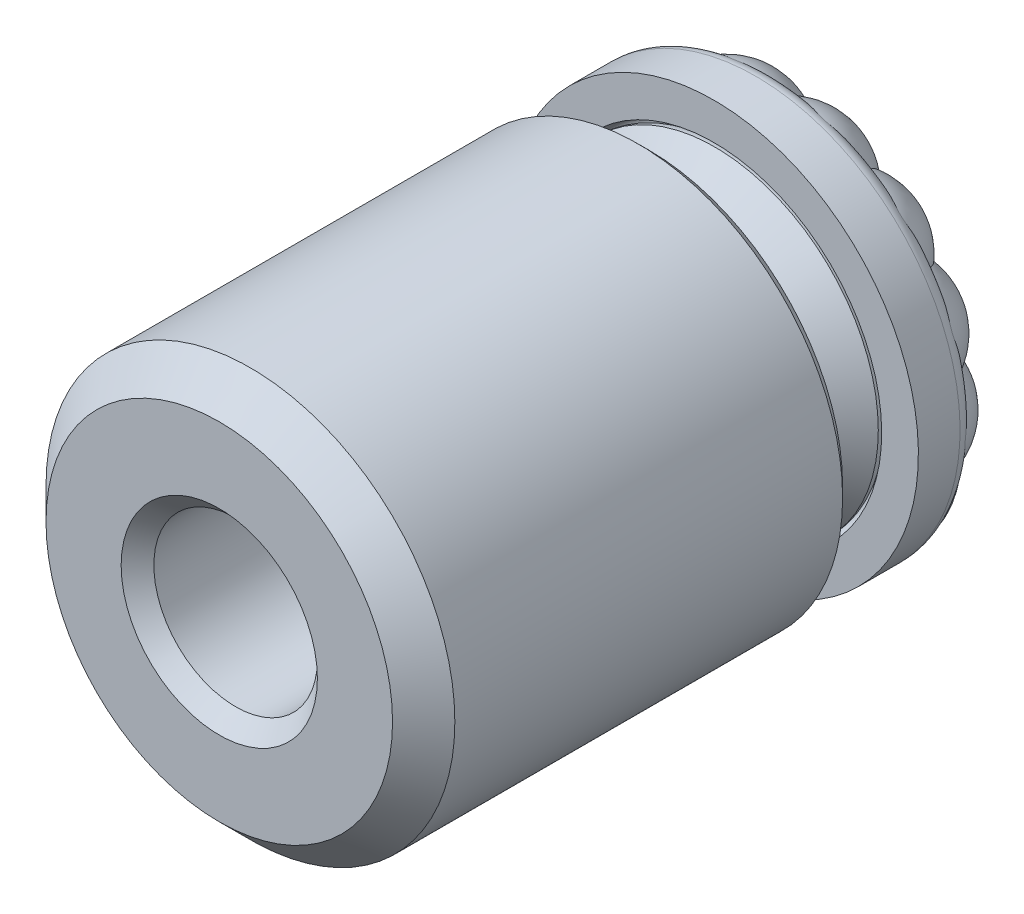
ISO-10303-21;
HEADER;
FILE_DESCRIPTION(('STEP AP214'),'2;1');
FILE_NAME('part.step','',(''),(''),'','','');
FILE_SCHEMA(('AUTOMOTIVE_DESIGN { 1 0 10303 214 1 1 1 1 }'));
ENDSEC;
DATA;
#1=APPLICATION_CONTEXT('core data for automotive mechanical design processes');
#2=APPLICATION_PROTOCOL_DEFINITION('international standard','automotive_design',2000,#1);
#3=PRODUCT_CONTEXT('',#1,'mechanical');
#4=PRODUCT('Part','Part','',(#3));
#5=PRODUCT_RELATED_PRODUCT_CATEGORY('part','',(#4));
#6=PRODUCT_DEFINITION_FORMATION('','',#4);
#7=PRODUCT_DEFINITION_CONTEXT('part definition',#1,'design');
#8=PRODUCT_DEFINITION('design','',#6,#7);
#9=PRODUCT_DEFINITION_SHAPE('','',#8);
#10=(LENGTH_UNIT() NAMED_UNIT(*) SI_UNIT(.MILLI.,.METRE.));
#11=(NAMED_UNIT(*) PLANE_ANGLE_UNIT() SI_UNIT($,.RADIAN.));
#12=(NAMED_UNIT(*) SI_UNIT($,.STERADIAN.) SOLID_ANGLE_UNIT());
#13=UNCERTAINTY_MEASURE_WITH_UNIT(LENGTH_MEASURE(1.E-05),#10,'distance_accuracy_value','');
#14=(GEOMETRIC_REPRESENTATION_CONTEXT(3) GLOBAL_UNCERTAINTY_ASSIGNED_CONTEXT((#13)) GLOBAL_UNIT_ASSIGNED_CONTEXT((#10,
#11,#12)) REPRESENTATION_CONTEXT('',''));
#15=CARTESIAN_POINT('',(0.,0.,0.));
#16=DIRECTION('',(0.,0.,1.));
#17=DIRECTION('',(1.,0.,0.));
#18=AXIS2_PLACEMENT_3D('',#15,#16,#17);
#19=CARTESIAN_POINT('',(0.,0.,4.635));
#20=DIRECTION('',(0.,0.,1.));
#21=DIRECTION('',(1.,0.,0.));
#22=AXIS2_PLACEMENT_3D('',#19,#20,#21);
#23=PLANE('',#22);
#24=CARTESIAN_POINT('',(0.,0.,4.635));
#25=DIRECTION('',(0.,0.,1.));
#26=DIRECTION('',(1.,0.,0.));
#27=AXIS2_PLACEMENT_3D('',#24,#25,#26);
#28=CIRCLE('',#27,3.5687);
#29=CARTESIAN_POINT('',(3.5687,0.,4.635));
#30=VERTEX_POINT('',#29);
#31=EDGE_CURVE('E1379',#30,#30,#28,.F.);
#32=ORIENTED_EDGE('',*,*,#31,.T.);
#33=EDGE_LOOP('',(#32));
#34=FACE_BOUND('',#33,.T.);
#35=CARTESIAN_POINT('',(0.,0.,4.635));
#36=DIRECTION('',(0.,0.,1.));
#37=DIRECTION('',(1.,0.,0.));
#38=AXIS2_PLACEMENT_3D('',#35,#36,#37);
#39=CIRCLE('',#38,3.2222586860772);
#40=CARTESIAN_POINT('',(0.957148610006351,3.07681939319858,4.635));
#41=VERTEX_POINT('',#40);
#42=EDGE_CURVE('E9',#41,#41,#39,.F.);
#43=ORIENTED_EDGE('',*,*,#42,.F.);
#44=EDGE_LOOP('',(#43));
#45=FACE_BOUND('',#44,.T.);
#46=ADVANCED_FACE('F14',(#34,#45),#23,.F.);
#47=CARTESIAN_POINT('',(0.,0.,14.5));
#48=DIRECTION('',(0.,0.,-1.));
#49=DIRECTION('',(-1.,0.,0.));
#50=AXIS2_PLACEMENT_3D('',#47,#48,#49);
#51=CYLINDRICAL_SURFACE('',#50,5.);
#52=CARTESIAN_POINT('',(0.,0.,13.738));
#53=DIRECTION('',(0.,0.,-1.));
#54=DIRECTION('',(-1.,0.,0.));
#55=AXIS2_PLACEMENT_3D('',#52,#53,#54);
#56=CIRCLE('',#55,5.);
#57=CARTESIAN_POINT('',(-5.,0.,13.738));
#58=VERTEX_POINT('',#57);
#59=EDGE_CURVE('E1384',#58,#58,#56,.T.);
#60=ORIENTED_EDGE('',*,*,#59,.T.);
#61=EDGE_LOOP('',(#60));
#62=FACE_BOUND('',#61,.T.);
#63=CARTESIAN_POINT('',(0.,0.,4.254));
#64=DIRECTION('',(0.,0.,-1.));
#65=DIRECTION('',(-1.,0.,0.));
#66=AXIS2_PLACEMENT_3D('',#63,#64,#65);
#67=CIRCLE('',#66,5.);
#68=CARTESIAN_POINT('',(-5.,0.,4.254));
#69=VERTEX_POINT('',#68);
#70=EDGE_CURVE('E1368',#69,#69,#67,.F.);
#71=ORIENTED_EDGE('',*,*,#70,.T.);
#72=EDGE_LOOP('',(#71));
#73=FACE_BOUND('',#72,.T.);
#74=ADVANCED_FACE('F1340',(#62,#73),#51,.T.);
#75=CARTESIAN_POINT('',(0.,0.,14.5));
#76=DIRECTION('',(0.,0.,-1.));
#77=DIRECTION('',(-1.,0.,0.));
#78=AXIS2_PLACEMENT_3D('',#75,#76,#77);
#79=PLANE('',#78);
#80=CARTESIAN_POINT('',(0.,0.,14.5));
#81=DIRECTION('',(0.,0.,-1.));
#82=DIRECTION('',(-1.,0.,0.));
#83=AXIS2_PLACEMENT_3D('',#80,#81,#82);
#84=CIRCLE('',#83,4.238);
#85=CARTESIAN_POINT('',(-4.238,0.,14.5));
#86=VERTEX_POINT('',#85);
#87=EDGE_CURVE('E23',#86,#86,#84,.F.);
#88=ORIENTED_EDGE('',*,*,#87,.T.);
#89=EDGE_LOOP('',(#88));
#90=FACE_BOUND('',#89,.T.);
#91=CARTESIAN_POINT('',(0.,0.,14.5));
#92=DIRECTION('',(0.,0.,1.));
#93=DIRECTION('',(1.,0.,0.));
#94=AXIS2_PLACEMENT_3D('',#91,#92,#93);
#95=CIRCLE('',#94,2.4);
#96=CARTESIAN_POINT('',(2.4,0.,14.5));
#97=VERTEX_POINT('',#96);
#98=EDGE_CURVE('E1395',#97,#97,#95,.T.);
#99=ORIENTED_EDGE('',*,*,#98,.F.);
#100=EDGE_LOOP('',(#99));
#101=FACE_BOUND('',#100,.T.);
#102=ADVANCED_FACE('F1348',(#90,#101),#79,.F.);
#103=CARTESIAN_POINT('',(0.,0.,4.));
#104=DIRECTION('',(0.,0.,-1.));
#105=DIRECTION('',(-1.,0.,0.));
#106=AXIS2_PLACEMENT_3D('',#103,#104,#105);
#107=PLANE('',#106);
#108=CARTESIAN_POINT('',(0.,0.,4.));
#109=DIRECTION('',(0.,0.,-1.));
#110=DIRECTION('',(-1.,0.,0.));
#111=AXIS2_PLACEMENT_3D('',#108,#109,#110);
#112=CIRCLE('',#111,3.8227);
#113=CARTESIAN_POINT('',(-3.8227,0.,4.));
#114=VERTEX_POINT('',#113);
#115=EDGE_CURVE('E1373',#114,#114,#112,.F.);
#116=ORIENTED_EDGE('',*,*,#115,.T.);
#117=EDGE_LOOP('',(#116));
#118=FACE_BOUND('',#117,.T.);
#119=CARTESIAN_POINT('',(0.,0.,4.));
#120=DIRECTION('',(0.,0.,-1.));
#121=DIRECTION('',(-1.,0.,0.));
#122=AXIS2_PLACEMENT_3D('',#119,#120,#121);
#123=CIRCLE('',#122,4.746);
#124=CARTESIAN_POINT('',(-4.746,0.,4.));
#125=VERTEX_POINT('',#124);
#126=EDGE_CURVE('E1371',#125,#125,#123,.T.);
#127=ORIENTED_EDGE('',*,*,#126,.T.);
#128=EDGE_LOOP('',(#127));
#129=FACE_BOUND('',#128,.T.);
#130=ADVANCED_FACE('F1346',(#118,#129),#107,.T.);
#131=CARTESIAN_POINT('',(0.,0.,7.302));
#132=DIRECTION('',(0.,0.,-1.));
#133=DIRECTION('',(-1.,0.,0.));
#134=AXIS2_PLACEMENT_3D('',#131,#132,#133);
#135=CYLINDRICAL_SURFACE('',#134,3.5687);
#136=CARTESIAN_POINT('',(0.,0.,4.254));
#137=DIRECTION('',(0.,0.,-1.));
#138=DIRECTION('',(-1.,0.,0.));
#139=AXIS2_PLACEMENT_3D('',#136,#137,#138);
#140=CIRCLE('',#139,3.5687);
#141=CARTESIAN_POINT('',(-3.5687,0.,4.254));
#142=VERTEX_POINT('',#141);
#143=EDGE_CURVE('E1374',#142,#142,#140,.T.);
#144=ORIENTED_EDGE('',*,*,#143,.T.);
#145=EDGE_LOOP('',(#144));
#146=FACE_BOUND('',#145,.T.);
#147=ORIENTED_EDGE('',*,*,#31,.F.);
#148=EDGE_LOOP('',(#147));
#149=FACE_BOUND('',#148,.T.);
#150=ADVANCED_FACE('F1342',(#146,#149),#135,.F.);
#151=CARTESIAN_POINT('',(0.,0.,4.254));
#152=DIRECTION('',(0.,0.,-1.));
#153=DIRECTION('',(-1.,0.,0.));
#154=AXIS2_PLACEMENT_3D('',#151,#152,#153);
#155=CONICAL_SURFACE('',#154,3.5687,0.785398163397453);
#156=ORIENTED_EDGE('',*,*,#115,.F.);
#157=EDGE_LOOP('',(#156));
#158=FACE_BOUND('',#157,.T.);
#159=ORIENTED_EDGE('',*,*,#143,.F.);
#160=EDGE_LOOP('',(#159));
#161=FACE_BOUND('',#160,.T.);
#162=ADVANCED_FACE('F1345',(#158,#161),#155,.F.);
#163=CARTESIAN_POINT('',(0.,0.,4.));
#164=DIRECTION('',(0.,0.,1.));
#165=DIRECTION('',(1.,0.,0.));
#166=AXIS2_PLACEMENT_3D('',#163,#164,#165);
#167=CONICAL_SURFACE('',#166,4.746,0.785398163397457);
#168=ORIENTED_EDGE('',*,*,#70,.F.);
#169=EDGE_LOOP('',(#168));
#170=FACE_BOUND('',#169,.T.);
#171=ORIENTED_EDGE('',*,*,#126,.F.);
#172=EDGE_LOOP('',(#171));
#173=FACE_BOUND('',#172,.T.);
#174=ADVANCED_FACE('F906',(#170,#173),#167,.T.);
#175=CARTESIAN_POINT('',(0.,0.,13.738));
#176=DIRECTION('',(0.,0.,-1.));
#177=DIRECTION('',(-1.,0.,0.));
#178=AXIS2_PLACEMENT_3D('',#175,#176,#177);
#179=CONICAL_SURFACE('',#178,5.,0.78539816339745);
#180=ORIENTED_EDGE('',*,*,#87,.F.);
#181=EDGE_LOOP('',(#180));
#182=FACE_BOUND('',#181,.T.);
#183=ORIENTED_EDGE('',*,*,#59,.F.);
#184=EDGE_LOOP('',(#183));
#185=FACE_BOUND('',#184,.T.);
#186=ADVANCED_FACE('F897',(#182,#185),#179,.T.);
#187=CARTESIAN_POINT('',(1.37204050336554,4.41051764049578,1.0000000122));
#188=DIRECTION('',(0.,0.,1.));
#189=DIRECTION('',(0.954864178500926,-0.297042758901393,0.));
#190=AXIS2_PLACEMENT_3D('',#187,#188,#189);
#191=PLANE('',#190);
#192=CARTESIAN_POINT('',(3.40233747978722,-0.263165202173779,1.0000000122));
#193=DIRECTION('',(0.,0.,1.));
#194=DIRECTION('',(-0.0771180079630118,-0.997021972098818,0.));
#195=AXIS2_PLACEMENT_3D('',#192,#193,#194);
#196=CIRCLE('',#195,1.47478812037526);
#197=CARTESIAN_POINT('',(1.93754552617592,-0.0917460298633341,1.0000000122));
#198=VERTEX_POINT('',#197);
#199=CARTESIAN_POINT('',(2.04036164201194,0.302539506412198,1.0000000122));
#200=VERTEX_POINT('',#199);
#201=EDGE_CURVE('E698',#198,#200,#196,.F.);
#202=ORIENTED_EDGE('',*,*,#201,.F.);
#203=CARTESIAN_POINT('',(0.,0.,1.0000000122));
#204=DIRECTION('',(0.,0.,1.));
#205=DIRECTION('',(0.954864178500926,-0.297042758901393,0.));
#206=AXIS2_PLACEMENT_3D('',#203,#204,#205);
#207=CIRCLE('',#206,1.93971647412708);
#208=CARTESIAN_POINT('',(1.82755754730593,0.65002570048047,1.0000000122));
#209=VERTEX_POINT('',#208);
#210=EDGE_CURVE('E1483',#198,#209,#207,.T.);
#211=ORIENTED_EDGE('',*,*,#210,.T.);
#212=CARTESIAN_POINT('',(3.17958324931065,1.23911525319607,1.0000000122));
#213=DIRECTION('',(0.,0.,1.));
#214=DIRECTION('',(0.363110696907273,-0.931746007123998,0.));
#215=AXIS2_PLACEMENT_3D('',#212,#213,#214);
#216=CIRCLE('',#215,1.47478812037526);
#217=EDGE_CURVE('E709',#200,#209,#216,.F.);
#218=ORIENTED_EDGE('',*,*,#217,.F.);
#219=EDGE_LOOP('',(#202,#211,#218));
#220=FACE_BOUND('',#219,.T.);
#221=ADVANCED_FACE('F871',(#220),#191,.F.);
#222=CARTESIAN_POINT('',(2.95121704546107,-1.71332256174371,1.0000000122));
#223=DIRECTION('',(0.,0.,1.));
#224=DIRECTION('',(-0.502072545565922,-0.86482550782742,0.));
#225=AXIS2_PLACEMENT_3D('',#222,#223,#224);
#226=CIRCLE('',#225,1.47478812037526);
#227=CARTESIAN_POINT('',(1.70586108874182,-0.923329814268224,1.0000000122));
#228=VERTEX_POINT('',#227);
#229=CARTESIAN_POINT('',(1.96956929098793,-0.61270106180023,1.0000000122));
#230=VERTEX_POINT('',#229);
#231=EDGE_CURVE('E657',#228,#230,#226,.F.);
#232=ORIENTED_EDGE('',*,*,#231,.F.);
#233=CARTESIAN_POINT('',(1.92860803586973,-0.207294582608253,1.0000000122));
#234=VERTEX_POINT('',#233);
#235=EDGE_CURVE('E1479',#228,#234,#207,.T.);
#236=ORIENTED_EDGE('',*,*,#235,.T.);
#237=EDGE_CURVE('E668',#230,#234,#196,.F.);
#238=ORIENTED_EDGE('',*,*,#237,.F.);
#239=EDGE_LOOP('',(#232,#236,#238));
#240=FACE_BOUND('',#239,.T.);
#241=ADVANCED_FACE('F896',(#240),#191,.F.);
#242=CARTESIAN_POINT('',(1.91557188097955,-2.82413537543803,1.0000000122));
#243=DIRECTION('',(0.,0.,1.));
#244=DIRECTION('',(-0.827585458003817,-0.561339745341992,0.));
#245=AXIS2_PLACEMENT_3D('',#242,#243,#244);
#246=CIRCLE('',#245,1.47478812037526);
#247=CARTESIAN_POINT('',(1.13630994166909,-1.57203680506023,1.0000000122));
#248=VERTEX_POINT('',#247);
#249=CARTESIAN_POINT('',(1.50867958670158,-1.40658867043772,1.0000000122));
#250=VERTEX_POINT('',#249);
#251=EDGE_CURVE('E616',#248,#250,#246,.F.);
#252=ORIENTED_EDGE('',*,*,#251,.F.);
#253=CARTESIAN_POINT('',(1.64767405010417,-1.02355763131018,1.0000000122));
#254=VERTEX_POINT('',#253);
#255=EDGE_CURVE('E1474',#248,#254,#207,.T.);
#256=ORIENTED_EDGE('',*,*,#255,.T.);
#257=EDGE_CURVE('E627',#250,#254,#226,.F.);
#258=ORIENTED_EDGE('',*,*,#257,.F.);
#259=EDGE_LOOP('',(#252,#256,#258));
#260=FACE_BOUND('',#259,.T.);
#261=ADVANCED_FACE('F904',(#260),#191,.F.);
#262=CARTESIAN_POINT('',(0.500524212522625,-3.37559354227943,1.0000000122));
#263=DIRECTION('',(0.,0.,1.));
#264=DIRECTION('',(-0.989184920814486,-0.146673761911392,0.));
#265=AXIS2_PLACEMENT_3D('',#262,#263,#264);
#266=CIRCLE('',#265,1.47478812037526);
#267=CARTESIAN_POINT('',(0.341698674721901,-1.90938262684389,1.0000000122));
#268=VERTEX_POINT('',#267);
#269=CARTESIAN_POINT('',(0.748977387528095,-1.92188414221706,1.0000000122));
#270=VERTEX_POINT('',#269);
#271=EDGE_CURVE('E575',#268,#270,#266,.F.);
#272=ORIENTED_EDGE('',*,*,#271,.F.);
#273=CARTESIAN_POINT('',(1.04039801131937,-1.63709253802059,1.0000000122));
#274=VERTEX_POINT('',#273);
#275=EDGE_CURVE('E1469',#268,#274,#207,.T.);
#276=ORIENTED_EDGE('',*,*,#275,.T.);
#277=EDGE_CURVE('E586',#270,#274,#246,.F.);
#278=ORIENTED_EDGE('',*,*,#277,.F.);
#279=EDGE_LOOP('',(#272,#276,#278));
#280=FACE_BOUND('',#279,.T.);
#281=ADVANCED_FACE('F1550',(#280),#191,.F.);
#282=CARTESIAN_POINT('',(-1.01365841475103,-3.2584740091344,1.0000000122));
#283=DIRECTION('',(0.,0.,1.));
#284=DIRECTION('',(-0.954864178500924,0.2970427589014,0.));
#285=AXIS2_PLACEMENT_3D('',#282,#283,#284);
#286=CIRCLE('',#285,1.47478812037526);
#287=CARTESIAN_POINT('',(-0.520590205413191,-1.86855180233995,1.0000000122));
#288=VERTEX_POINT('',#287);
#289=CARTESIAN_POINT('',(-0.159068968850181,-2.05652688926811,1.0000000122));
#290=VERTEX_POINT('',#289);
#291=EDGE_CURVE('E534',#288,#290,#286,.F.);
#292=ORIENTED_EDGE('',*,*,#291,.F.);
#293=CARTESIAN_POINT('',(0.227058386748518,-1.92638118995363,1.0000000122));
#294=VERTEX_POINT('',#293);
#295=EDGE_CURVE('E1464',#288,#294,#207,.T.);
#296=ORIENTED_EDGE('',*,*,#295,.T.);
#297=EDGE_CURVE('E545',#290,#294,#266,.F.);
#298=ORIENTED_EDGE('',*,*,#297,.F.);
#299=EDGE_LOOP('',(#292,#296,#298));
#300=FACE_BOUND('',#299,.T.);
#301=ADVANCED_FACE('F1588',(#300),#191,.F.);
#302=CARTESIAN_POINT('',(-2.32707356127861,-2.49597373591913,1.0000000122));
#303=DIRECTION('',(0.,0.,1.));
#304=DIRECTION('',(-0.731420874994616,0.681926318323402,0.));
#305=AXIS2_PLACEMENT_3D('',#302,#303,#304);
#306=CIRCLE('',#305,1.47478812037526);
#307=CARTESIAN_POINT('',(-1.27976981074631,-1.45763137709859,1.0000000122));
#308=VERTEX_POINT('',#307);
#309=CARTESIAN_POINT('',(-1.0356097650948,-1.78384926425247,1.0000000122));
#310=VERTEX_POINT('',#309);
#311=EDGE_CURVE('E493',#308,#310,#306,.F.);
#312=ORIENTED_EDGE('',*,*,#311,.F.);
#313=CARTESIAN_POINT('',(-0.631252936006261,-1.83412642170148,1.0000000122));
#314=VERTEX_POINT('',#313);
#315=EDGE_CURVE('E1459',#308,#314,#207,.T.);
#316=ORIENTED_EDGE('',*,*,#315,.T.);
#317=EDGE_CURVE('E504',#310,#314,#286,.F.);
#318=ORIENTED_EDGE('',*,*,#317,.F.);
#319=EDGE_LOOP('',(#312,#316,#318));
#320=FACE_BOUND('',#319,.T.);
#321=ADVANCED_FACE('F1521',(#320),#191,.F.);
#322=CARTESIAN_POINT('',(-3.17958324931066,-1.23911525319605,1.0000000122));
#323=DIRECTION('',(0.,0.,1.));
#324=DIRECTION('',(-0.363110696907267,0.931746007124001,0.));
#325=AXIS2_PLACEMENT_3D('',#322,#323,#324);
#326=CIRCLE('',#325,1.47478812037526);
#327=CARTESIAN_POINT('',(-1.78547530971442,-0.758009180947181,1.0000000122));
#328=VERTEX_POINT('',#327);
#329=CARTESIAN_POINT('',(-1.70703534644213,-1.15785841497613,1.0000000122));
#330=VERTEX_POINT('',#329);
#331=EDGE_CURVE('E452',#328,#330,#326,.F.);
#332=ORIENTED_EDGE('',*,*,#331,.F.);
#333=CARTESIAN_POINT('',(-1.36453687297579,-1.37860042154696,1.0000000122));
#334=VERTEX_POINT('',#333);
#335=EDGE_CURVE('E1454',#328,#334,#207,.T.);
#336=ORIENTED_EDGE('',*,*,#335,.T.);
#337=EDGE_CURVE('E463',#330,#334,#306,.F.);
#338=ORIENTED_EDGE('',*,*,#337,.F.);
#339=EDGE_LOOP('',(#332,#336,#338));
#340=FACE_BOUND('',#339,.T.);
#341=ADVANCED_FACE('F1516',(#340),#191,.F.);
#342=CARTESIAN_POINT('',(-3.40233747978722,0.2631652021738,1.0000000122));
#343=DIRECTION('',(0.,0.,1.));
#344=DIRECTION('',(0.0771180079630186,0.997021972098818,0.));
#345=AXIS2_PLACEMENT_3D('',#342,#343,#344);
#346=CIRCLE('',#345,1.47478812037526);
#347=CARTESIAN_POINT('',(-1.93754552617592,0.0917460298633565,1.0000000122));
#348=VERTEX_POINT('',#347);
#349=CARTESIAN_POINT('',(-2.04036164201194,-0.302539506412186,1.0000000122));
#350=VERTEX_POINT('',#349);
#351=EDGE_CURVE('E411',#348,#350,#346,.F.);
#352=ORIENTED_EDGE('',*,*,#351,.F.);
#353=CARTESIAN_POINT('',(-1.82755754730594,-0.650025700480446,1.0000000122));
#354=VERTEX_POINT('',#353);
#355=EDGE_CURVE('E1449',#348,#354,#207,.T.);
#356=ORIENTED_EDGE('',*,*,#355,.T.);
#357=EDGE_CURVE('E422',#350,#354,#326,.F.);
#358=ORIENTED_EDGE('',*,*,#357,.F.);
#359=EDGE_LOOP('',(#352,#356,#358));
#360=FACE_BOUND('',#359,.T.);
#361=ADVANCED_FACE('F1512',(#360),#191,.F.);
#362=CARTESIAN_POINT('',(-2.95121704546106,1.71332256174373,1.0000000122));
#363=DIRECTION('',(0.,0.,1.));
#364=DIRECTION('',(0.502072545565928,0.864825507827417,0.));
#365=AXIS2_PLACEMENT_3D('',#362,#363,#364);
#366=CIRCLE('',#365,1.47478812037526);
#367=CARTESIAN_POINT('',(-1.70586108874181,0.923329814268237,1.0000000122));
#368=VERTEX_POINT('',#367);
#369=CARTESIAN_POINT('',(-1.96956929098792,0.612701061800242,1.0000000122));
#370=VERTEX_POINT('',#369);
#371=EDGE_CURVE('E368',#368,#370,#366,.F.);
#372=ORIENTED_EDGE('',*,*,#371,.F.);
#373=CARTESIAN_POINT('',(-1.92860803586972,0.207294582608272,1.0000000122));
#374=VERTEX_POINT('',#373);
#375=EDGE_CURVE('E1445',#368,#374,#207,.T.);
#376=ORIENTED_EDGE('',*,*,#375,.T.);
#377=EDGE_CURVE('E379',#370,#374,#346,.F.);
#378=ORIENTED_EDGE('',*,*,#377,.F.);
#379=EDGE_LOOP('',(#372,#376,#378));
#380=FACE_BOUND('',#379,.T.);
#381=ADVANCED_FACE('F1505',(#380),#191,.F.);
#382=CARTESIAN_POINT('',(-1.91557188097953,2.82413537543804,1.0000000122));
#383=DIRECTION('',(0.,0.,1.));
#384=DIRECTION('',(0.827585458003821,0.561339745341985,0.));
#385=AXIS2_PLACEMENT_3D('',#382,#383,#384);
#386=CIRCLE('',#385,1.47478812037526);
#387=CARTESIAN_POINT('',(-1.13630994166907,1.57203680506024,1.0000000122));
#388=VERTEX_POINT('',#387);
#389=CARTESIAN_POINT('',(-1.50867958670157,1.40658867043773,1.0000000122));
#390=VERTEX_POINT('',#389);
#391=EDGE_CURVE('E310',#388,#390,#386,.F.);
#392=ORIENTED_EDGE('',*,*,#391,.F.);
#393=CARTESIAN_POINT('',(-1.64767405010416,1.02355763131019,1.0000000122));
#394=VERTEX_POINT('',#393);
#395=EDGE_CURVE('E31',#388,#394,#207,.T.);
#396=ORIENTED_EDGE('',*,*,#395,.T.);
#397=EDGE_CURVE('E360',#390,#394,#366,.F.);
#398=ORIENTED_EDGE('',*,*,#397,.F.);
#399=EDGE_LOOP('',(#392,#396,#398));
#400=FACE_BOUND('',#399,.T.);
#401=ADVANCED_FACE('F1506',(#400),#191,.F.);
#402=CARTESIAN_POINT('',(-0.5005242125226,3.37559354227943,1.0000000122));
#403=DIRECTION('',(0.,0.,1.));
#404=DIRECTION('',(0.989184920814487,0.146673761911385,0.));
#405=AXIS2_PLACEMENT_3D('',#402,#403,#404);
#406=CIRCLE('',#405,1.47478812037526);
#407=CARTESIAN_POINT('',(-0.341698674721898,1.90938262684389,1.0000000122));
#408=VERTEX_POINT('',#407);
#409=CARTESIAN_POINT('',(-0.748977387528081,1.92188414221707,1.0000000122));
#410=VERTEX_POINT('',#409);
#411=EDGE_CURVE('E302',#408,#410,#406,.F.);
#412=ORIENTED_EDGE('',*,*,#411,.F.);
#413=CARTESIAN_POINT('',(-1.04039801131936,1.63709253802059,1.0000000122));
#414=VERTEX_POINT('',#413);
#415=EDGE_CURVE('E287',#408,#414,#207,.T.);
#416=ORIENTED_EDGE('',*,*,#415,.T.);
#417=EDGE_CURVE('E300',#410,#414,#386,.F.);
#418=ORIENTED_EDGE('',*,*,#417,.F.);
#419=EDGE_LOOP('',(#412,#416,#418));
#420=FACE_BOUND('',#419,.T.);
#421=ADVANCED_FACE('F299',(#420),#191,.F.);
#422=CARTESIAN_POINT('',(1.013658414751,3.25847400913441,1.0000000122));
#423=DIRECTION('',(0.,0.,1.));
#424=DIRECTION('',(0.954864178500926,-0.297042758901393,0.));
#425=AXIS2_PLACEMENT_3D('',#422,#423,#424);
#426=CIRCLE('',#425,1.47478812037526);
#427=CARTESIAN_POINT('',(0.52059020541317,1.86855180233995,1.0000000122));
#428=VERTEX_POINT('',#427);
#429=CARTESIAN_POINT('',(0.159068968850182,2.0565268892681,1.0000000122));
#430=VERTEX_POINT('',#429);
#431=EDGE_CURVE('E938',#428,#430,#426,.F.);
#432=ORIENTED_EDGE('',*,*,#431,.F.);
#433=CARTESIAN_POINT('',(-0.227058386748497,1.92638118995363,1.0000000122));
#434=VERTEX_POINT('',#433);
#435=EDGE_CURVE('E1434',#428,#434,#207,.T.);
#436=ORIENTED_EDGE('',*,*,#435,.T.);
#437=EDGE_CURVE('E748',#430,#434,#406,.F.);
#438=ORIENTED_EDGE('',*,*,#437,.F.);
#439=EDGE_LOOP('',(#432,#436,#438));
#440=FACE_BOUND('',#439,.T.);
#441=ADVANCED_FACE('F917',(#440),#191,.F.);
#442=CARTESIAN_POINT('',(2.3270735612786,2.49597373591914,1.0000000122));
#443=DIRECTION('',(0.,0.,1.));
#444=DIRECTION('',(0.731420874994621,-0.681926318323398,0.));
#445=AXIS2_PLACEMENT_3D('',#442,#443,#444);
#446=CIRCLE('',#445,1.47478812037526);
#447=CARTESIAN_POINT('',(1.2797698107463,1.45763137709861,1.0000000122));
#448=VERTEX_POINT('',#447);
#449=CARTESIAN_POINT('',(1.03560976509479,1.78384926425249,1.0000000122));
#450=VERTEX_POINT('',#449);
#451=EDGE_CURVE('E822',#448,#450,#446,.F.);
#452=ORIENTED_EDGE('',*,*,#451,.F.);
#453=CARTESIAN_POINT('',(0.63125293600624,1.83412642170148,1.0000000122));
#454=VERTEX_POINT('',#453);
#455=EDGE_CURVE('E925',#448,#454,#207,.T.);
#456=ORIENTED_EDGE('',*,*,#455,.T.);
#457=EDGE_CURVE('E833',#450,#454,#426,.F.);
#458=ORIENTED_EDGE('',*,*,#457,.F.);
#459=EDGE_LOOP('',(#452,#456,#458));
#460=FACE_BOUND('',#459,.T.);
#461=ADVANCED_FACE('F911',(#460),#191,.F.);
#462=CARTESIAN_POINT('',(0.,0.,2.3812500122));
#463=DIRECTION('',(0.,0.,1.));
#464=DIRECTION('',(0.297042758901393,0.954864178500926,0.));
#465=AXIS2_PLACEMENT_3D('',#462,#463,#464);
#466=SPHERICAL_SURFACE('',#465,2.38125);
#467=CARTESIAN_POINT('',(1.04039801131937,-1.63709253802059,1.0000000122));
#468=CARTESIAN_POINT('',(1.04435425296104,-1.63432419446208,0.99969999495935));
#469=CARTESIAN_POINT('',(1.04831748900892,-1.63156179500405,0.999437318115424));
#470=CARTESIAN_POINT('',(1.05625285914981,-1.62605232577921,0.998987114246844));
#471=CARTESIAN_POINT('',(1.06022498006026,-1.62330524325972,0.998799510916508));
#472=CARTESIAN_POINT('',(1.06817838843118,-1.6178260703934,0.998499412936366));
#473=CARTESIAN_POINT('',(1.07215966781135,-1.61509397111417,0.998386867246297));
#474=CARTESIAN_POINT('',(1.08013169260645,-1.60964447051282,0.998236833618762));
#475=CARTESIAN_POINT('',(1.08412243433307,-1.6069270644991,0.998199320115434));
#476=CARTESIAN_POINT('',(1.09211371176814,-1.6015066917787,0.998199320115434));
#477=CARTESIAN_POINT('',(1.0961142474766,-1.59880372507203,0.998236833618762));
#478=CARTESIAN_POINT('',(1.10412546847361,-1.59341201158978,0.998386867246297));
#479=CARTESIAN_POINT('',(1.1081361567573,-1.590723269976,0.998499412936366));
#480=CARTESIAN_POINT('',(1.11616806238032,-1.5853598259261,0.998799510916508));
#481=CARTESIAN_POINT('',(1.12018928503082,-1.58268513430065,0.998987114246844));
#482=CARTESIAN_POINT('',(1.12824266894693,-1.57734965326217,0.999437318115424));
#483=CARTESIAN_POINT('',(1.1322748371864,-1.57468888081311,0.99969999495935));
#484=CARTESIAN_POINT('',(1.13630994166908,-1.57203680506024,1.0000000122));
#485=B_SPLINE_CURVE_WITH_KNOTS('',3,(#467,#468,#469,#470,#471,#472,#473,#474,#475,#476,#477,
#478,#479,#480,#481,#482,#483,#484),.UNSPECIFIED.,.F.,.F.,(4,2,2,2,2,2,2,2,4),(0.,
0.0145136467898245,0.029012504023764,0.0435014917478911,0.0579855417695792,0.0724695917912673,
0.0869585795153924,0.101457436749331,0.115971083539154),.UNSPECIFIED.);
#486=EDGE_CURVE('E581',#274,#248,#485,.T.);
#487=ORIENTED_EDGE('',*,*,#486,.F.);
#488=ORIENTED_EDGE('',*,*,#275,.F.);
#489=CARTESIAN_POINT('',(0.227058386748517,-1.92638118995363,1.0000000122));
#490=CARTESIAN_POINT('',(0.231823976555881,-1.9256035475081,0.999699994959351));
#491=CARTESIAN_POINT('',(0.236593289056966,-1.92483429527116,0.999437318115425));
#492=CARTESIAN_POINT('',(0.246133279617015,-1.92331346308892,0.998987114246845));
#493=CARTESIAN_POINT('',(0.250903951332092,-1.92256186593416,0.998799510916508));
#494=CARTESIAN_POINT('',(0.260447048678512,-1.92107615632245,0.998499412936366));
#495=CARTESIAN_POINT('',(0.265219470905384,-1.92034203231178,0.998386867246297));
#496=CARTESIAN_POINT('',(0.274766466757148,-1.91889113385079,0.998236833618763));
#497=CARTESIAN_POINT('',(0.279541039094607,-1.91817435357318,0.998199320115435));
#498=CARTESIAN_POINT('',(0.289092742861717,-1.91675805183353,0.998199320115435));
#499=CARTESIAN_POINT('',(0.293869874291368,-1.91605853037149,0.998236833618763));
#500=CARTESIAN_POINT('',(0.303427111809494,-1.91467670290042,0.998386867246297));
#501=CARTESIAN_POINT('',(0.308207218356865,-1.91399440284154,0.998499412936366));
#502=CARTESIAN_POINT('',(0.317770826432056,-1.91264701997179,0.998799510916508));
#503=CARTESIAN_POINT('',(0.322554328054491,-1.91198194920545,0.998987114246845));
#504=CARTESIAN_POINT('',(0.332125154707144,-1.91066907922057,0.999437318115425));
#505=CARTESIAN_POINT('',(0.336912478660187,-1.91002129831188,0.999699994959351));
#506=CARTESIAN_POINT('',(0.341698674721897,-1.9093826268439,1.0000000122));
#507=B_SPLINE_CURVE_WITH_KNOTS('',3,(#489,#490,#491,#492,#493,#494,#495,#496,#497,#498,#499,
#500,#501,#502,#503,#504,#505,#506),.UNSPECIFIED.,.F.,.F.,(4,2,2,2,2,2,2,2,4),(0.,
0.0145136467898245,0.0290125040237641,0.0435014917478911,0.0579855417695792,0.0724695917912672,
0.0869585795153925,0.101457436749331,0.115971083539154),.UNSPECIFIED.);
#508=EDGE_CURVE('E540',#294,#268,#507,.T.);
#509=ORIENTED_EDGE('',*,*,#508,.F.);
#510=ORIENTED_EDGE('',*,*,#295,.F.);
#511=CARTESIAN_POINT('',(-0.631252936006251,-1.83412642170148,1.0000000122));
#512=CARTESIAN_POINT('',(-0.626621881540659,-1.83549350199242,0.999699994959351));
#513=CARTESIAN_POINT('',(-0.621991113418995,-1.83686975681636,0.999437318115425));
#514=CARTESIAN_POINT('',(-0.61273601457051,-1.83963878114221,0.998987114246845));
#515=CARTESIAN_POINT('',(-0.608111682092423,-1.8410315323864,0.998799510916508));
#516=CARTESIAN_POINT('',(-0.598869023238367,-1.84383354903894,0.998499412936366));
#517=CARTESIAN_POINT('',(-0.594250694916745,-1.84524280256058,0.998386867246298));
#518=CARTESIAN_POINT('',(-0.585019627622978,-1.84807787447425,0.998236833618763));
#519=CARTESIAN_POINT('',(-0.580406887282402,-1.84950368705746,0.998199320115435));
#520=CARTESIAN_POINT('',(-0.571186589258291,-1.85237197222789,0.998199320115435));
#521=CARTESIAN_POINT('',(-0.566579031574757,-1.85381444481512,0.998236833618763));
#522=CARTESIAN_POINT('',(-0.557368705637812,-1.85671619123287,0.998386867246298));
#523=CARTESIAN_POINT('',(-0.552765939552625,-1.8581754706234,0.998499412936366));
#524=CARTESIAN_POINT('',(-0.54356481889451,-1.86111101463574,0.998799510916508));
#525=CARTESIAN_POINT('',(-0.538966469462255,-1.86258729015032,0.998987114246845));
#526=CARTESIAN_POINT('',(-0.52977381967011,-1.86555706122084,0.999437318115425));
#527=CARTESIAN_POINT('',(-0.525179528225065,-1.86705057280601,0.999699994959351));
#528=CARTESIAN_POINT('',(-0.520590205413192,-1.86855180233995,1.0000000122));
#529=B_SPLINE_CURVE_WITH_KNOTS('',3,(#511,#512,#513,#514,#515,#516,#517,#518,#519,#520,#521,
#522,#523,#524,#525,#526,#527,#528),.UNSPECIFIED.,.F.,.F.,(4,2,2,2,2,2,2,2,4),(0.,
0.0145136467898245,0.029012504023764,0.0435014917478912,0.0579855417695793,0.0724695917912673,
0.0869585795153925,0.101457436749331,0.115971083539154),.UNSPECIFIED.);
#530=EDGE_CURVE('E499',#314,#288,#529,.T.);
#531=ORIENTED_EDGE('',*,*,#530,.F.);
#532=ORIENTED_EDGE('',*,*,#315,.F.);
#533=CARTESIAN_POINT('',(-1.36453687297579,-1.37860042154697,1.0000000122));
#534=CARTESIAN_POINT('',(-1.36095759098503,-1.38184145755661,0.999699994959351));
#535=CARTESIAN_POINT('',(-1.35738254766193,-1.3850906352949,0.999437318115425));
#536=CARTESIAN_POINT('',(-1.35024542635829,-1.39160107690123,0.998987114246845));
#537=CARTESIAN_POINT('',(-1.34668333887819,-1.3948623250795,0.998799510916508));
#538=CARTESIAN_POINT('',(-1.33957174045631,-1.40139709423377,0.998499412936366));
#539=CARTESIAN_POINT('',(-1.33602222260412,-1.40467060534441,0.998386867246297));
#540=CARTESIAN_POINT('',(-1.32893540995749,-1.41123012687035,0.998236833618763));
#541=CARTESIAN_POINT('',(-1.32539811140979,-1.41451613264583,0.998199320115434));
#542=CARTESIAN_POINT('',(-1.31833541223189,-1.42110090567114,0.998199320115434));
#543=CARTESIAN_POINT('',(-1.31481001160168,-1.42439967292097,0.998236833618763));
#544=CARTESIAN_POINT('',(-1.30777081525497,-1.43101026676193,0.998386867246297));
#545=CARTESIAN_POINT('',(-1.30425702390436,-1.43432209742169,0.998499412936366));
#546=CARTESIAN_POINT('',(-1.29724078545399,-1.44095914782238,0.998799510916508));
#547=CARTESIAN_POINT('',(-1.29373834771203,-1.4442843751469,0.998987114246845));
#548=CARTESIAN_POINT('',(-1.28674459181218,-1.45094858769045,0.999437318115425));
#549=CARTESIAN_POINT('',(-1.28325328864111,-1.45428758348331,0.999699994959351));
#550=CARTESIAN_POINT('',(-1.27976981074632,-1.4576313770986,1.0000000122));
#551=B_SPLINE_CURVE_WITH_KNOTS('',3,(#533,#534,#535,#536,#537,#538,#539,#540,#541,#542,#543,
#544,#545,#546,#547,#548,#549,#550),.UNSPECIFIED.,.F.,.F.,(4,2,2,2,2,2,2,2,4),(0.,
0.0145136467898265,0.0290125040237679,0.0435014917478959,0.0579855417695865,0.0724695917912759,
0.0869585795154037,0.101457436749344,0.115971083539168),.UNSPECIFIED.);
#552=EDGE_CURVE('E458',#334,#308,#551,.T.);
#553=ORIENTED_EDGE('',*,*,#552,.F.);
#554=ORIENTED_EDGE('',*,*,#335,.F.);
#555=CARTESIAN_POINT('',(-1.82755754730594,-0.650025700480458,1.0000000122));
#556=CARTESIAN_POINT('',(-1.8257389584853,-0.654498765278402,0.999699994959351));
#557=CARTESIAN_POINT('',(-1.82392772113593,-0.658977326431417,0.999437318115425));
#558=CARTESIAN_POINT('',(-1.82032217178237,-0.667939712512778,0.998987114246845));
#559=CARTESIAN_POINT('',(-1.81852784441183,-0.672423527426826,0.998799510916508));
#560=CARTESIAN_POINT('',(-1.81495584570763,-0.681396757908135,0.998499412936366));
#561=CARTESIAN_POINT('',(-1.81317816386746,-0.685886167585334,0.998386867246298));
#562=CARTESIAN_POINT('',(-1.80963923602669,-0.694870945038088,0.998236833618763));
#563=CARTESIAN_POINT('',(-1.80787798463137,-0.699366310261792,0.998199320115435));
#564=CARTESIAN_POINT('',(-1.80437173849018,-0.708363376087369,0.998199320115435));
#565=CARTESIAN_POINT('',(-1.80262674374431,-0.712865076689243,0.998236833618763));
#566=CARTESIAN_POINT('',(-1.79915287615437,-0.721875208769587,0.998386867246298));
#567=CARTESIAN_POINT('',(-1.79742400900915,-0.726383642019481,0.998499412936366));
#568=CARTESIAN_POINT('',(-1.79398230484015,-0.735407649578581,0.998799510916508));
#569=CARTESIAN_POINT('',(-1.79226947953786,-0.739923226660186,0.998987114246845));
#570=CARTESIAN_POINT('',(-1.78885981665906,-0.748961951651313,0.999437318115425));
#571=CARTESIAN_POINT('',(-1.78716299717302,-0.753485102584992,0.999699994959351));
#572=CARTESIAN_POINT('',(-1.78547530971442,-0.758009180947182,1.0000000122));
#573=B_SPLINE_CURVE_WITH_KNOTS('',3,(#555,#556,#557,#558,#559,#560,#561,#562,#563,#564,#565,
#566,#567,#568,#569,#570,#571,#572),.UNSPECIFIED.,.F.,.F.,(4,2,2,2,2,2,2,2,4),(0.,
0.0145136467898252,0.0290125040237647,0.0435014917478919,0.0579855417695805,0.07246959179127,
0.0869585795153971,0.101457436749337,0.115971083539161),.UNSPECIFIED.);
#574=EDGE_CURVE('E417',#354,#328,#573,.T.);
#575=ORIENTED_EDGE('',*,*,#574,.F.);
#576=ORIENTED_EDGE('',*,*,#355,.F.);
#577=CARTESIAN_POINT('',(-1.92860803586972,0.207294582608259,1.0000000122));
#578=CARTESIAN_POINT('',(-1.92891033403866,0.202475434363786,0.99969999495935));
#579=CARTESIAN_POINT('',(-1.92922164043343,0.197654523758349,0.999437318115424));
#580=CARTESIAN_POINT('',(-1.92986178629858,0.188015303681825,0.998987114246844));
#581=CARTESIAN_POINT('',(-1.93019060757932,0.183196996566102,0.998799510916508));
#582=CARTESIAN_POINT('',(-1.93086568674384,0.173562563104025,0.998499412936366));
#583=CARTESIAN_POINT('',(-1.93121193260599,0.168746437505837,0.998386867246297));
#584=CARTESIAN_POINT('',(-1.93192181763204,0.159115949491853,0.998236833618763));
#585=CARTESIAN_POINT('',(-1.93228545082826,0.154301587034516,0.998199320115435));
#586=CARTESIAN_POINT('',(-1.93303011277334,0.144674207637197,0.998199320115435));
#587=CARTESIAN_POINT('',(-1.93341114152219,0.139861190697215,0.998236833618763));
#588=CARTESIAN_POINT('',(-1.9341906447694,0.130236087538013,0.998386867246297));
#589=CARTESIAN_POINT('',(-1.93458912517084,0.125424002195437,0.998499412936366));
#590=CARTESIAN_POINT('',(-1.93540362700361,0.115800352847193,0.998799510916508));
#591=CARTESIAN_POINT('',(-1.93581966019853,0.11098879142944,0.998987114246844));
#592=CARTESIAN_POINT('',(-1.93666941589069,0.101365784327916,0.999437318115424));
#593=CARTESIAN_POINT('',(-1.93710315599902,0.0965543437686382,0.99969999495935));
#594=CARTESIAN_POINT('',(-1.93754552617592,0.0917460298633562,1.0000000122));
#595=B_SPLINE_CURVE_WITH_KNOTS('',3,(#577,#578,#579,#580,#581,#582,#583,#584,#585,#586,#587,
#588,#589,#590,#591,#592,#593,#594),.UNSPECIFIED.,.F.,.F.,(4,2,2,2,2,2,2,2,4),(0.,
0.0145136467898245,0.029012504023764,0.0435014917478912,0.0579855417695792,0.0724695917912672,
0.0869585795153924,0.101457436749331,0.115971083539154),.UNSPECIFIED.);
#596=EDGE_CURVE('E374',#374,#348,#595,.T.);
#597=ORIENTED_EDGE('',*,*,#596,.F.);
#598=ORIENTED_EDGE('',*,*,#375,.F.);
#599=CARTESIAN_POINT('',(-1.64767405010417,1.02355763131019,1.0000000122));
#600=CARTESIAN_POINT('',(-1.65003736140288,1.01934689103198,0.999699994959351));
#601=CARTESIAN_POINT('',(-1.65240955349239,1.01513847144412,0.999437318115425));
#602=CARTESIAN_POINT('',(-1.65716860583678,1.00673158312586,0.998987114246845));
#603=CARTESIAN_POINT('',(-1.65955544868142,1.00253310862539,0.998799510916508));
#604=CARTESIAN_POINT('',(-1.66434389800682,0.994145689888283,0.998499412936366));
#605=CARTESIAN_POINT('',(-1.66674549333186,0.989956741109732,0.998386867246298));
#606=CARTESIAN_POINT('',(-1.67156358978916,0.981587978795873,0.998236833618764));
#607=CARTESIAN_POINT('',(-1.67398008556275,0.97740816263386,0.998199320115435));
#608=CARTESIAN_POINT('',(-1.67882816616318,0.969057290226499,0.998199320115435));
#609=CARTESIAN_POINT('',(-1.68125975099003,0.964886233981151,0.998236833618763));
#610=CARTESIAN_POINT('',(-1.6861382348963,0.956552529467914,0.998386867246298));
#611=CARTESIAN_POINT('',(-1.68858513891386,0.952389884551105,0.998499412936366));
#612=CARTESIAN_POINT('',(-1.69349452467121,0.944072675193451,0.998799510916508));
#613=CARTESIAN_POINT('',(-1.69595701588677,0.939918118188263,0.998987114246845));
#614=CARTESIAN_POINT('',(-1.70089788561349,0.931616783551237,0.999437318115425));
#615=CARTESIAN_POINT('',(-1.70337627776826,0.92747001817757,0.99969999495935));
#616=CARTESIAN_POINT('',(-1.70586108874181,0.923329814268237,1.0000000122));
#617=B_SPLINE_CURVE_WITH_KNOTS('',3,(#599,#600,#601,#602,#603,#604,#605,#606,#607,#608,#609,
#610,#611,#612,#613,#614,#615,#616),.UNSPECIFIED.,.F.,.F.,(4,2,2,2,2,2,2,2,4),(0.,
0.014513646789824,0.0290125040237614,0.0435014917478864,0.0579855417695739,0.0724695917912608,
0.0869585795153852,0.101457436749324,0.115971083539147),.UNSPECIFIED.);
#618=EDGE_CURVE('E303',#394,#368,#617,.T.);
#619=ORIENTED_EDGE('',*,*,#618,.F.);
#620=ORIENTED_EDGE('',*,*,#395,.F.);
#621=CARTESIAN_POINT('',(-1.04039801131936,1.6370925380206,1.0000000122));
#622=CARTESIAN_POINT('',(-1.04435425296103,1.63432419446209,0.999699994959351));
#623=CARTESIAN_POINT('',(-1.04831748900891,1.63156179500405,0.999437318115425));
#624=CARTESIAN_POINT('',(-1.0562528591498,1.62605232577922,0.998987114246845));
#625=CARTESIAN_POINT('',(-1.06022498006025,1.62330524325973,0.998799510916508));
#626=CARTESIAN_POINT('',(-1.06817838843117,1.61782607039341,0.998499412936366));
#627=CARTESIAN_POINT('',(-1.07215966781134,1.61509397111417,0.998386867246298));
#628=CARTESIAN_POINT('',(-1.08013169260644,1.60964447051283,0.998236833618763));
#629=CARTESIAN_POINT('',(-1.08412243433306,1.60692706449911,0.998199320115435));
#630=CARTESIAN_POINT('',(-1.09211371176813,1.60150669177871,0.998199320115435));
#631=CARTESIAN_POINT('',(-1.09611424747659,1.59880372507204,0.998236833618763));
#632=CARTESIAN_POINT('',(-1.10412546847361,1.59341201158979,0.998386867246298));
#633=CARTESIAN_POINT('',(-1.10813615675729,1.59072326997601,0.998499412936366));
#634=CARTESIAN_POINT('',(-1.11616806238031,1.58535982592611,0.998799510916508));
#635=CARTESIAN_POINT('',(-1.12018928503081,1.58268513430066,0.998987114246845));
#636=CARTESIAN_POINT('',(-1.12824266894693,1.57734965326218,0.999437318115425));
#637=CARTESIAN_POINT('',(-1.13227483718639,1.57468888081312,0.999699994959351));
#638=CARTESIAN_POINT('',(-1.13630994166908,1.57203680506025,1.0000000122));
#639=B_SPLINE_CURVE_WITH_KNOTS('',3,(#621,#622,#623,#624,#625,#626,#627,#628,#629,#630,#631,
#632,#633,#634,#635,#636,#637,#638),.UNSPECIFIED.,.F.,.F.,(4,2,2,2,2,2,2,2,4),(0.,
0.0145136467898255,0.0290125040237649,0.0435014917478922,0.0579855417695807,0.0724695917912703,
0.0869585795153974,0.101457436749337,0.115971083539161),.UNSPECIFIED.);
#640=EDGE_CURVE('E283',#414,#388,#639,.T.);
#641=ORIENTED_EDGE('',*,*,#640,.F.);
#642=ORIENTED_EDGE('',*,*,#415,.F.);
#643=CARTESIAN_POINT('',(-0.227058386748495,1.92638118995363,1.0000000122));
#644=CARTESIAN_POINT('',(-0.231823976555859,1.9256035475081,0.999699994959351));
#645=CARTESIAN_POINT('',(-0.236593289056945,1.92483429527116,0.999437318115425));
#646=CARTESIAN_POINT('',(-0.246133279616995,1.92331346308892,0.998987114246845));
#647=CARTESIAN_POINT('',(-0.250903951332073,1.92256186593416,0.998799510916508));
#648=CARTESIAN_POINT('',(-0.260447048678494,1.92107615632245,0.998499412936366));
#649=CARTESIAN_POINT('',(-0.265219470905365,1.92034203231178,0.998386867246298));
#650=CARTESIAN_POINT('',(-0.27476646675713,1.91889113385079,0.998236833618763));
#651=CARTESIAN_POINT('',(-0.27954103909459,1.91817435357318,0.998199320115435));
#652=CARTESIAN_POINT('',(-0.289092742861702,1.91675805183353,0.998199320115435));
#653=CARTESIAN_POINT('',(-0.293869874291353,1.91605853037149,0.998236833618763));
#654=CARTESIAN_POINT('',(-0.303427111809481,1.91467670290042,0.998386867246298));
#655=CARTESIAN_POINT('',(-0.308207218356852,1.91399440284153,0.998499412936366));
#656=CARTESIAN_POINT('',(-0.317770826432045,1.91264701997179,0.998799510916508));
#657=CARTESIAN_POINT('',(-0.32255432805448,1.91198194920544,0.998987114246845));
#658=CARTESIAN_POINT('',(-0.332125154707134,1.91066907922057,0.999437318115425));
#659=CARTESIAN_POINT('',(-0.336912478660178,1.91002129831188,0.999699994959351));
#660=CARTESIAN_POINT('',(-0.341698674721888,1.9093826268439,1.0000000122));
#661=B_SPLINE_CURVE_WITH_KNOTS('',3,(#643,#644,#645,#646,#647,#648,#649,#650,#651,#652,#653,
#654,#655,#656,#657,#658,#659,#660),.UNSPECIFIED.,.F.,.F.,(4,2,2,2,2,2,2,2,4),(0.,
0.0145136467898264,0.029012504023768,0.0435014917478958,0.0579855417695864,0.0724695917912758,
0.0869585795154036,0.101457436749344,0.115971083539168),.UNSPECIFIED.);
#662=EDGE_CURVE('E743',#434,#408,#661,.T.);
#663=ORIENTED_EDGE('',*,*,#662,.F.);
#664=ORIENTED_EDGE('',*,*,#435,.F.);
#665=CARTESIAN_POINT('',(0.63125293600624,1.83412642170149,1.0000000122));
#666=CARTESIAN_POINT('',(0.626621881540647,1.83549350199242,0.999699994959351));
#667=CARTESIAN_POINT('',(0.621991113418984,1.83686975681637,0.999437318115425));
#668=CARTESIAN_POINT('',(0.612736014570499,1.83963878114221,0.998987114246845));
#669=CARTESIAN_POINT('',(0.608111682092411,1.8410315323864,0.998799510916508));
#670=CARTESIAN_POINT('',(0.598869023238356,1.84383354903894,0.998499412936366));
#671=CARTESIAN_POINT('',(0.594250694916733,1.84524280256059,0.998386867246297));
#672=CARTESIAN_POINT('',(0.585019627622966,1.84807787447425,0.998236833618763));
#673=CARTESIAN_POINT('',(0.58040688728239,1.84950368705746,0.998199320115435));
#674=CARTESIAN_POINT('',(0.57118658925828,1.85237197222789,0.998199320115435));
#675=CARTESIAN_POINT('',(0.566579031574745,1.85381444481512,0.998236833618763));
#676=CARTESIAN_POINT('',(0.557368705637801,1.85671619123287,0.998386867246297));
#677=CARTESIAN_POINT('',(0.552765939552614,1.8581754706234,0.998499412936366));
#678=CARTESIAN_POINT('',(0.543564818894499,1.86111101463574,0.998799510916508));
#679=CARTESIAN_POINT('',(0.538966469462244,1.86258729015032,0.998987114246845));
#680=CARTESIAN_POINT('',(0.529773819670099,1.86555706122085,0.999437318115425));
#681=CARTESIAN_POINT('',(0.525179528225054,1.86705057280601,0.999699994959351));
#682=CARTESIAN_POINT('',(0.520590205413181,1.86855180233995,1.0000000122));
#683=B_SPLINE_CURVE_WITH_KNOTS('',3,(#665,#666,#667,#668,#669,#670,#671,#672,#673,#674,#675,
#676,#677,#678,#679,#680,#681,#682),.UNSPECIFIED.,.F.,.F.,(4,2,2,2,2,2,2,2,4),(0.,
0.0145136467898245,0.0290125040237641,0.0435014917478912,0.0579855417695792,0.0724695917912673,
0.0869585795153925,0.101457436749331,0.115971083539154),.UNSPECIFIED.);
#684=EDGE_CURVE('E828',#454,#428,#683,.T.);
#685=ORIENTED_EDGE('',*,*,#684,.F.);
#686=ORIENTED_EDGE('',*,*,#455,.F.);
#687=CARTESIAN_POINT('',(1.36453687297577,1.37860042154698,1.0000000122));
#688=CARTESIAN_POINT('',(1.36095759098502,1.38184145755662,0.99969999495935));
#689=CARTESIAN_POINT('',(1.35738254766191,1.38509063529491,0.999437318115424));
#690=CARTESIAN_POINT('',(1.35024542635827,1.39160107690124,0.998987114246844));
#691=CARTESIAN_POINT('',(1.34668333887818,1.39486232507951,0.998799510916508));
#692=CARTESIAN_POINT('',(1.3395717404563,1.40139709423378,0.998499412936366));
#693=CARTESIAN_POINT('',(1.33602222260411,1.40467060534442,0.998386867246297));
#694=CARTESIAN_POINT('',(1.32893540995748,1.41123012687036,0.998236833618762));
#695=CARTESIAN_POINT('',(1.32539811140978,1.41451613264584,0.998199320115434));
#696=CARTESIAN_POINT('',(1.31833541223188,1.42110090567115,0.998199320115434));
#697=CARTESIAN_POINT('',(1.31481001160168,1.42439967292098,0.998236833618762));
#698=CARTESIAN_POINT('',(1.30777081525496,1.43101026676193,0.998386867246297));
#699=CARTESIAN_POINT('',(1.30425702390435,1.4343220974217,0.998499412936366));
#700=CARTESIAN_POINT('',(1.29724078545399,1.44095914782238,0.998799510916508));
#701=CARTESIAN_POINT('',(1.29373834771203,1.44428437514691,0.998987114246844));
#702=CARTESIAN_POINT('',(1.28674459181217,1.45094858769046,0.999437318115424));
#703=CARTESIAN_POINT('',(1.28325328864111,1.45428758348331,0.99969999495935));
#704=CARTESIAN_POINT('',(1.27976981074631,1.4576313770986,1.0000000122));
#705=B_SPLINE_CURVE_WITH_KNOTS('',3,(#687,#688,#689,#690,#691,#692,#693,#694,#695,#696,#697,
#698,#699,#700,#701,#702,#703,#704),.UNSPECIFIED.,.F.,.F.,(4,2,2,2,2,2,2,2,4),(0.,
0.0145136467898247,0.0290125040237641,0.0435014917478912,0.0579855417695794,0.0724695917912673,
0.0869585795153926,0.101457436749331,0.115971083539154),.UNSPECIFIED.);
#706=CARTESIAN_POINT('',(1.36453687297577,1.37860042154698,1.0000000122));
#707=VERTEX_POINT('',#706);
#708=EDGE_CURVE('E787',#707,#448,#705,.T.);
#709=ORIENTED_EDGE('',*,*,#708,.F.);
#710=CARTESIAN_POINT('',(1.78547530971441,0.758009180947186,1.0000000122));
#711=VERTEX_POINT('',#710);
#712=EDGE_CURVE('E1487',#711,#707,#207,.T.);
#713=ORIENTED_EDGE('',*,*,#712,.F.);
#714=CARTESIAN_POINT('',(1.82755754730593,0.650025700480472,1.0000000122));
#715=CARTESIAN_POINT('',(1.8257389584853,0.654498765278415,0.999699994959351));
#716=CARTESIAN_POINT('',(1.82392772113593,0.658977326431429,0.999437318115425));
#717=CARTESIAN_POINT('',(1.82032217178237,0.667939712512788,0.998987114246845));
#718=CARTESIAN_POINT('',(1.81852784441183,0.672423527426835,0.998799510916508));
#719=CARTESIAN_POINT('',(1.81495584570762,0.681396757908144,0.998499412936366));
#720=CARTESIAN_POINT('',(1.81317816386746,0.685886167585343,0.998386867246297));
#721=CARTESIAN_POINT('',(1.80963923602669,0.694870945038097,0.998236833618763));
#722=CARTESIAN_POINT('',(1.80787798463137,0.6993663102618,0.998199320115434));
#723=CARTESIAN_POINT('',(1.80437173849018,0.708363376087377,0.998199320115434));
#724=CARTESIAN_POINT('',(1.80262674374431,0.71286507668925,0.998236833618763));
#725=CARTESIAN_POINT('',(1.79915287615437,0.721875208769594,0.998386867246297));
#726=CARTESIAN_POINT('',(1.79742400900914,0.726383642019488,0.998499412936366));
#727=CARTESIAN_POINT('',(1.79398230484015,0.735407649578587,0.998799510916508));
#728=CARTESIAN_POINT('',(1.79226947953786,0.739923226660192,0.998987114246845));
#729=CARTESIAN_POINT('',(1.78885981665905,0.748961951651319,0.999437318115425));
#730=CARTESIAN_POINT('',(1.78716299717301,0.753485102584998,0.999699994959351));
#731=CARTESIAN_POINT('',(1.78547530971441,0.758009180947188,1.0000000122));
#732=B_SPLINE_CURVE_WITH_KNOTS('',3,(#714,#715,#716,#717,#718,#719,#720,#721,#722,#723,#724,
#725,#726,#727,#728,#729,#730,#731),.UNSPECIFIED.,.F.,.F.,(4,2,2,2,2,2,2,2,4),(0.,
0.0145136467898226,0.0290125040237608,0.0435014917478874,0.0579855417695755,0.0724695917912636,
0.08695857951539,0.101457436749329,0.115971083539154),.UNSPECIFIED.);
#733=EDGE_CURVE('E704',#209,#711,#732,.T.);
#734=ORIENTED_EDGE('',*,*,#733,.F.);
#735=ORIENTED_EDGE('',*,*,#210,.F.);
#736=CARTESIAN_POINT('',(1.92860803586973,-0.207294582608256,1.0000000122));
#737=CARTESIAN_POINT('',(1.92891033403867,-0.202475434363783,0.999699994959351));
#738=CARTESIAN_POINT('',(1.92922164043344,-0.197654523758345,0.999437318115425));
#739=CARTESIAN_POINT('',(1.92986178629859,-0.188015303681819,0.998987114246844));
#740=CARTESIAN_POINT('',(1.93019060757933,-0.183196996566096,0.998799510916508));
#741=CARTESIAN_POINT('',(1.93086568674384,-0.173562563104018,0.998499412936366));
#742=CARTESIAN_POINT('',(1.93121193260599,-0.168746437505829,0.998386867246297));
#743=CARTESIAN_POINT('',(1.93192181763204,-0.159115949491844,0.998236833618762));
#744=CARTESIAN_POINT('',(1.93228545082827,-0.154301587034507,0.998199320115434));
#745=CARTESIAN_POINT('',(1.93303011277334,-0.144674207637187,0.998199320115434));
#746=CARTESIAN_POINT('',(1.93341114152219,-0.139861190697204,0.998236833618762));
#747=CARTESIAN_POINT('',(1.9341906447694,-0.130236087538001,0.998386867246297));
#748=CARTESIAN_POINT('',(1.93458912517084,-0.125424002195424,0.998499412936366));
#749=CARTESIAN_POINT('',(1.93540362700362,-0.115800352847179,0.998799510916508));
#750=CARTESIAN_POINT('',(1.93581966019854,-0.110988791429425,0.998987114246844));
#751=CARTESIAN_POINT('',(1.9366694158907,-0.101365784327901,0.999437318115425));
#752=CARTESIAN_POINT('',(1.93710315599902,-0.0965543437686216,0.999699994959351));
#753=CARTESIAN_POINT('',(1.93754552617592,-0.091746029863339,1.0000000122));
#754=B_SPLINE_CURVE_WITH_KNOTS('',3,(#736,#737,#738,#739,#740,#741,#742,#743,#744,#745,#746,
#747,#748,#749,#750,#751,#752,#753),.UNSPECIFIED.,.F.,.F.,(4,2,2,2,2,2,2,2,4),(0.,
0.0145136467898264,0.029012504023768,0.0435014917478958,0.0579855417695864,0.0724695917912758,
0.0869585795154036,0.101457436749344,0.115971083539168),.UNSPECIFIED.);
#755=EDGE_CURVE('E663',#234,#198,#754,.T.);
#756=ORIENTED_EDGE('',*,*,#755,.F.);
#757=ORIENTED_EDGE('',*,*,#235,.F.);
#758=CARTESIAN_POINT('',(1.64767405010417,-1.02355763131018,1.0000000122));
#759=CARTESIAN_POINT('',(1.65003736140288,-1.01934689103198,0.99969999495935));
#760=CARTESIAN_POINT('',(1.65240955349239,-1.01513847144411,0.999437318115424));
#761=CARTESIAN_POINT('',(1.65716860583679,-1.00673158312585,0.998987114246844));
#762=CARTESIAN_POINT('',(1.65955544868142,-1.00253310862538,0.998799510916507));
#763=CARTESIAN_POINT('',(1.66434389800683,-0.994145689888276,0.998499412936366));
#764=CARTESIAN_POINT('',(1.66674549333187,-0.989956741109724,0.998386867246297));
#765=CARTESIAN_POINT('',(1.67156358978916,-0.981587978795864,0.998236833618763));
#766=CARTESIAN_POINT('',(1.67398008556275,-0.977408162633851,0.998199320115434));
#767=CARTESIAN_POINT('',(1.67882816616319,-0.969057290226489,0.998199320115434));
#768=CARTESIAN_POINT('',(1.68125975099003,-0.96488623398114,0.998236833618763));
#769=CARTESIAN_POINT('',(1.6861382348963,-0.956552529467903,0.998386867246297));
#770=CARTESIAN_POINT('',(1.68858513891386,-0.952389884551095,0.998499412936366));
#771=CARTESIAN_POINT('',(1.69349452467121,-0.94407267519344,0.998799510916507));
#772=CARTESIAN_POINT('',(1.69595701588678,-0.939918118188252,0.998987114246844));
#773=CARTESIAN_POINT('',(1.7008978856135,-0.931616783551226,0.999437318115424));
#774=CARTESIAN_POINT('',(1.70337627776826,-0.927470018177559,0.99969999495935));
#775=CARTESIAN_POINT('',(1.70586108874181,-0.923329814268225,1.0000000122));
#776=B_SPLINE_CURVE_WITH_KNOTS('',3,(#758,#759,#760,#761,#762,#763,#764,#765,#766,#767,#768,
#769,#770,#771,#772,#773,#774,#775),.UNSPECIFIED.,.F.,.F.,(4,2,2,2,2,2,2,2,4),(0.,
0.0145136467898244,0.0290125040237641,0.0435014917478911,0.0579855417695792,0.0724695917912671,
0.0869585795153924,0.101457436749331,0.115971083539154),.UNSPECIFIED.);
#777=EDGE_CURVE('E622',#254,#228,#776,.T.);
#778=ORIENTED_EDGE('',*,*,#777,.F.);
#779=ORIENTED_EDGE('',*,*,#255,.F.);
#780=EDGE_LOOP('',(#487,#488,#509,#510,#531,#532,#553,#554,#575,#576,#597,#598,#619,#620,#641,
#642,#663,#664,#685,#686,#709,#713,#734,#735,#756,#757,#778,#779));
#781=FACE_BOUND('',#780,.T.);
#782=ADVANCED_FACE('F286',(#781),#466,.T.);
#783=CARTESIAN_POINT('',(1.70703534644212,1.15785841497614,1.0000000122));
#784=VERTEX_POINT('',#783);
#785=EDGE_CURVE('E738',#711,#784,#216,.F.);
#786=ORIENTED_EDGE('',*,*,#785,.F.);
#787=ORIENTED_EDGE('',*,*,#712,.T.);
#788=EDGE_CURVE('E792',#784,#707,#446,.F.);
#789=ORIENTED_EDGE('',*,*,#788,.F.);
#790=EDGE_LOOP('',(#786,#787,#789));
#791=FACE_BOUND('',#790,.T.);
#792=ADVANCED_FACE('F899',(#791),#191,.F.);
#793=CARTESIAN_POINT('',(3.79554775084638,2.63229524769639,1.0000000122));
#794=VERTEX_POINT('',#793);
#795=CARTESIAN_POINT('',(3.79962146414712,2.57723057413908,1.0000000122));
#796=VERTEX_POINT('',#795);
#797=EDGE_CURVE('E816',#794,#796,#446,.F.);
#798=ORIENTED_EDGE('',*,*,#797,.F.);
#799=CARTESIAN_POINT('',(0.,0.,1.0000000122));
#800=DIRECTION('',(0.,0.,-1.));
#801=DIRECTION('',(-0.954864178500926,0.297042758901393,0.));
#802=AXIS2_PLACEMENT_3D('',#799,#800,#801);
#803=CIRCLE('',#802,4.619);
#804=CARTESIAN_POINT('',(3.84927633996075,2.55308297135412,1.0000000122));
#805=VERTEX_POINT('',#804);
#806=EDGE_CURVE('E965',#794,#805,#803,.T.);
#807=ORIENTED_EDGE('',*,*,#806,.T.);
#808=EDGE_CURVE('E39',#796,#805,#216,.F.);
#809=ORIENTED_EDGE('',*,*,#808,.F.);
#810=EDGE_LOOP('',(#798,#807,#809));
#811=FACE_BOUND('',#810,.T.);
#812=ADVANCED_FACE('F721',(#811),#191,.F.);
#813=CARTESIAN_POINT('',(3.17958324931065,1.23911525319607,1.5875000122));
#814=DIRECTION('',(0.,0.,-1.));
#815=DIRECTION('',(0.931746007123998,0.363110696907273,0.));
#816=AXIS2_PLACEMENT_3D('',#813,#814,#815);
#817=SPHERICAL_SURFACE('',#816,1.5875);
#818=ORIENTED_EDGE('',*,*,#217,.T.);
#819=ORIENTED_EDGE('',*,*,#733,.T.);
#820=ORIENTED_EDGE('',*,*,#785,.T.);
#821=CARTESIAN_POINT('',(2.75332840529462,1.8675444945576,1.5875000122));
#822=DIRECTION('',(0.561339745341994,-0.827585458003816,0.));
#823=DIRECTION('',(0.827585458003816,0.561339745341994,0.));
#824=AXIS2_PLACEMENT_3D('',#821,#822,#823);
#825=CIRCLE('',#824,1.39410894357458);
#826=EDGE_CURVE('E819',#784,#796,#825,.T.);
#827=ORIENTED_EDGE('',*,*,#826,.T.);
#828=ORIENTED_EDGE('',*,*,#808,.T.);
#829=CARTESIAN_POINT('',(3.16969812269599,2.81312250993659,1.3812000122));
#830=CARTESIAN_POINT('',(3.17173244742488,2.81078581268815,1.36325632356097));
#831=CARTESIAN_POINT('',(3.17573699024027,2.80819088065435,1.34568397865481));
#832=CARTESIAN_POINT('',(3.18693870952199,2.80259079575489,1.31188394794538));
#833=CARTESIAN_POINT('',(3.19409638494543,2.79959102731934,1.29564248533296));
#834=CARTESIAN_POINT('',(3.21088099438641,2.79324910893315,1.26475749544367));
#835=CARTESIAN_POINT('',(3.22049044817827,2.78990947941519,1.25010366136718));
#836=CARTESIAN_POINT('',(3.2416334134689,2.78289167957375,1.22228888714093));
#837=CARTESIAN_POINT('',(3.25317358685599,2.77921235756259,1.20913339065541));
#838=CARTESIAN_POINT('',(3.28619293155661,2.76886686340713,1.17571843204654));
#839=CARTESIAN_POINT('',(3.30900752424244,2.7619013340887,1.15687246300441));
#840=CARTESIAN_POINT('',(3.35707247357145,2.74705987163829,1.12308535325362));
#841=CARTESIAN_POINT('',(3.38232804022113,2.73918198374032,1.10815282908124));
#842=CARTESIAN_POINT('',(3.44926763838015,2.71765004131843,1.07403751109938));
#843=CARTESIAN_POINT('',(3.49201091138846,2.70328895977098,1.05738568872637));
#844=CARTESIAN_POINT('',(3.57864958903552,2.67209314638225,1.03091569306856));
#845=CARTESIAN_POINT('',(3.62254702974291,2.65525376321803,1.02111057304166));
#846=CARTESIAN_POINT('',(3.7309587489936,2.61039636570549,1.00379598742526));
#847=CARTESIAN_POINT('',(3.79537654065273,2.58086449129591,0.999581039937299));
#848=CARTESIAN_POINT('',(3.92110880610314,2.51611307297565,1.00048306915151));
#849=CARTESIAN_POINT('',(3.98242179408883,2.4808908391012,1.00560447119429));
#850=CARTESIAN_POINT('',(4.10204494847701,2.40361649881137,1.02318439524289));
#851=CARTESIAN_POINT('',(4.16021232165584,2.36139295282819,1.03585580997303));
#852=CARTESIAN_POINT('',(4.27025095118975,2.27079150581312,1.06637345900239));
#853=CARTESIAN_POINT('',(4.32210604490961,2.22239842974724,1.08423259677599));
#854=CARTESIAN_POINT('',(4.40828436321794,2.12984445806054,1.11802567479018));
#855=CARTESIAN_POINT('',(4.44401785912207,2.08686849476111,1.13359724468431));
#856=CARTESIAN_POINT('',(4.49331999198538,2.01896341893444,1.1551630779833));
#857=CARTESIAN_POINT('',(4.50898948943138,1.99584313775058,1.16203181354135));
#858=CARTESIAN_POINT('',(4.53876773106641,1.94827382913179,1.17434921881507));
#859=CARTESIAN_POINT('',(4.5528779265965,1.92382606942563,1.17979921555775));
#860=CARTESIAN_POINT('',(4.5841488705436,1.86406099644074,1.18957854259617));
#861=CARTESIAN_POINT('',(4.60049708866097,1.82807819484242,1.19274047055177));
#862=CARTESIAN_POINT('',(4.62863718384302,1.75442413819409,1.1920104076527));
#863=CARTESIAN_POINT('',(4.64042525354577,1.71675150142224,1.18811253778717));
#864=CARTESIAN_POINT('',(4.65745382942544,1.64969696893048,1.17711122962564));
#865=CARTESIAN_POINT('',(4.66356972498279,1.62034965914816,1.17092225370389));
#866=CARTESIAN_POINT('',(4.67355216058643,1.56157265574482,1.15718666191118));
#867=CARTESIAN_POINT('',(4.67741658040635,1.53214291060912,1.14963877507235));
#868=CARTESIAN_POINT('',(4.68315784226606,1.47301691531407,1.13400216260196));
#869=CARTESIAN_POINT('',(4.68502029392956,1.44332026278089,1.12590995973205));
#870=CARTESIAN_POINT('',(4.68688342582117,1.3838489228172,1.10979179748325));
#871=CARTESIAN_POINT('',(4.68688375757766,1.35407422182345,1.10176585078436));
#872=CARTESIAN_POINT('',(4.68477294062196,1.28206088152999,1.08290240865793));
#873=CARTESIAN_POINT('',(4.68178396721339,1.23978638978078,1.07228313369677));
#874=CARTESIAN_POINT('',(4.67255314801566,1.15522269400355,1.05264442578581));
#875=CARTESIAN_POINT('',(4.66630994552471,1.11293349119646,1.04362566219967));
#876=CARTESIAN_POINT('',(4.64303009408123,0.986506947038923,1.01985559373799));
#877=CARTESIAN_POINT('',(4.62143092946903,0.902494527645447,1.00829929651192));
#878=CARTESIAN_POINT('',(4.57543158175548,0.759761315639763,0.999289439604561));
#879=CARTESIAN_POINT('',(4.55343008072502,0.700431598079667,0.998834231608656));
#880=CARTESIAN_POINT('',(4.50519478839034,0.584028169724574,1.00635341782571));
#881=CARTESIAN_POINT('',(4.47896772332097,0.526951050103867,1.01431452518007));
#882=CARTESIAN_POINT('',(4.43417861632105,0.436788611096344,1.03611721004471));
#883=CARTESIAN_POINT('',(4.4163237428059,0.402567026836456,1.04674081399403));
#884=CARTESIAN_POINT('',(4.38042236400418,0.33624909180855,1.07314392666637));
#885=CARTESIAN_POINT('',(4.36237617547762,0.30414972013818,1.08891590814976));
#886=CARTESIAN_POINT('',(4.332957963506,0.25290527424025,1.1205833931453));
#887=CARTESIAN_POINT('',(4.32129953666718,0.232903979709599,1.13482138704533));
#888=CARTESIAN_POINT('',(4.2990905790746,0.194902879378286,1.1665336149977));
#889=CARTESIAN_POINT('',(4.28853904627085,0.176901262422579,1.18400488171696));
#890=CARTESIAN_POINT('',(4.27227114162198,0.148627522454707,1.21683260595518));
#891=CARTESIAN_POINT('',(4.26604356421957,0.137635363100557,1.23131087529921));
#892=CARTESIAN_POINT('',(4.25507983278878,0.117564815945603,1.2619974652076));
#893=CARTESIAN_POINT('',(4.25033764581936,0.108478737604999,1.27819841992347));
#894=CARTESIAN_POINT('',(4.24363683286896,0.0943836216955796,1.30863856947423));
#895=CARTESIAN_POINT('',(4.24130371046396,0.0889194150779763,1.32258084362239));
#896=CARTESIAN_POINT('',(4.23812735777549,0.0797628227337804,1.35133037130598));
#897=CARTESIAN_POINT('',(4.23729780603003,0.0760869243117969,1.36614431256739));
#898=CARTESIAN_POINT('',(4.23736294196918,0.0734829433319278,1.3812000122));
#899=B_SPLINE_CURVE_WITH_KNOTS('',3,(#829,#830,#831,#832,#833,#834,#835,#836,#837,#838,#839,
#840,#841,#842,#843,#844,#845,#846,#847,#848,#849,#850,#851,#852,#853,#854,#855,#856,#857,#858,
#859,#860,#861,#862,#863,#864,#865,#866,#867,#868,#869,#870,#871,#872,#873,#874,#875,#876,#877,
#878,#879,#880,#881,#882,#883,#884,#885,#886,#887,#888,#889,#890,#891,#892,#893,#894,#895,#896,
#897,#898),.UNSPECIFIED.,.F.,.F.,(4,2,2,2,2,2,2,2,2,2,2,2,2,2,2,2,2,2,2,2,2,2,2,2,2,2,2,2,2,2,2,
2,2,2,4),(0.,0.0543566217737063,0.108050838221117,0.161372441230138,0.214881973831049,
0.305562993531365,0.396442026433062,0.53984152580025,0.683513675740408,0.895328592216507,
1.10724393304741,1.3254380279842,1.54417955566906,1.71781644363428,1.80402380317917,
1.89015023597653,2.00825445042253,2.12645706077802,2.21816234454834,2.30995384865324,
2.40240083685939,2.49486512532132,2.62576791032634,2.75672531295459,3.01766402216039,
3.20693412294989,3.39590586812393,3.51572552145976,3.63537077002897,3.71669522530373,
3.79794541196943,3.85540994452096,3.91263796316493,3.95791419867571,4.00360030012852),.UNSPECIFIED.);
#900=CARTESIAN_POINT('',(4.56178046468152,0.724789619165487,1.0000000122));
#901=VERTEX_POINT('',#900);
#902=EDGE_CURVE('E725',#805,#901,#899,.T.);
#903=ORIENTED_EDGE('',*,*,#902,.T.);
#904=CARTESIAN_POINT('',(4.54155908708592,0.673410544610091,1.0000000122));
#905=VERTEX_POINT('',#904);
#906=EDGE_CURVE('E731',#901,#905,#216,.F.);
#907=ORIENTED_EDGE('',*,*,#906,.T.);
#908=CARTESIAN_POINT('',(3.29096036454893,0.487975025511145,1.5875000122));
#909=DIRECTION('',(0.146673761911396,-0.989184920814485,0.));
#910=DIRECTION('',(0.989184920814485,0.146673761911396,0.));
#911=AXIS2_PLACEMENT_3D('',#908,#909,#910);
#912=CIRCLE('',#911,1.39410894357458);
#913=EDGE_CURVE('E735',#200,#905,#912,.T.);
#914=ORIENTED_EDGE('',*,*,#913,.F.);
#915=EDGE_LOOP('',(#818,#819,#820,#827,#828,#903,#907,#914));
#916=FACE_BOUND('',#915,.T.);
#917=ADVANCED_FACE('F712',(#916),#817,.T.);
#918=ORIENTED_EDGE('',*,*,#906,.F.);
#919=CARTESIAN_POINT('',(4.57581933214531,0.630109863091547,1.0000000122));
#920=VERTEX_POINT('',#919);
#921=EDGE_CURVE('E966',#901,#920,#803,.T.);
#922=ORIENTED_EDGE('',*,*,#921,.T.);
#923=EDGE_CURVE('E690',#905,#920,#196,.F.);
#924=ORIENTED_EDGE('',*,*,#923,.F.);
#925=EDGE_LOOP('',(#918,#922,#924));
#926=FACE_BOUND('',#925,.T.);
#927=ADVANCED_FACE('F680',(#926),#191,.F.);
#928=CARTESIAN_POINT('',(3.40233747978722,-0.263165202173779,1.5875000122));
#929=DIRECTION('',(0.,0.,-1.));
#930=DIRECTION('',(0.997021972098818,-0.0771180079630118,0.));
#931=AXIS2_PLACEMENT_3D('',#928,#929,#930);
#932=SPHERICAL_SURFACE('',#931,1.5875);
#933=ORIENTED_EDGE('',*,*,#237,.T.);
#934=ORIENTED_EDGE('',*,*,#755,.T.);
#935=ORIENTED_EDGE('',*,*,#201,.T.);
#936=ORIENTED_EDGE('',*,*,#913,.T.);
#937=ORIENTED_EDGE('',*,*,#923,.T.);
#938=CARTESIAN_POINT('',(4.07636744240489,1.15925532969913,1.3812000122));
#939=CARTESIAN_POINT('',(4.07718645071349,1.15626737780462,1.36325632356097));
#940=CARTESIAN_POINT('',(4.07966852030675,1.15219191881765,1.34568397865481));
#941=CARTESIAN_POINT('',(4.08733113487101,1.14228617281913,1.31188394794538));
#942=CARTESIAN_POINT('',(4.09247842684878,1.13647787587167,1.29564248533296));
#943=CARTESIAN_POINT('',(4.10484918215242,1.12348143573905,1.26475749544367));
#944=CARTESIAN_POINT('',(4.11205798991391,1.11630314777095,1.25010366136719));
#945=CARTESIAN_POINT('',(4.12806223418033,1.10080673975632,1.22228888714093));
#946=CARTESIAN_POINT('',(4.13686317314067,1.09248469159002,1.20913339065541));
#947=CARTESIAN_POINT('',(4.16212383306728,1.06883716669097,1.17571843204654));
#948=CARTESIAN_POINT('',(4.17965684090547,1.05266256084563,1.15687246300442));
#949=CARTESIAN_POINT('',(4.21652239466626,1.0184362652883,1.12308535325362));
#950=CARTESIAN_POINT('',(4.23585878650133,1.0003805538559,1.10815282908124));
#951=CARTESIAN_POINT('',(4.28682692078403,0.951936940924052,1.07403751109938));
#952=CARTESIAN_POINT('',(4.3191062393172,0.920452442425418,1.05738568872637));
#953=CARTESIAN_POINT('',(4.38362963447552,0.85475487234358,1.03091569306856));
#954=CARTESIAN_POINT('',(4.41587352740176,0.820536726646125,1.02111057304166));
#955=CARTESIAN_POINT('',(4.49408621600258,0.733083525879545,1.00379598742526));
#956=CARTESIAN_POINT('',(4.53931124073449,0.678526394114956,0.9995810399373));
#957=CARTESIAN_POINT('',(4.6244975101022,0.56563419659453,1.00048306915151));
#958=CARTESIAN_POINT('',(4.66445624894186,0.50729735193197,1.00560447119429));
#959=CARTESIAN_POINT('',(4.7387049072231,0.385773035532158,1.02318439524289));
#960=CARTESIAN_POINT('',(4.7727917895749,0.322493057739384,1.03585580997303));
#961=CARTESIAN_POINT('',(4.83262267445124,0.193120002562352,1.06637345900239));
#962=CARTESIAN_POINT('',(4.85834553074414,0.127020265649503,1.08423259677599));
#963=CARTESIAN_POINT('',(4.89583184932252,0.00624064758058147,1.11802567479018));
#964=CARTESIAN_POINT('',(4.90938004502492,-0.0479835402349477,1.13359724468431));
#965=CARTESIAN_POINT('',(4.92433682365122,-0.130555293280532,1.1551630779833));
#966=CARTESIAN_POINT('',(4.92842303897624,-0.1581846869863,1.16203181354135));
#967=CARTESIAN_POINT('',(4.93461275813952,-0.213963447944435,1.17434921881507));
#968=CARTESIAN_POINT('',(4.93671811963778,-0.242112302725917,1.17979921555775));
#969=CARTESIAN_POINT('',(4.93896117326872,-0.30952672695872,1.18957854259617));
#970=CARTESIAN_POINT('',(4.93807805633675,-0.349039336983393,1.19274047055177));
#971=CARTESIAN_POINT('',(4.93147410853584,-0.42760887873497,1.1920104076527));
#972=CARTESIAN_POINT('',(4.92574924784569,-0.466665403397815,1.18811253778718));
#973=CARTESIAN_POINT('',(4.91199759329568,-0.53446787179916,1.17711122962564));
#974=CARTESIAN_POINT('',(4.90477450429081,-0.563562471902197,1.17092225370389));
#975=CARTESIAN_POINT('',(4.88826598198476,-0.620849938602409,1.15718666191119));
#976=CARTESIAN_POINT('',(4.87897861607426,-0.649041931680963,1.14963877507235));
#977=CARTESIAN_POINT('',(4.85849750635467,-0.704803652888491,1.13400216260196));
#978=CARTESIAN_POINT('',(4.84729062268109,-0.732367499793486,1.12590995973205));
#979=CARTESIAN_POINT('',(4.82316559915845,-0.786757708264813,1.10979179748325));
#980=CARTESIAN_POINT('',(4.81024713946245,-0.813583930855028,1.10176585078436));
#981=CARTESIAN_POINT('',(4.77709994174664,-0.877549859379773,1.08290240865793));
#982=CARTESIAN_POINT('',(4.75606475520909,-0.914340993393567,1.07228313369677));
#983=CARTESIAN_POINT('',(4.71105726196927,-0.986525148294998,1.05264442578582));
#984=CARTESIAN_POINT('',(4.68708373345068,-1.02191757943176,1.04362566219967));
#985=CARTESIAN_POINT('',(4.61125489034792,-1.12572321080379,1.01985559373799));
#986=CARTESIAN_POINT('',(4.55534309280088,-1.19204425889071,1.00829929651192));
#987=CARTESIAN_POINT('',(4.45196949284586,-1.30068407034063,0.999289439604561));
#988=CARTESIAN_POINT('',(4.40640462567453,-1.34459220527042,0.998834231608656));
#989=CARTESIAN_POINT('',(4.31244057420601,-1.42853956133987,1.00635341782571));
#990=CARTESIAN_POINT('',(4.26404597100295,-1.46858477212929,1.01431452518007));
#991=CARTESIAN_POINT('',(4.18457236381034,-1.53038505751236,1.03611721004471));
#992=CARTESIAN_POINT('',(4.15363748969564,-1.55347070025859,1.04674081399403));
#993=CARTESIAN_POINT('',(4.09251719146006,-1.59764407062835,1.07314392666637));
#994=CARTESIAN_POINT('',(4.06233074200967,-1.61873465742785,1.08891590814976));
#995=CARTESIAN_POINT('',(4.01359171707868,-1.6521402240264,1.1205833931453));
#996=CARTESIAN_POINT('',(3.99440960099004,-1.66510236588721,1.13482138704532));
#997=CARTESIAN_POINT('',(3.95791196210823,-1.68970406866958,1.16653361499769));
#998=CARTESIAN_POINT('',(3.9405947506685,-1.70134482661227,1.18400488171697));
#999=CARTESIAN_POINT('',(3.91367035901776,-1.71976020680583,1.21683260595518));
#1000=CARTESIAN_POINT('',(3.90329018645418,-1.72696175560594,1.23131087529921));
#1001=CARTESIAN_POINT('',(3.88470392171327,-1.74028770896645,1.2619974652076));
#1002=CARTESIAN_POINT('',(3.87648905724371,-1.74641642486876,1.27819841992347));
#1003=CARTESIAN_POINT('',(3.86433619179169,-1.75620831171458,1.30863856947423));
#1004=CARTESIAN_POINT('',(3.85986329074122,-1.76011908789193,1.32258084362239));
#1005=CARTESIAN_POINT('',(3.85302859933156,-1.7669907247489,1.35133037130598));
#1006=CARTESIAN_POINT('',(3.85068628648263,-1.76994266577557,1.36614431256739));
#1007=CARTESIAN_POINT('',(3.84961514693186,-1.77231703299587,1.3812000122));
#1008=B_SPLINE_CURVE_WITH_KNOTS('',3,(#938,#939,#940,#941,#942,#943,#944,#945,#946,#947,#948,
#949,#950,#951,#952,#953,#954,#955,#956,#957,#958,#959,#960,#961,#962,#963,#964,#965,#966,#967,
#968,#969,#970,#971,#972,#973,#974,#975,#976,#977,#978,#979,#980,#981,#982,#983,#984,#985,#986,
#987,#988,#989,#990,#991,#992,#993,#994,#995,#996,#997,#998,#999,#1000,#1001,#1002,#1003,#1004,
#1005,#1006,#1007),.UNSPECIFIED.,.F.,.F.,(4,2,2,2,2,2,2,2,2,2,2,2,2,2,2,2,2,2,2,2,2,2,2,2,2,2,2,
2,2,2,2,2,2,2,4),(0.,0.0543566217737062,0.108050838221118,0.161372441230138,0.214881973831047,
0.305562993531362,0.39644202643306,0.539841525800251,0.683513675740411,0.895328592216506,
1.10724393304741,1.3254380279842,1.54417955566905,1.71781644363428,1.80402380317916,
1.89015023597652,2.00825445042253,2.12645706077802,2.21816234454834,2.30995384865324,
2.4024008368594,2.49486512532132,2.62576791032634,2.75672531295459,3.01766402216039,
3.2069341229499,3.39590586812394,3.51572552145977,3.63537077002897,3.71669522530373,
3.79794541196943,3.85540994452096,3.91263796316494,3.95791419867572,4.00360030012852),.UNSPECIFIED.);
#1009=CARTESIAN_POINT('',(4.4244966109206,-1.32626948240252,1.0000000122));
#1010=VERTEX_POINT('',#1009);
#1011=EDGE_CURVE('E684',#920,#1010,#1008,.T.);
#1012=ORIENTED_EDGE('',*,*,#1011,.T.);
#1013=CARTESIAN_POINT('',(4.38398523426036,-1.36378670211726,1.0000000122));
#1014=VERTEX_POINT('',#1013);
#1015=EDGE_CURVE('E691',#1010,#1014,#196,.F.);
#1016=ORIENTED_EDGE('',*,*,#1015,.T.);
#1017=CARTESIAN_POINT('',(3.17677726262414,-0.988243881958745,1.5875000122));
#1018=DIRECTION('',(-0.297042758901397,-0.954864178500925,0.));
#1019=DIRECTION('',(0.954864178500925,-0.297042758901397,0.));
#1020=AXIS2_PLACEMENT_3D('',#1017,#1018,#1019);
#1021=CIRCLE('',#1020,1.39410894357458);
#1022=EDGE_CURVE('E695',#230,#1014,#1021,.T.);
#1023=ORIENTED_EDGE('',*,*,#1022,.F.);
#1024=EDGE_LOOP('',(#933,#934,#935,#936,#937,#1012,#1016,#1023));
#1025=FACE_BOUND('',#1024,.T.);
#1026=ADVANCED_FACE('F671',(#1025),#932,.T.);
#1027=ORIENTED_EDGE('',*,*,#1015,.F.);
#1028=CARTESIAN_POINT('',(4.39606518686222,-1.41766423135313,1.0000000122));
#1029=VERTEX_POINT('',#1028);
#1030=EDGE_CURVE('E969',#1010,#1029,#803,.T.);
#1031=ORIENTED_EDGE('',*,*,#1030,.T.);
#1032=EDGE_CURVE('E649',#1014,#1029,#226,.F.);
#1033=ORIENTED_EDGE('',*,*,#1032,.F.);
#1034=EDGE_LOOP('',(#1027,#1031,#1033));
#1035=FACE_BOUND('',#1034,.T.);
#1036=ADVANCED_FACE('F639',(#1035),#191,.F.);
#1037=CARTESIAN_POINT('',(2.95121704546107,-1.71332256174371,1.5875000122));
#1038=DIRECTION('',(0.,0.,-1.));
#1039=DIRECTION('',(0.86482550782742,-0.502072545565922,0.));
#1040=AXIS2_PLACEMENT_3D('',#1037,#1038,#1039);
#1041=SPHERICAL_SURFACE('',#1040,1.5875);
#1042=ORIENTED_EDGE('',*,*,#257,.T.);
#1043=ORIENTED_EDGE('',*,*,#777,.T.);
#1044=ORIENTED_EDGE('',*,*,#231,.T.);
#1045=ORIENTED_EDGE('',*,*,#1022,.T.);
#1046=ORIENTED_EDGE('',*,*,#1032,.T.);
#1047=CARTESIAN_POINT('',(4.17566219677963,-0.724216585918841,1.3812000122));
#1048=CARTESIAN_POINT('',(4.17510367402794,-0.727263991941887,1.36325632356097));
#1049=CARTESIAN_POINT('',(4.17557166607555,-0.732012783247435,1.34568397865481));
#1050=CARTESIAN_POINT('',(4.17817750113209,-0.744262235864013,1.31188394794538));
#1051=CARTESIAN_POINT('',(4.1802949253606,-0.751728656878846,1.29564248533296));
#1052=CARTESIAN_POINT('',(4.18580164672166,-0.768805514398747,1.26475749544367));
#1053=CARTESIAN_POINT('',(4.1891820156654,-0.77840071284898,1.25010366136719));
#1054=CARTESIAN_POINT('',(4.19687770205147,-0.799306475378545,1.22228888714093));
#1055=CARTESIAN_POINT('',(4.20119627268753,-0.81062296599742,1.20913339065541));
#1056=CARTESIAN_POINT('',(4.21369506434,-0.842888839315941,1.17571843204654));
#1057=CARTESIAN_POINT('',(4.22247386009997,-0.865068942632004,1.15687246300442));
#1058=CARTESIAN_POINT('',(4.24083834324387,-0.911901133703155,1.12308535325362));
#1059=CARTESIAN_POINT('',(4.25042575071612,-0.936558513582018,1.10815282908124));
#1060=CARTESIAN_POINT('',(4.27532755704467,-1.00231894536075,1.07403751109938));
#1061=CARTESIAN_POINT('',(4.29074960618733,-1.04469096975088,1.05738568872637));
#1062=CARTESIAN_POINT('',(4.32037806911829,-1.13187808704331,1.03091569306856));
#1063=CARTESIAN_POINT('',(4.33458211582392,-1.1766976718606,1.02111057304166));
#1064=CARTESIAN_POINT('',(4.36710479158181,-1.28942549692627,1.00379598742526));
#1065=CARTESIAN_POINT('',(4.38417967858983,-1.35820217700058,0.999581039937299));
#1066=CARTESIAN_POINT('',(4.41194776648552,-1.49687546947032,1.00048306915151));
#1067=CARTESIAN_POINT('',(4.42263793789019,-1.56677259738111,1.00560447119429));
#1068=CARTESIAN_POINT('',(4.43680624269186,-1.70847750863,1.02318439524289));
#1069=CARTESIAN_POINT('',(4.44006130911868,-1.7802805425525,1.03585580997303));
#1070=CARTESIAN_POINT('',(4.43783420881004,-1.92280128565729,1.06637345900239));
#1071=CARTESIAN_POINT('',(4.43233010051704,-1.99351581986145,1.08423259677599));
#1072=CARTESIAN_POINT('',(4.4136997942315,-2.11859919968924,1.11802567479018));
#1073=CARTESIAN_POINT('',(4.40237930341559,-2.17333184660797,1.13359724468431));
#1074=CARTESIAN_POINT('',(4.38002835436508,-2.2542159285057,1.15516307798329));
#1075=CARTESIAN_POINT('',(4.37172196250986,-2.28088209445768,1.16203181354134));
#1076=CARTESIAN_POINT('',(4.35309720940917,-2.33382264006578,1.17434921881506));
#1077=CARTESIAN_POINT('',(4.34278074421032,-2.36009736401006,1.17979921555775));
#1078=CARTESIAN_POINT('',(4.31555164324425,-2.42180888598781,1.18957854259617));
#1079=CARTESIAN_POINT('',(4.29761210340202,-2.45702534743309,1.19274047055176));
#1080=CARTESIAN_POINT('',(4.25757210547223,-2.52494871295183,1.19201040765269));
#1081=CARTESIAN_POINT('',(4.23546819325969,-2.55765350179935,1.18811253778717));
#1082=CARTESIAN_POINT('',(4.1936599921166,-2.61277479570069,1.17711122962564));
#1083=CARTESIAN_POINT('',(4.17452853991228,-2.63585414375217,1.17092225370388));
#1084=CARTESIAN_POINT('',(4.13479877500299,-2.6803055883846,1.15718666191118));
#1085=CARTESIAN_POINT('',(4.11419910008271,-2.7016760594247,1.14963877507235));
#1086=CARTESIAN_POINT('',(4.07155215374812,-2.74302921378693,1.13400216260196));
#1087=CARTESIAN_POINT('',(4.04949559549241,-2.76300089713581,1.12590995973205));
#1088=CARTESIAN_POINT('',(4.00416067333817,-2.8015373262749,1.10979179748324));
#1089=CARTESIAN_POINT('',(3.98088208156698,-2.82010180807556,1.10176585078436));
#1090=CARTESIAN_POINT('',(3.92326371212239,-2.86335108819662,1.08290240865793));
#1091=CARTESIAN_POINT('',(3.88834858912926,-2.88737192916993,1.07228313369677));
#1092=CARTESIAN_POINT('',(3.81647870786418,-2.93287958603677,1.05264442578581));
#1093=CARTESIAN_POINT('',(3.77952310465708,-2.95436534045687,1.04362566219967));
#1094=CARTESIAN_POINT('',(3.66616410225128,-3.01499008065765,1.01985559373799));
#1095=CARTESIAN_POINT('',(3.58701368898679,-3.05048406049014,1.00829929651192));
#1096=CARTESIAN_POINT('',(3.44674024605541,-3.10351302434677,0.999289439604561));
#1097=CARTESIAN_POINT('',(3.38663669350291,-3.12330303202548,0.998834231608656));
#1098=CARTESIAN_POINT('',(3.26555461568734,-3.15816751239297,1.00635341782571));
#1099=CARTESIAN_POINT('',(3.20457761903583,-3.17324936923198,1.01431452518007));
#1100=CARTESIAN_POINT('',(3.10616023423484,-3.19444719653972,1.03611721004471));
#1101=CARTESIAN_POINT('',(3.06827239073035,-3.20182450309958,1.04674081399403));
#1102=CARTESIAN_POINT('',(2.99403879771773,-3.21510423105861,1.07314392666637));
#1103=CARTESIAN_POINT('',(2.95769088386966,-3.22100878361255,1.08891590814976));
#1104=CARTESIAN_POINT('',(2.89928440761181,-3.22995908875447,1.1205833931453));
#1105=CARTESIAN_POINT('',(2.87637785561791,-3.23331476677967,1.13482138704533));
#1106=CARTESIAN_POINT('',(2.83282034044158,-3.23964440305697,1.1665336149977));
#1107=CARTESIAN_POINT('',(2.81216733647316,-3.24261870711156,1.18400488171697));
#1108=CARTESIAN_POINT('',(2.77991916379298,-3.24752833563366,1.21683260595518));
#1109=CARTESIAN_POINT('',(2.76744231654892,-3.24951291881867,1.23131087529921));
#1110=CARTESIAN_POINT('',(2.7449147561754,-3.2534549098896,1.2619974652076));
#1111=CARTESIAN_POINT('',(2.7348542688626,-3.25541239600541,1.27819841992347));
#1112=CARTESIAN_POINT('',(2.71965637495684,-3.2589616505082,1.30863856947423));
#1113=CARTESIAN_POINT('',(2.71392960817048,-3.26054441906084,1.32258084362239));
#1114=CARTESIAN_POINT('',(2.7047902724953,-3.26377008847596,1.35133037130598));
#1115=CARTESIAN_POINT('',(2.70139912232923,-3.26541340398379,1.36614431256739));
#1116=CARTESIAN_POINT('',(2.69940385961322,-3.26708788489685,1.3812000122));
#1117=B_SPLINE_CURVE_WITH_KNOTS('',3,(#1047,#1048,#1049,#1050,#1051,#1052,#1053,#1054,#1055,
#1056,#1057,#1058,#1059,#1060,#1061,#1062,#1063,#1064,#1065,#1066,#1067,#1068,#1069,#1070,#1071,
#1072,#1073,#1074,#1075,#1076,#1077,#1078,#1079,#1080,#1081,#1082,#1083,#1084,#1085,#1086,#1087,
#1088,#1089,#1090,#1091,#1092,#1093,#1094,#1095,#1096,#1097,#1098,#1099,#1100,#1101,#1102,#1103,
#1104,#1105,#1106,#1107,#1108,#1109,#1110,#1111,#1112,#1113,#1114,#1115,#1116),.UNSPECIFIED.,
.F.,.F.,(4,2,2,2,2,2,2,2,2,2,2,2,2,2,2,2,2,2,2,2,2,2,2,2,2,2,2,2,2,2,2,2,2,2,4),(0.,
0.0543566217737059,0.108050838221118,0.161372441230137,0.214881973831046,0.305562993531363,
0.396442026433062,0.53984152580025,0.683513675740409,0.895328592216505,1.10724393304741,
1.3254380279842,1.54417955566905,1.71781644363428,1.80402380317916,1.89015023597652,
2.00825445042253,2.12645706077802,2.21816234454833,2.30995384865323,2.40240083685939,
2.49486512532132,2.62576791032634,2.75672531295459,3.01766402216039,3.20693412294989,
3.39590586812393,3.51572552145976,3.63537077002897,3.71669522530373,3.79794541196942,
3.85540994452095,3.91263796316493,3.95791419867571,4.00360030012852),.UNSPECIFIED.);
#1118=CARTESIAN_POINT('',(3.41088694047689,-3.11464464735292,1.0000000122));
#1119=VERTEX_POINT('',#1118);
#1120=EDGE_CURVE('E643',#1029,#1119,#1117,.T.);
#1121=ORIENTED_EDGE('',*,*,#1120,.T.);
#1122=CARTESIAN_POINT('',(3.35810933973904,-3.13086926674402,1.0000000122));
#1123=VERTEX_POINT('',#1122);
#1124=EDGE_CURVE('E650',#1119,#1123,#226,.F.);
#1125=ORIENTED_EDGE('',*,*,#1124,.T.);
#1126=CARTESIAN_POINT('',(2.43339446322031,-2.26872896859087,1.5875000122));
#1127=DIRECTION('',(-0.6819263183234,-0.731420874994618,0.));
#1128=DIRECTION('',(0.731420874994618,-0.6819263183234,0.));
#1129=AXIS2_PLACEMENT_3D('',#1126,#1127,#1128);
#1130=CIRCLE('',#1129,1.39410894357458);
#1131=EDGE_CURVE('E654',#250,#1123,#1130,.T.);
#1132=ORIENTED_EDGE('',*,*,#1131,.F.);
#1133=EDGE_LOOP('',(#1042,#1043,#1044,#1045,#1046,#1121,#1125,#1132));
#1134=FACE_BOUND('',#1133,.T.);
#1135=ADVANCED_FACE('F630',(#1134),#1041,.T.);
#1136=ORIENTED_EDGE('',*,*,#1124,.F.);
#1137=CARTESIAN_POINT('',(3.3456164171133,-3.18465253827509,1.0000000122));
#1138=VERTEX_POINT('',#1137);
#1139=EDGE_CURVE('E974',#1119,#1138,#803,.T.);
#1140=ORIENTED_EDGE('',*,*,#1139,.T.);
#1141=EDGE_CURVE('E608',#1123,#1138,#246,.F.);
#1142=ORIENTED_EDGE('',*,*,#1141,.F.);
#1143=EDGE_LOOP('',(#1136,#1140,#1142));
#1144=FACE_BOUND('',#1143,.T.);
#1145=ADVANCED_FACE('F598',(#1144),#191,.F.);
#1146=CARTESIAN_POINT('',(1.91557188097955,-2.82413537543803,1.5875000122));
#1147=DIRECTION('',(0.,0.,-1.));
#1148=DIRECTION('',(0.561339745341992,-0.827585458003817,0.));
#1149=AXIS2_PLACEMENT_3D('',#1146,#1147,#1148);
#1150=SPHERICAL_SURFACE('',#1149,1.5875);
#1151=ORIENTED_EDGE('',*,*,#277,.T.);
#1152=ORIENTED_EDGE('',*,*,#486,.T.);
#1153=ORIENTED_EDGE('',*,*,#251,.T.);
#1154=ORIENTED_EDGE('',*,*,#1131,.T.);
#1155=ORIENTED_EDGE('',*,*,#1141,.T.);
#1156=CARTESIAN_POINT('',(3.44791584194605,-2.46424852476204,1.3812000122));
#1157=CARTESIAN_POINT('',(3.44609041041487,-2.46675180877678,1.36325632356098));
#1158=CARTESIAN_POINT('',(3.44445163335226,-2.47123337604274,1.34568397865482));
#1159=CARTESIAN_POINT('',(3.44148457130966,-2.48340038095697,1.31188394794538));
#1160=CARTESIAN_POINT('',(3.44015274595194,-2.49104610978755,1.29564248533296));
#1161=CARTESIAN_POINT('',(3.43770475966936,-2.508821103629,1.26475749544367));
#1162=CARTESIAN_POINT('',(3.43658716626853,-2.51893276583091,1.25010366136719));
#1163=CARTESIAN_POINT('',(3.43445006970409,-2.54110724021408,1.22228888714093));
#1164=CARTESIAN_POINT('',(3.43343092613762,-2.55317680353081,1.20913339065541));
#1165=CARTESIAN_POINT('',(3.43069231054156,-2.58767037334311,1.17571843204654));
#1166=CARTESIAN_POINT('',(3.42897814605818,-2.61146293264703,1.15687246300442));
#1167=CARTESIAN_POINT('',(3.42520424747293,-2.66162532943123,1.12308535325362));
#1168=CARTESIAN_POINT('',(3.42314376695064,-2.68800068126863,1.10815282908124));
#1169=CARTESIAN_POINT('',(3.41704713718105,-2.7580532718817,1.07403751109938));
#1170=CARTESIAN_POINT('',(3.41255739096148,-2.80292052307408,1.05738568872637));
#1171=CARTESIAN_POINT('',(3.40142264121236,-2.89432870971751,1.03091569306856));
#1172=CARTESIAN_POINT('',(3.39477355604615,-2.94087266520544,1.02111057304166));
#1173=CARTESIAN_POINT('',(3.3751647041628,-3.0565479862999,1.00379598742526));
#1174=CARTESIAN_POINT('',(3.36070756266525,-3.12592214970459,0.999581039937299));
#1175=CARTESIAN_POINT('',(3.32555765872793,-3.26291059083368,1.00048306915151));
#1176=CARTESIAN_POINT('',(3.30486194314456,-3.33052401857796,1.00560447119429));
#1177=CARTESIAN_POINT('',(3.25614368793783,-3.46434312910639,1.02318439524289));
#1178=CARTESIAN_POINT('',(3.22792223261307,-3.53044774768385,1.03585580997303));
#1179=CARTESIAN_POINT('',(3.16407825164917,-3.65788819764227,1.06637345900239));
#1180=CARTESIAN_POINT('',(3.12843733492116,-3.71921164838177,1.08423259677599));
#1181=CARTESIAN_POINT('',(3.05738036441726,-3.82382449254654,1.11802567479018));
#1182=CARTESIAN_POINT('',(3.02343334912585,-3.86822512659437,1.1335972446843));
#1183=CARTESIAN_POINT('',(2.96820155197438,-3.93140145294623,1.15516307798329));
#1184=CARTESIAN_POINT('',(2.94914773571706,-3.95182282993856,1.16203181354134));
#1185=CARTESIAN_POINT('',(2.90939737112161,-3.99143963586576,1.17434921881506));
#1186=CARTESIAN_POINT('',(2.88870238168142,-4.01063619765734,1.17979921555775));
#1187=CARTESIAN_POINT('',(2.83739418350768,-4.0544220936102,1.18957854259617));
#1188=CARTESIAN_POINT('',(2.80595136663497,-4.07836735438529,1.19274047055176));
#1189=CARTESIAN_POINT('',(2.74040573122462,-4.12219148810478,1.19201040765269));
#1190=CARTESIAN_POINT('',(2.70630071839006,-4.14206695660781,1.18811253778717));
#1191=CARTESIAN_POINT('',(2.64471659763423,-4.17358962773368,1.17711122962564));
#1192=CARTESIAN_POINT('',(2.6174660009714,-4.18608257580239,1.17092225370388));
#1193=CARTESIAN_POINT('',(2.56238396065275,-4.2088938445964,1.15718666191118));
#1194=CARTESIAN_POINT('',(2.53455199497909,-4.21921010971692,1.14963877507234));
#1195=CARTESIAN_POINT('',(2.47818596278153,-4.23796419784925,1.13400216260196));
#1196=CARTESIAN_POINT('',(2.44964830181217,-4.24638808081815,1.12590995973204));
#1197=CARTESIAN_POINT('',(2.39208261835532,-4.26143811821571,1.10979179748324));
#1198=CARTESIAN_POINT('',(2.36305450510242,-4.26806393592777,1.10176585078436));
#1199=CARTESIAN_POINT('',(2.29237698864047,-4.28203051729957,1.08290240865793));
#1200=CARTESIAN_POINT('',(2.25049729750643,-4.28852344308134,1.07228313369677));
#1201=CARTESIAN_POINT('',(2.16599973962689,-4.29834125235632,1.05264442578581));
#1202=CARTESIAN_POINT('',(2.12338157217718,-4.30166481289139,1.04362566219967));
#1203=CARTESIAN_POINT('',(1.99494455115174,-4.3071011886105,1.01985559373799));
#1204=CARTESIAN_POINT('',(1.90823223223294,-4.30473808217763,1.00829929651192));
#1205=CARTESIAN_POINT('',(1.75884182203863,-4.29165316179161,0.999289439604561));
#1206=CARTESIAN_POINT('',(1.69610382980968,-4.28340538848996,0.998834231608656));
#1207=CARTESIAN_POINT('',(1.57188551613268,-4.26228165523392,1.00635341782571));
#1208=CARTESIAN_POINT('',(1.51040336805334,-4.24941301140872,1.01431452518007));
#1209=CARTESIAN_POINT('',(1.41253497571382,-4.22580989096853,1.03611721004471));
#1210=CARTESIAN_POINT('',(1.37519831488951,-4.21601769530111,1.04674081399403));
#1211=CARTESIAN_POINT('',(1.30255430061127,-4.19577356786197,1.07314392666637));
#1212=CARTESIAN_POINT('',(1.26724407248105,-4.18532261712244,1.08891590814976));
#1213=CARTESIAN_POINT('',(1.21073826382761,-4.1680449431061,1.1205833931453));
#1214=CARTESIAN_POINT('',(1.18864419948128,-4.1611295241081,1.13482138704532));
#1215=CARTESIAN_POINT('',(1.14665390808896,-4.14793343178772,1.1665336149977));
#1216=CARTESIAN_POINT('',(1.12675569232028,-4.14165218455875,1.18400488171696));
#1217=CARTESIAN_POINT('',(1.09557088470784,-4.13208364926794,1.21683260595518));
#1218=CARTESIAN_POINT('',(1.08346855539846,-4.12845819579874,1.23131087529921));
#1219=CARTESIAN_POINT('',(1.06146155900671,-4.12223546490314,1.2619974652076));
#1220=CARTESIAN_POINT('',(1.05154805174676,-4.11963401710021,1.27819841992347));
#1221=CARTESIAN_POINT('',(1.03631525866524,-4.11623766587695,1.30863856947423));
#1222=CARTESIAN_POINT('',(1.03046888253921,-4.11517894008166,1.32258084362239));
#1223=CARTESIAN_POINT('',(1.02083506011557,-4.11411975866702,1.35133037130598));
#1224=CARTESIAN_POINT('',(1.01706673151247,-4.11412896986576,1.36614431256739));
#1225=CARTESIAN_POINT('',(1.01454253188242,-4.11477191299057,1.3812000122));
#1226=B_SPLINE_CURVE_WITH_KNOTS('',3,(#1156,#1157,#1158,#1159,#1160,#1161,#1162,#1163,#1164,
#1165,#1166,#1167,#1168,#1169,#1170,#1171,#1172,#1173,#1174,#1175,#1176,#1177,#1178,#1179,#1180,
#1181,#1182,#1183,#1184,#1185,#1186,#1187,#1188,#1189,#1190,#1191,#1192,#1193,#1194,#1195,#1196,
#1197,#1198,#1199,#1200,#1201,#1202,#1203,#1204,#1205,#1206,#1207,#1208,#1209,#1210,#1211,#1212,
#1213,#1214,#1215,#1216,#1217,#1218,#1219,#1220,#1221,#1222,#1223,#1224,#1225),.UNSPECIFIED.,
.F.,.F.,(4,2,2,2,2,2,2,2,2,2,2,2,2,2,2,2,2,2,2,2,2,2,2,2,2,2,2,2,2,2,2,2,2,2,4),(0.,
0.054356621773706,0.108050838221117,0.161372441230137,0.214881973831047,0.305562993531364,
0.396442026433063,0.539841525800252,0.683513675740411,0.895328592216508,1.10724393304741,
1.3254380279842,1.54417955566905,1.71781644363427,1.80402380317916,1.89015023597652,
2.00825445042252,2.12645706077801,2.21816234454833,2.30995384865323,2.40240083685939,
2.49486512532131,2.62576791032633,2.75672531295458,3.01766402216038,3.20693412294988,
3.39590586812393,3.51572552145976,3.63537077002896,3.71669522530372,3.79794541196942,
3.85540994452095,3.91263796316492,3.9579141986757,4.00360030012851),.UNSPECIFIED.);
#1227=CARTESIAN_POINT('',(1.72170927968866,-4.28612624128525,1.0000000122));
#1228=VERTEX_POINT('',#1227);
#1229=EDGE_CURVE('E602',#1138,#1228,#1226,.T.);
#1230=ORIENTED_EDGE('',*,*,#1229,.T.);
#1231=CARTESIAN_POINT('',(1.66711870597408,-4.2778447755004,1.0000000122));
#1232=VERTEX_POINT('',#1231);
#1233=EDGE_CURVE('E609',#1228,#1232,#246,.F.);
#1234=ORIENTED_EDGE('',*,*,#1233,.T.);
#1235=CARTESIAN_POINT('',(1.20804804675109,-3.09986445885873,1.5875000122));
#1236=DIRECTION('',(-0.931746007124,-0.36311069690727,0.));
#1237=DIRECTION('',(0.36311069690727,-0.931746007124,0.));
#1238=AXIS2_PLACEMENT_3D('',#1235,#1236,#1237);
#1239=CIRCLE('',#1238,1.39410894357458);
#1240=EDGE_CURVE('E613',#270,#1232,#1239,.T.);
#1241=ORIENTED_EDGE('',*,*,#1240,.F.);
#1242=EDGE_LOOP('',(#1151,#1152,#1153,#1154,#1155,#1230,#1234,#1241));
#1243=FACE_BOUND('',#1242,.T.);
#1244=ADVANCED_FACE('F589',(#1243),#1150,.T.);
#1245=ORIENTED_EDGE('',*,*,#1233,.F.);
#1246=CARTESIAN_POINT('',(1.63252728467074,-4.32088135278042,1.0000000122));
#1247=VERTEX_POINT('',#1246);
#1248=EDGE_CURVE('E979',#1228,#1247,#803,.T.);
#1249=ORIENTED_EDGE('',*,*,#1248,.T.);
#1250=EDGE_CURVE('E567',#1232,#1247,#266,.F.);
#1251=ORIENTED_EDGE('',*,*,#1250,.F.);
#1252=EDGE_LOOP('',(#1245,#1249,#1251));
#1253=FACE_BOUND('',#1252,.T.);
#1254=ADVANCED_FACE('F557',(#1253),#191,.F.);
#1255=CARTESIAN_POINT('',(0.500524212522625,-3.37559354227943,1.5875000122));
#1256=DIRECTION('',(0.,0.,-1.));
#1257=DIRECTION('',(0.146673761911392,-0.989184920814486,0.));
#1258=AXIS2_PLACEMENT_3D('',#1255,#1256,#1257);
#1259=SPHERICAL_SURFACE('',#1258,1.5875);
#1260=ORIENTED_EDGE('',*,*,#297,.T.);
#1261=ORIENTED_EDGE('',*,*,#508,.T.);
#1262=ORIENTED_EDGE('',*,*,#271,.T.);
#1263=ORIENTED_EDGE('',*,*,#1240,.T.);
#1264=ORIENTED_EDGE('',*,*,#1250,.T.);
#1265=CARTESIAN_POINT('',(2.03726746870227,-3.71620582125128,1.3812000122));
#1266=CARTESIAN_POINT('',(2.0345366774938,-3.71766917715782,1.36325632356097));
#1267=CARTESIAN_POINT('',(2.03111571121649,-3.72099589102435,1.34568397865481));
#1268=CARTESIAN_POINT('',(2.02316341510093,-3.73067062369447,1.31188394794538));
#1269=CARTESIAN_POINT('',(2.01864612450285,-3.73698132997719,1.29564248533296));
#1270=CARTESIAN_POINT('',(2.00872828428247,-3.7519339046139,1.26475749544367));
#1271=CARTESIAN_POINT('',(2.00333408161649,-3.760559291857,1.25010366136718));
#1272=CARTESIAN_POINT('',(1.99178748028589,-3.77961055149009,1.22228888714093));
#1273=CARTESIAN_POINT('',(1.98563247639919,-3.79004266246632,1.20913339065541));
#1274=CARTESIAN_POINT('',(1.96819886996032,-3.8199320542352,1.17571843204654));
#1275=CARTESIAN_POINT('',(1.95633125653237,-3.84062466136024,1.15687246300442));
#1276=CARTESIAN_POINT('',(1.93116644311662,-3.88418198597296,1.12308535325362));
#1277=CARTESIAN_POINT('',(1.91786617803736,-3.90705134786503,1.10815282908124));
#1278=CARTESIAN_POINT('',(1.88197862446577,-3.96752132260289,1.07403751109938));
#1279=CARTESIAN_POINT('',(1.85846633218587,-4.00599729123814,1.05738568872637));
#1280=CARTESIAN_POINT('',(1.80877374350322,-4.08352203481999,1.03091569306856));
#1281=CARTESIAN_POINT('',(1.782588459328,-4.12257175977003,1.02111057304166));
#1282=CARTESIAN_POINT('',(1.71473185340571,-4.21828366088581,1.00379598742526));
#1283=CARTESIAN_POINT('',(1.67160609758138,-4.2745149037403,0.999581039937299));
#1284=CARTESIAN_POINT('',(1.58050007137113,-4.38268625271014,1.00048306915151));
#1285=CARTESIAN_POINT('',(1.5325175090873,-4.43462431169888,1.00560447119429));
#1286=CARTESIAN_POINT('',(1.43056194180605,-4.53405310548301,1.02318439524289));
#1287=CARTESIAN_POINT('',(1.37645357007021,-4.58136647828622,1.03585580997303));
#1288=CARTESIAN_POINT('',(1.263637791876,-4.66848549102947,1.06637345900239));
#1289=CARTESIAN_POINT('',(1.20491918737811,-4.70827199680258,1.08423259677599));
#1290=CARTESIAN_POINT('',(1.0955092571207,-4.77169444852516,1.11802567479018));
#1291=CARTESIAN_POINT('',(1.04565934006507,-4.79696897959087,1.13359724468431));
#1292=CARTESIAN_POINT('',(0.968486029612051,-4.82992470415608,1.1551630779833));
#1293=CARTESIAN_POINT('',(0.942458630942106,-4.84005658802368,1.16203181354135));
#1294=CARTESIAN_POINT('',(0.889455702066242,-4.85850305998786,1.17434921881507));
#1295=CARTESIAN_POINT('',(0.862481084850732,-4.86681934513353,1.17979921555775));
#1296=CARTESIAN_POINT('',(0.797256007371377,-4.88400728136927,1.18957854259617));
#1297=CARTESIAN_POINT('',(0.758537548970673,-4.89193868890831,1.19274047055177));
#1298=CARTESIAN_POINT('',(0.680468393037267,-4.90298368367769,1.1920104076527));
#1299=CARTESIAN_POINT('',(0.641117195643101,-4.90609325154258,1.18811253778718));
#1300=CARTESIAN_POINT('',(0.571954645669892,-4.9077738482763,1.17711122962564));
#1301=CARTESIAN_POINT('',(0.541982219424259,-4.90720601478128,1.17092225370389));
#1302=CARTESIAN_POINT('',(0.482457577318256,-4.90385905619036,1.15718666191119));
#1303=CARTESIAN_POINT('',(0.452905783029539,-4.9010778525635,1.14963877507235));
#1304=CARTESIAN_POINT('',(0.393984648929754,-4.89351839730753,1.13400216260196));
#1305=CARTESIAN_POINT('',(0.364618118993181,-4.8887260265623,1.12590995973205));
#1306=CARTESIAN_POINT('',(0.306223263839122,-4.87730882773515,1.10979179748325));
#1307=CARTESIAN_POINT('',(0.277195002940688,-4.87068365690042,1.10176585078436));
#1308=CARTESIAN_POINT('',(0.207456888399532,-4.85260128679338,1.08290240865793));
#1309=CARTESIAN_POINT('',(0.166907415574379,-4.84028029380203,1.07228313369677));
#1310=CARTESIAN_POINT('',(0.0865179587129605,-4.81246371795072,1.05264442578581));
#1311=CARTESIAN_POINT('',(0.0466782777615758,-4.79696681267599,1.04362566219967));
#1312=CARTESIAN_POINT('',(-0.071398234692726,-4.74613808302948,1.01985559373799));
#1313=CARTESIAN_POINT('',(-0.148498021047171,-4.70638593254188,1.00829929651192));
#1314=CARTESIAN_POINT('',(-0.277416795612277,-4.62977875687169,0.999289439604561));
#1315=CARTESIAN_POINT('',(-0.33036319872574,-4.59512677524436,0.998834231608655));
#1316=CARTESIAN_POINT('',(-0.433114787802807,-4.52219864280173,1.00635341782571));
#1317=CARTESIAN_POINT('',(-0.482924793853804,-4.48392829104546,1.01431452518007));
#1318=CARTESIAN_POINT('',(-0.56086015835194,-4.42019911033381,1.03611721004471));
#1319=CARTESIAN_POINT('',(-0.590250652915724,-4.39517687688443,1.04674081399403));
#1320=CARTESIAN_POINT('',(-0.646917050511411,-4.34541849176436,1.07314392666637));
#1321=CARTESIAN_POINT('',(-0.67419596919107,-4.32068197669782,1.08891590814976));
#1322=CARTESIAN_POINT('',(-0.717609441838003,-4.28059837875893,1.1205833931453));
#1323=CARTESIAN_POINT('',(-0.734515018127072,-4.26478154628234,1.13482138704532));
#1324=CARTESIAN_POINT('',(-0.766621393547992,-4.23467337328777,1.16653361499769));
#1325=CARTESIAN_POINT('',(-0.781823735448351,-4.22038065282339,1.18400488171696));
#1326=CARTESIAN_POINT('',(-0.805768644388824,-4.1982291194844,1.21683260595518));
#1327=CARTESIAN_POINT('',(-0.815099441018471,-4.18971169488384,1.23131087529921));
#1328=CARTESIAN_POINT('',(-0.832227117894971,-4.17455673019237,1.2619974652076));
#1329=CARTESIAN_POINT('',(-0.84003015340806,-4.16791159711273,1.27819841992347));
#1330=CARTESIAN_POINT('',(-0.852280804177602,-4.1582423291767,1.30863856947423));
#1331=CARTESIAN_POINT('',(-0.857088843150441,-4.15475180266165,1.32258084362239));
#1332=CARTESIAN_POINT('',(-0.865309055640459,-4.14961755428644,1.35133037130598));
#1333=CARTESIAN_POINT('',(-0.86870819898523,-4.1479908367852,1.36614431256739));
#1334=CARTESIAN_POINT('',(-0.871261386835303,-4.14747489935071,1.3812000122));
#1335=B_SPLINE_CURVE_WITH_KNOTS('',3,(#1265,#1266,#1267,#1268,#1269,#1270,#1271,#1272,#1273,
#1274,#1275,#1276,#1277,#1278,#1279,#1280,#1281,#1282,#1283,#1284,#1285,#1286,#1287,#1288,#1289,
#1290,#1291,#1292,#1293,#1294,#1295,#1296,#1297,#1298,#1299,#1300,#1301,#1302,#1303,#1304,#1305,
#1306,#1307,#1308,#1309,#1310,#1311,#1312,#1313,#1314,#1315,#1316,#1317,#1318,#1319,#1320,#1321,
#1322,#1323,#1324,#1325,#1326,#1327,#1328,#1329,#1330,#1331,#1332,#1333,#1334),.UNSPECIFIED.,
.F.,.F.,(4,2,2,2,2,2,2,2,2,2,2,2,2,2,2,2,2,2,2,2,2,2,2,2,2,2,2,2,2,2,2,2,2,2,4),(0.,
0.0543566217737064,0.10805083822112,0.161372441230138,0.214881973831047,0.305562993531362,
0.396442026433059,0.539841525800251,0.683513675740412,0.895328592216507,1.10724393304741,
1.3254380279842,1.54417955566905,1.71781644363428,1.80402380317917,1.89015023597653,
2.00825445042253,2.12645706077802,2.21816234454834,2.30995384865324,2.40240083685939,
2.49486512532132,2.62576791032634,2.75672531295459,3.01766402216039,3.20693412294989,
3.39590586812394,3.51572552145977,3.63537077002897,3.71669522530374,3.79794541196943,
3.85540994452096,3.91263796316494,3.95791419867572,4.00360030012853),.UNSPECIFIED.);
#1336=CARTESIAN_POINT('',(-0.308474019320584,-4.60868796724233,1.0000000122));
#1337=VERTEX_POINT('',#1336);
#1338=EDGE_CURVE('E561',#1247,#1337,#1335,.T.);
#1339=ORIENTED_EDGE('',*,*,#1338,.T.);
#1340=CARTESIAN_POINT('',(-0.354065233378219,-4.57754066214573,1.0000000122));
#1341=VERTEX_POINT('',#1340);
#1342=EDGE_CURVE('E568',#1337,#1341,#266,.F.);
#1343=ORIENTED_EDGE('',*,*,#1342,.T.);
#1344=CARTESIAN_POINT('',(-0.2565671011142,-3.31703377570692,1.5875000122));
#1345=DIRECTION('',(-0.997021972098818,0.0771180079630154,0.));
#1346=DIRECTION('',(-0.0771180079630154,-0.997021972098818,0.));
#1347=AXIS2_PLACEMENT_3D('',#1344,#1345,#1346);
#1348=CIRCLE('',#1347,1.39410894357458);
#1349=EDGE_CURVE('E572',#290,#1341,#1348,.T.);
#1350=ORIENTED_EDGE('',*,*,#1349,.F.);
#1351=EDGE_LOOP('',(#1260,#1261,#1262,#1263,#1264,#1339,#1343,#1350));
#1352=FACE_BOUND('',#1351,.T.);
#1353=ADVANCED_FACE('F548',(#1352),#1259,.T.);
#1354=ORIENTED_EDGE('',*,*,#1342,.F.);
#1355=CARTESIAN_POINT('',(-0.403903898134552,-4.60130662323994,1.0000000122));
#1356=VERTEX_POINT('',#1355);
#1357=EDGE_CURVE('E984',#1337,#1356,#803,.T.);
#1358=ORIENTED_EDGE('',*,*,#1357,.T.);
#1359=EDGE_CURVE('E526',#1341,#1356,#286,.F.);
#1360=ORIENTED_EDGE('',*,*,#1359,.F.);
#1361=EDGE_LOOP('',(#1354,#1358,#1360));
#1362=FACE_BOUND('',#1361,.T.);
#1363=ADVANCED_FACE('F516',(#1362),#191,.F.);
#1364=CARTESIAN_POINT('',(-1.01365841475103,-3.2584740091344,1.5875000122));
#1365=DIRECTION('',(0.,0.,-1.));
#1366=DIRECTION('',(-0.2970427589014,-0.954864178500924,0.));
#1367=AXIS2_PLACEMENT_3D('',#1364,#1365,#1366);
#1368=SPHERICAL_SURFACE('',#1367,1.5875);
#1369=ORIENTED_EDGE('',*,*,#317,.T.);
#1370=ORIENTED_EDGE('',*,*,#530,.T.);
#1371=ORIENTED_EDGE('',*,*,#291,.T.);
#1372=ORIENTED_EDGE('',*,*,#1349,.T.);
#1373=ORIENTED_EDGE('',*,*,#1359,.T.);
#1374=CARTESIAN_POINT('',(0.223113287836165,-4.23212297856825,1.3812000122));
#1375=CARTESIAN_POINT('',(0.220018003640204,-4.23225657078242,1.36325632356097));
#1376=CARTESIAN_POINT('',(0.215492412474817,-4.23376953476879,1.34568397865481));
#1377=CARTESIAN_POINT('',(0.204129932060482,-4.23903579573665,1.31188394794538));
#1378=CARTESIAN_POINT('',(0.197321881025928,-4.24276156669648,1.29564248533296));
#1379=CARTESIAN_POINT('',(0.181898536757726,-4.25193018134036,1.26475749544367));
#1380=CARTESIAN_POINT('',(0.173296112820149,-4.25736092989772,1.25010366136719));
#1381=CARTESIAN_POINT('',(0.154626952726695,-4.26951563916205,1.22228888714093));
#1382=CARTESIAN_POINT('',(0.144555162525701,-4.27624409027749,1.20913339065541));
#1383=CARTESIAN_POINT('',(0.115879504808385,-4.29560934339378,1.17571843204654));
#1384=CARTESIAN_POINT('',(0.0962089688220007,-4.30910357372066,1.15687246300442));
#1385=CARTESIAN_POINT('',(0.05463744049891,-4.33742876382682,1.12308535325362));
#1386=CARTESIAN_POINT('',(0.0327316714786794,-4.35226257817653,1.10815282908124));
#1387=CARTESIAN_POINT('',(-0.0258388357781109,-4.39117311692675,1.07403751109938));
#1388=CARTESIAN_POINT('',(-0.0637167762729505,-4.41563716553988,1.05738568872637));
#1389=CARTESIAN_POINT('',(-0.142124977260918,-4.46392373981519,1.03091569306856));
#1390=CARTESIAN_POINT('',(-0.182660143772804,-4.48774495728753,1.02111057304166));
#1391=CARTESIAN_POINT('',(-0.285324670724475,-4.54453652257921,1.00379598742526));
#1392=CARTESIAN_POINT('',(-0.348577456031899,-4.57648755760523,0.999581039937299));
#1393=CARTESIAN_POINT('',(-0.477594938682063,-4.63441715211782,1.00048306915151));
#1394=CARTESIAN_POINT('',(-0.543360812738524,-4.66039287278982,1.00560447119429));
#1395=CARTESIAN_POINT('',(-0.678360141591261,-4.70573825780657,1.02318439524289));
#1396=CARTESIAN_POINT('',(-0.747638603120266,-4.72488939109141,1.03585580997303));
#1397=CARTESIAN_POINT('',(-0.887081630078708,-4.7544319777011,1.06637345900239));
#1398=CARTESIAN_POINT('',(-0.957247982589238,-4.76480133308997,1.08423259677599));
#1399=CARTESIAN_POINT('',(-1.08334089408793,-4.7744717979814,1.11802567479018));
#1400=CARTESIAN_POINT('',(-1.1392203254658,-4.77561429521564,1.13359724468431));
#1401=CARTESIAN_POINT('',(-1.22305002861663,-4.77182213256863,1.15516307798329));
#1402=CARTESIAN_POINT('',(-1.25089596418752,-4.76965777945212,1.16203181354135));
#1403=CARTESIAN_POINT('',(-1.30665357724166,-4.76328036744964,1.17434921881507));
#1404=CARTESIAN_POINT('',(-1.33456516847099,-4.75906923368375,1.17979921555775));
#1405=CARTESIAN_POINT('',(-1.40078849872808,-4.74625492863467,1.18957854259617));
#1406=CARTESIAN_POINT('',(-1.4391139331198,-4.73660157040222,1.19274047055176));
#1407=CARTESIAN_POINT('',(-1.51424405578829,-4.71267982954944,1.1920104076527));
#1408=CARTESIAN_POINT('',(-1.55104745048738,-4.69840760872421,1.18811253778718));
#1409=CARTESIAN_POINT('',(-1.61408993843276,-4.66991326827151,1.17711122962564));
#1410=CARTESIAN_POINT('',(-1.64084778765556,-4.65639711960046,1.17092225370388));
#1411=CARTESIAN_POINT('',(-1.693025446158,-4.6275548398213,1.15718666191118));
#1412=CARTESIAN_POINT('',(-1.71844397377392,-4.61222701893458,1.14963877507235));
#1413=CARTESIAN_POINT('',(-1.76825015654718,-4.57985126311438,1.13400216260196));
#1414=CARTESIAN_POINT('',(-1.79262915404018,-4.5627918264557,1.12590995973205));
#1415=CARTESIAN_POINT('',(-1.84028736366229,-4.52716870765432,1.10979179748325));
#1416=CARTESIAN_POINT('',(-1.86356636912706,-4.50860474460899,1.10176585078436));
#1417=CARTESIAN_POINT('',(-1.91855259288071,-4.46205485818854,1.08290240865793));
#1418=CARTESIAN_POINT('',(-1.94974052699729,-4.43336027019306,1.07228313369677));
#1419=CARTESIAN_POINT('',(-2.0100997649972,-4.37341872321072,1.05264442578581));
#1420=CARTESIAN_POINT('',(-2.03927022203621,-4.34217070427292,1.04362566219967));
#1421=CARTESIAN_POINT('',(-2.12359972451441,-4.24514412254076,1.01985559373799));
#1422=CARTESIAN_POINT('',(-2.17581642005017,-4.17587632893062,1.00829929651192));
#1423=CARTESIAN_POINT('',(-2.25872961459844,-4.05091988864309,0.99928943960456));
#1424=CARTESIAN_POINT('',(-2.29139774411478,-3.99672694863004,0.998834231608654));
#1425=CARTESIAN_POINT('',(-2.35233139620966,-3.88643872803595,1.00635341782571));
#1426=CARTESIAN_POINT('',(-2.38060377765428,-3.83034658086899,1.01431452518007));
#1427=CARTESIAN_POINT('',(-2.42317005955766,-3.73911368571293,1.03611721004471));
#1428=CARTESIAN_POINT('',(-2.43879323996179,-3.7038173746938,1.04674081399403));
#1429=CARTESIAN_POINT('',(-2.46825854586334,-3.63439999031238,1.07314392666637));
#1430=CARTESIAN_POINT('',(-2.48210323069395,-3.60027728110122,1.08891590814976));
#1431=CARTESIAN_POINT('',(-2.50382579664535,-3.54532680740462,1.1205833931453));
#1432=CARTESIAN_POINT('',(-2.51219452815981,-3.52374127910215,1.13482138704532));
#1433=CARTESIAN_POINT('',(-2.52805792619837,-3.48268431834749,1.16653361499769));
#1434=CARTESIAN_POINT('',(-2.53555338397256,-3.46321097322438,1.18400488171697));
#1435=CARTESIAN_POINT('',(-2.54751581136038,-3.43286382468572,1.21683260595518));
#1436=CARTESIAN_POINT('',(-2.55222699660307,-3.42114140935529,1.23131087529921));
#1437=CARTESIAN_POINT('',(-2.56108300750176,-3.40005583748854,1.2619974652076));
#1438=CARTESIAN_POINT('',(-2.56523008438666,-3.39068316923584,1.27819841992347));
#1439=CARTESIAN_POINT('',(-2.57207220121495,-3.37665610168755,1.30863856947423));
#1440=CARTESIAN_POINT('',(-2.5748896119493,-3.37142511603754,1.32258084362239));
#1441=CARTESIAN_POINT('',(-2.58006810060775,-3.36323270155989,1.35133037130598));
#1442=CARTESIAN_POINT('',(-2.582424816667,-3.36029224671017,1.36614431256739));
#1443=CARTESIAN_POINT('',(-2.58450130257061,-3.35871961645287,1.3812000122));
#1444=B_SPLINE_CURVE_WITH_KNOTS('',3,(#1374,#1375,#1376,#1377,#1378,#1379,#1380,#1381,#1382,
#1383,#1384,#1385,#1386,#1387,#1388,#1389,#1390,#1391,#1392,#1393,#1394,#1395,#1396,#1397,#1398,
#1399,#1400,#1401,#1402,#1403,#1404,#1405,#1406,#1407,#1408,#1409,#1410,#1411,#1412,#1413,#1414,
#1415,#1416,#1417,#1418,#1419,#1420,#1421,#1422,#1423,#1424,#1425,#1426,#1427,#1428,#1429,#1430,
#1431,#1432,#1433,#1434,#1435,#1436,#1437,#1438,#1439,#1440,#1441,#1442,#1443),.UNSPECIFIED.,
.F.,.F.,(4,2,2,2,2,2,2,2,2,2,2,2,2,2,2,2,2,2,2,2,2,2,2,2,2,2,2,2,2,2,2,2,2,2,4),(0.,
0.0543566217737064,0.108050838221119,0.161372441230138,0.214881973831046,0.305562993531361,
0.396442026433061,0.539841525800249,0.683513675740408,0.895328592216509,1.10724393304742,
1.3254380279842,1.54417955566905,1.71781644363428,1.80402380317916,1.89015023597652,
2.00825445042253,2.12645706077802,2.21816234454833,2.30995384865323,2.40240083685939,
2.49486512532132,2.62576791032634,2.75672531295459,3.01766402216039,3.20693412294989,
3.39590586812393,3.51572552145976,3.63537077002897,3.71669522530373,3.79794541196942,
3.85540994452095,3.91263796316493,3.95791419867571,4.00360030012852),.UNSPECIFIED.);
#1445=CARTESIAN_POINT('',(-2.27756025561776,-4.01844251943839,1.0000000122));
#1446=VERTEX_POINT('',#1445);
#1447=EDGE_CURVE('E520',#1356,#1446,#1444,.T.);
#1448=ORIENTED_EDGE('',*,*,#1447,.T.);
#1449=CARTESIAN_POINT('',(-2.30512221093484,-3.97059848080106,1.0000000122));
#1450=VERTEX_POINT('',#1449);
#1451=EDGE_CURVE('E527',#1446,#1450,#286,.F.);
#1452=ORIENTED_EDGE('',*,*,#1451,.T.);
#1453=CARTESIAN_POINT('',(-1.67036598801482,-2.87722387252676,1.5875000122));
#1454=DIRECTION('',(-0.864825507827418,0.502072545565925,0.));
#1455=DIRECTION('',(-0.502072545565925,-0.864825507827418,0.));
#1456=AXIS2_PLACEMENT_3D('',#1453,#1454,#1455);
#1457=CIRCLE('',#1456,1.39410894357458);
#1458=EDGE_CURVE('E531',#310,#1450,#1457,.T.);
#1459=ORIENTED_EDGE('',*,*,#1458,.F.);
#1460=EDGE_LOOP('',(#1369,#1370,#1371,#1372,#1373,#1448,#1452,#1459));
#1461=FACE_BOUND('',#1460,.T.);
#1462=ADVANCED_FACE('F507',(#1461),#1368,.T.);
#1463=ORIENTED_EDGE('',*,*,#1451,.F.);
#1464=CARTESIAN_POINT('',(-2.36033696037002,-3.97038668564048,1.0000000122));
#1465=VERTEX_POINT('',#1464);
#1466=EDGE_CURVE('E989',#1446,#1465,#803,.T.);
#1467=ORIENTED_EDGE('',*,*,#1466,.T.);
#1468=EDGE_CURVE('E485',#1450,#1465,#306,.F.);
#1469=ORIENTED_EDGE('',*,*,#1468,.F.);
#1470=EDGE_LOOP('',(#1463,#1467,#1469));
#1471=FACE_BOUND('',#1470,.T.);
#1472=ADVANCED_FACE('F475',(#1471),#191,.F.);
#1473=CARTESIAN_POINT('',(-2.32707356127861,-2.49597373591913,1.5875000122));
#1474=DIRECTION('',(0.,0.,-1.));
#1475=DIRECTION('',(-0.681926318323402,-0.731420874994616,0.));
#1476=AXIS2_PLACEMENT_3D('',#1473,#1474,#1475);
#1477=SPHERICAL_SURFACE('',#1476,1.5875);
#1478=ORIENTED_EDGE('',*,*,#337,.T.);
#1479=ORIENTED_EDGE('',*,*,#552,.T.);
#1480=ORIENTED_EDGE('',*,*,#311,.T.);
#1481=ORIENTED_EDGE('',*,*,#1458,.T.);
#1482=ORIENTED_EDGE('',*,*,#1468,.T.);
#1483=CARTESIAN_POINT('',(-1.63523121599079,-3.90981627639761,1.3812000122));
#1484=CARTESIAN_POINT('',(-1.63807793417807,-3.90859364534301,1.36325632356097));
#1485=CARTESIAN_POINT('',(-1.64281180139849,-3.90799319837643,1.34568397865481));
#1486=CARTESIAN_POINT('',(-1.65533398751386,-3.9078079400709,1.31188394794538));
#1487=CARTESIAN_POINT('',(-1.66308438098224,-3.90821084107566,1.29564248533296));
#1488=CARTESIAN_POINT('',(-1.68095844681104,-3.9097795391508,1.26475749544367));
#1489=CARTESIAN_POINT('',(-1.69106527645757,-3.91094002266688,1.25010366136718));
#1490=CARTESIAN_POINT('',(-1.71315933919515,-3.91379079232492,1.22228888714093));
#1491=CARTESIAN_POINT('',(-1.72515307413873,-3.91548293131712,1.20913339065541));
#1492=CARTESIAN_POINT('',(-1.75939121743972,-3.92048851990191,1.17571843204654));
#1493=CARTESIAN_POINT('',(-1.78296868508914,-3.92411167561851,1.15687246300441));
#1494=CARTESIAN_POINT('',(-1.83271317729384,-3.93159457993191,1.12308535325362));
#1495=CARTESIAN_POINT('',(-1.85888574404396,-3.9354548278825,1.10815282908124));
#1496=CARTESIAN_POINT('',(-1.92853859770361,-3.94509922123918,1.07403751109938));
#1497=CARTESIAN_POINT('',(-1.97327999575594,-3.95070594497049,1.05738568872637));
#1498=CARTESIAN_POINT('',(-2.06487410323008,-3.96019060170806,1.03091569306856));
#1499=CARTESIAN_POINT('',(-2.11173066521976,-3.96406522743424,1.02111057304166));
#1500=CARTESIAN_POINT('',(-2.22886914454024,-3.97068819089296,1.00379598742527));
#1501=CARTESIAN_POINT('',(-2.29972096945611,-3.97203072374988,0.999581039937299));
#1502=CARTESIAN_POINT('',(-2.44109641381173,-3.96824489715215,1.00048306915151));
#1503=CARTESIAN_POINT('',(-2.51161986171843,-3.963113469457,1.00560447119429));
#1504=CARTESIAN_POINT('',(-2.65292467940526,-3.94539423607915,1.02318439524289));
#1505=CARTESIAN_POINT('',(-2.72365178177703,-3.93259001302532,1.03585580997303));
#1506=CARTESIAN_POINT('',(-2.86210365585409,-3.89870490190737,1.06637345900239));
#1507=CARTESIAN_POINT('',(-2.92982044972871,-3.87760332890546,1.08423259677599));
#1508=CARTESIAN_POINT('',(-3.0476220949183,-3.8316064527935,1.11802567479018));
#1509=CARTESIAN_POINT('',(-3.09846343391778,-3.80839063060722,1.13359724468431));
#1510=CARTESIAN_POINT('',(-3.17234602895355,-3.76860166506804,1.1551630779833));
#1511=CARTESIAN_POINT('',(-3.19649527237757,-3.7545697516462,1.16203181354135));
#1512=CARTESIAN_POINT('',(-3.24396409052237,-3.72463158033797,1.17434921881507));
#1513=CARTESIAN_POINT('',(-3.26728442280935,-3.70872709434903,1.17979921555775));
#1514=CARTESIAN_POINT('',(-3.32138966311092,-3.66844857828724,1.18957854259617));
#1515=CARTESIAN_POINT('',(-3.35173125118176,-3.64312242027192,1.19274047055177));
#1516=CARTESIAN_POINT('',(-3.40904189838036,-3.58897193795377,1.1920104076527));
#1517=CARTESIAN_POINT('',(-3.43600812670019,-3.56014471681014,1.18811253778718));
#1518=CARTESIAN_POINT('',(-3.48044421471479,-3.50711909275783,1.17711122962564));
#1519=CARTESIAN_POINT('',(-3.4986877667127,-3.48333166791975,1.17092225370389));
#1520=CARTESIAN_POINT('',(-3.53318401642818,-3.43470663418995,1.15718666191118));
#1521=CARTESIAN_POINT('',(-3.54943482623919,-3.40986805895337,1.14963877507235));
#1522=CARTESIAN_POINT('',(-3.58026133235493,-3.35908841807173,1.13400216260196));
#1523=CARTESIAN_POINT('',(-3.59482423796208,-3.3331407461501,1.12590995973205));
#1524=CARTESIAN_POINT('',(-3.622306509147,-3.28036730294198,1.10979179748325));
#1525=CARTESIAN_POINT('',(-3.63522556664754,-3.25354136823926,1.10176585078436));
#1526=CARTESIAN_POINT('',(-3.66456920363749,-3.18774374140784,1.08290240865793));
#1527=CARTESIAN_POINT('',(-3.68021844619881,-3.14835887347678,1.07228313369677));
#1528=CARTESIAN_POINT('',(-3.70859257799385,-3.06816451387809,1.05264442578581));
#1529=CARTESIAN_POINT('',(-3.72131624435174,-3.02735443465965,1.04362566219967));
#1530=CARTESIAN_POINT('',(-3.75519624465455,-2.90334730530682,1.01985559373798));
#1531=CARTESIAN_POINT('',(-3.77218769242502,-2.81828320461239,1.00829929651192));
#1532=CARTESIAN_POINT('',(-3.79267333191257,-2.66972665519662,0.99928943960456));
#1533=CARTESIAN_POINT('',(-3.79859286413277,-2.60672633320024,0.998834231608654));
#1534=CARTESIAN_POINT('',(-3.80563992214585,-2.48092195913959,1.00635341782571));
#1535=CARTESIAN_POINT('',(-3.80677498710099,-2.41811775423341,1.01431452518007));
#1536=CARTESIAN_POINT('',(-3.80554141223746,-2.31745093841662,1.03611721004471));
#1537=CARTESIAN_POINT('',(-3.80430291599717,-2.27887141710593,1.04674081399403));
#1538=CARTESIAN_POINT('',(-3.80073116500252,-2.20354399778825,1.07314392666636));
#1539=CARTESIAN_POINT('',(-3.79839950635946,-2.1667935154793,1.08891590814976));
#1540=CARTESIAN_POINT('',(-3.79412874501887,-2.10785978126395,1.1205833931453));
#1541=CARTESIAN_POINT('',(-3.79230310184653,-2.08478083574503,1.13482138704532));
#1542=CARTESIAN_POINT('',(-3.78878158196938,-2.04090692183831,1.1665336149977));
#1543=CARTESIAN_POINT('',(-3.78708558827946,-2.020109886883,1.18400488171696));
#1544=CARTESIAN_POINT('',(-3.78469622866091,-1.98757774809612,1.21683260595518));
#1545=CARTESIAN_POINT('',(-3.78385469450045,-1.97497211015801,1.23131087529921));
#1546=CARTESIAN_POINT('',(-3.78268499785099,-1.95213218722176,1.2619974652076));
#1547=CARTESIAN_POINT('',(-3.7823547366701,-1.94188835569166,1.27819841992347));
#1548=CARTESIAN_POINT('',(-3.78243315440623,-1.92628172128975,1.30863856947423));
#1549=CARTESIAN_POINT('',(-3.78270191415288,-1.92034633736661,1.32258084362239));
#1550=CARTESIAN_POINT('',(-3.78381301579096,-1.91071836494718,1.35133037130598));
#1551=CARTESIAN_POINT('',(-3.78466052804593,-1.90704656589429,1.36614431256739));
#1552=CARTESIAN_POINT('',(-3.78584903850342,-1.90472872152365,1.3812000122));
#1553=B_SPLINE_CURVE_WITH_KNOTS('',3,(#1483,#1484,#1485,#1486,#1487,#1488,#1489,#1490,#1491,
#1492,#1493,#1494,#1495,#1496,#1497,#1498,#1499,#1500,#1501,#1502,#1503,#1504,#1505,#1506,#1507,
#1508,#1509,#1510,#1511,#1512,#1513,#1514,#1515,#1516,#1517,#1518,#1519,#1520,#1521,#1522,#1523,
#1524,#1525,#1526,#1527,#1528,#1529,#1530,#1531,#1532,#1533,#1534,#1535,#1536,#1537,#1538,#1539,
#1540,#1541,#1542,#1543,#1544,#1545,#1546,#1547,#1548,#1549,#1550,#1551,#1552),.UNSPECIFIED.,
.F.,.F.,(4,2,2,2,2,2,2,2,2,2,2,2,2,2,2,2,2,2,2,2,2,2,2,2,2,2,2,2,2,2,2,2,2,2,4),(0.,
0.054356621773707,0.108050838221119,0.161372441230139,0.21488197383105,0.305562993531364,
0.39644202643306,0.539841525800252,0.683513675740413,0.89532859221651,1.10724393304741,
1.3254380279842,1.54417955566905,1.71781644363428,1.80402380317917,1.89015023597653,
2.00825445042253,2.12645706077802,2.21816234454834,2.30995384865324,2.40240083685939,
2.49486512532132,2.62576791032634,2.75672531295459,3.01766402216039,3.2069341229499,
3.39590586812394,3.51572552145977,3.63537077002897,3.71669522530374,3.79794541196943,
3.85540994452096,3.91263796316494,3.95791419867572,4.00360030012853),.UNSPECIFIED.);
#1554=CARTESIAN_POINT('',(-3.79554775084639,-2.63229524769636,1.0000000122));
#1555=VERTEX_POINT('',#1554);
#1556=EDGE_CURVE('E479',#1465,#1555,#1553,.T.);
#1557=ORIENTED_EDGE('',*,*,#1556,.T.);
#1558=CARTESIAN_POINT('',(-3.79962146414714,-2.57723057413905,1.0000000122));
#1559=VERTEX_POINT('',#1558);
#1560=EDGE_CURVE('E486',#1555,#1559,#306,.F.);
#1561=ORIENTED_EDGE('',*,*,#1560,.T.);
#1562=CARTESIAN_POINT('',(-2.75332840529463,-1.86754449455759,1.5875000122));
#1563=DIRECTION('',(-0.561339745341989,0.827585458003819,0.));
#1564=DIRECTION('',(-0.827585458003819,-0.561339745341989,0.));
#1565=AXIS2_PLACEMENT_3D('',#1562,#1563,#1564);
#1566=CIRCLE('',#1565,1.39410894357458);
#1567=EDGE_CURVE('E490',#330,#1559,#1566,.T.);
#1568=ORIENTED_EDGE('',*,*,#1567,.F.);
#1569=EDGE_LOOP('',(#1478,#1479,#1480,#1481,#1482,#1557,#1561,#1568));
#1570=FACE_BOUND('',#1569,.T.);
#1571=ADVANCED_FACE('F466',(#1570),#1477,.T.);
#1572=ORIENTED_EDGE('',*,*,#1560,.F.);
#1573=CARTESIAN_POINT('',(-3.84927633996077,-2.55308297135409,1.0000000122));
#1574=VERTEX_POINT('',#1573);
#1575=EDGE_CURVE('E994',#1555,#1574,#803,.T.);
#1576=ORIENTED_EDGE('',*,*,#1575,.T.);
#1577=EDGE_CURVE('E444',#1559,#1574,#326,.F.);
#1578=ORIENTED_EDGE('',*,*,#1577,.F.);
#1579=EDGE_LOOP('',(#1572,#1576,#1578));
#1580=FACE_BOUND('',#1579,.T.);
#1581=ADVANCED_FACE('F434',(#1580),#191,.F.);
#1582=CARTESIAN_POINT('',(-3.17958324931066,-1.23911525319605,1.5875000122));
#1583=DIRECTION('',(0.,0.,-1.));
#1584=DIRECTION('',(-0.931746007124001,-0.363110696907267,0.));
#1585=AXIS2_PLACEMENT_3D('',#1582,#1583,#1584);
#1586=SPHERICAL_SURFACE('',#1585,1.5875);
#1587=ORIENTED_EDGE('',*,*,#357,.T.);
#1588=ORIENTED_EDGE('',*,*,#574,.T.);
#1589=ORIENTED_EDGE('',*,*,#331,.T.);
#1590=ORIENTED_EDGE('',*,*,#1567,.T.);
#1591=ORIENTED_EDGE('',*,*,#1577,.T.);
#1592=CARTESIAN_POINT('',(-3.16969812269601,-2.81312250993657,1.3812000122));
#1593=CARTESIAN_POINT('',(-3.1717324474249,-2.81078581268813,1.36325632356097));
#1594=CARTESIAN_POINT('',(-3.17573699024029,-2.80819088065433,1.34568397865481));
#1595=CARTESIAN_POINT('',(-3.18693870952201,-2.80259079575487,1.31188394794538));
#1596=CARTESIAN_POINT('',(-3.19409638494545,-2.79959102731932,1.29564248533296));
#1597=CARTESIAN_POINT('',(-3.21088099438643,-2.79324910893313,1.26475749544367));
#1598=CARTESIAN_POINT('',(-3.22049044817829,-2.78990947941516,1.25010366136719));
#1599=CARTESIAN_POINT('',(-3.24163341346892,-2.78289167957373,1.22228888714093));
#1600=CARTESIAN_POINT('',(-3.253173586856,-2.77921235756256,1.20913339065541));
#1601=CARTESIAN_POINT('',(-3.28619293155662,-2.76886686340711,1.17571843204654));
#1602=CARTESIAN_POINT('',(-3.30900752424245,-2.76190133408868,1.15687246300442));
#1603=CARTESIAN_POINT('',(-3.35707247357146,-2.74705987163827,1.12308535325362));
#1604=CARTESIAN_POINT('',(-3.38232804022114,-2.7391819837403,1.10815282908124));
#1605=CARTESIAN_POINT('',(-3.44926763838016,-2.71765004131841,1.07403751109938));
#1606=CARTESIAN_POINT('',(-3.49201091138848,-2.70328895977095,1.05738568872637));
#1607=CARTESIAN_POINT('',(-3.57864958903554,-2.67209314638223,1.03091569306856));
#1608=CARTESIAN_POINT('',(-3.62254702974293,-2.65525376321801,1.02111057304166));
#1609=CARTESIAN_POINT('',(-3.73095874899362,-2.61039636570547,1.00379598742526));
#1610=CARTESIAN_POINT('',(-3.79537654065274,-2.58086449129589,0.999581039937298));
#1611=CARTESIAN_POINT('',(-3.92110880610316,-2.51611307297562,1.00048306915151));
#1612=CARTESIAN_POINT('',(-3.98242179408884,-2.48089083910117,1.00560447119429));
#1613=CARTESIAN_POINT('',(-4.10204494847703,-2.40361649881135,1.02318439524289));
#1614=CARTESIAN_POINT('',(-4.16021232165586,-2.36139295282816,1.03585580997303));
#1615=CARTESIAN_POINT('',(-4.27025095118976,-2.27079150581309,1.06637345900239));
#1616=CARTESIAN_POINT('',(-4.32210604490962,-2.22239842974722,1.08423259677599));
#1617=CARTESIAN_POINT('',(-4.40828436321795,-2.12984445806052,1.11802567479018));
#1618=CARTESIAN_POINT('',(-4.44401785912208,-2.08686849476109,1.13359724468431));
#1619=CARTESIAN_POINT('',(-4.49331999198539,-2.01896341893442,1.1551630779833));
#1620=CARTESIAN_POINT('',(-4.50898948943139,-1.99584313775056,1.16203181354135));
#1621=CARTESIAN_POINT('',(-4.53876773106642,-1.94827382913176,1.17434921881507));
#1622=CARTESIAN_POINT('',(-4.55287792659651,-1.9238260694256,1.17979921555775));
#1623=CARTESIAN_POINT('',(-4.58414887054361,-1.86406099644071,1.18957854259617));
#1624=CARTESIAN_POINT('',(-4.60049708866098,-1.82807819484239,1.19274047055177));
#1625=CARTESIAN_POINT('',(-4.62863718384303,-1.75442413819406,1.1920104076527));
#1626=CARTESIAN_POINT('',(-4.64042525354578,-1.71675150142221,1.18811253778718));
#1627=CARTESIAN_POINT('',(-4.65745382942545,-1.64969696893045,1.17711122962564));
#1628=CARTESIAN_POINT('',(-4.66356972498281,-1.62034965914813,1.17092225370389));
#1629=CARTESIAN_POINT('',(-4.67355216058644,-1.56157265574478,1.15718666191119));
#1630=CARTESIAN_POINT('',(-4.67741658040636,-1.53214291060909,1.14963877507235));
#1631=CARTESIAN_POINT('',(-4.68315784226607,-1.47301691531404,1.13400216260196));
#1632=CARTESIAN_POINT('',(-4.68502029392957,-1.44332026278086,1.12590995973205));
#1633=CARTESIAN_POINT('',(-4.68688342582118,-1.38384892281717,1.10979179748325));
#1634=CARTESIAN_POINT('',(-4.68688375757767,-1.35407422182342,1.10176585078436));
#1635=CARTESIAN_POINT('',(-4.68477294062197,-1.28206088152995,1.08290240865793));
#1636=CARTESIAN_POINT('',(-4.6817839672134,-1.23978638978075,1.07228313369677));
#1637=CARTESIAN_POINT('',(-4.67255314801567,-1.15522269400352,1.05264442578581));
#1638=CARTESIAN_POINT('',(-4.66630994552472,-1.11293349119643,1.04362566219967));
#1639=CARTESIAN_POINT('',(-4.64303009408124,-0.986506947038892,1.01985559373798));
#1640=CARTESIAN_POINT('',(-4.62143092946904,-0.902494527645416,1.00829929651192));
#1641=CARTESIAN_POINT('',(-4.57543158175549,-0.759761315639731,0.99928943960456));
#1642=CARTESIAN_POINT('',(-4.55343008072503,-0.700431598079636,0.998834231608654));
#1643=CARTESIAN_POINT('',(-4.50519478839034,-0.584028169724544,1.0063534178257));
#1644=CARTESIAN_POINT('',(-4.47896772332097,-0.526951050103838,1.01431452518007));
#1645=CARTESIAN_POINT('',(-4.43417861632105,-0.436788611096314,1.03611721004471));
#1646=CARTESIAN_POINT('',(-4.4163237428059,-0.402567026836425,1.04674081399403));
#1647=CARTESIAN_POINT('',(-4.38042236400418,-0.336249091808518,1.07314392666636));
#1648=CARTESIAN_POINT('',(-4.36237617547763,-0.304149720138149,1.08891590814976));
#1649=CARTESIAN_POINT('',(-4.332957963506,-0.252905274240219,1.1205833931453));
#1650=CARTESIAN_POINT('',(-4.32129953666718,-0.232903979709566,1.13482138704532));
#1651=CARTESIAN_POINT('',(-4.2990905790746,-0.194902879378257,1.16653361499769));
#1652=CARTESIAN_POINT('',(-4.28853904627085,-0.176901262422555,1.18400488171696));
#1653=CARTESIAN_POINT('',(-4.27227114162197,-0.148627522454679,1.21683260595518));
#1654=CARTESIAN_POINT('',(-4.26604356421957,-0.137635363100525,1.23131087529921));
#1655=CARTESIAN_POINT('',(-4.25507983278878,-0.117564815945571,1.2619974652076));
#1656=CARTESIAN_POINT('',(-4.25033764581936,-0.108478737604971,1.27819841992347));
#1657=CARTESIAN_POINT('',(-4.24363683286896,-0.0943836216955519,1.30863856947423));
#1658=CARTESIAN_POINT('',(-4.24130371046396,-0.0889194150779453,1.32258084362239));
#1659=CARTESIAN_POINT('',(-4.23812735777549,-0.0797628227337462,1.35133037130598));
#1660=CARTESIAN_POINT('',(-4.23729780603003,-0.0760869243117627,1.36614431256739));
#1661=CARTESIAN_POINT('',(-4.23736294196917,-0.0734829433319,1.3812000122));
#1662=B_SPLINE_CURVE_WITH_KNOTS('',3,(#1592,#1593,#1594,#1595,#1596,#1597,#1598,#1599,#1600,
#1601,#1602,#1603,#1604,#1605,#1606,#1607,#1608,#1609,#1610,#1611,#1612,#1613,#1614,#1615,#1616,
#1617,#1618,#1619,#1620,#1621,#1622,#1623,#1624,#1625,#1626,#1627,#1628,#1629,#1630,#1631,#1632,
#1633,#1634,#1635,#1636,#1637,#1638,#1639,#1640,#1641,#1642,#1643,#1644,#1645,#1646,#1647,#1648,
#1649,#1650,#1651,#1652,#1653,#1654,#1655,#1656,#1657,#1658,#1659,#1660,#1661),.UNSPECIFIED.,
.F.,.F.,(4,2,2,2,2,2,2,2,2,2,2,2,2,2,2,2,2,2,2,2,2,2,2,2,2,2,2,2,2,2,2,2,2,2,4),(0.,
0.0543566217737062,0.108050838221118,0.161372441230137,0.214881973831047,0.305562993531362,
0.396442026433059,0.53984152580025,0.68351367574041,0.895328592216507,1.10724393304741,
1.3254380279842,1.54417955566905,1.71781644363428,1.80402380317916,1.89015023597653,
2.00825445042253,2.12645706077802,2.21816234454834,2.30995384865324,2.4024008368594,
2.49486512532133,2.62576791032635,2.75672531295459,3.0176640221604,3.2069341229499,
3.39590586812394,3.51572552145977,3.63537077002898,3.71669522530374,3.79794541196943,
3.85540994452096,3.91263796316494,3.95791419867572,4.00360030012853),.UNSPECIFIED.);
#1663=CARTESIAN_POINT('',(-4.56178046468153,-0.724789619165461,1.0000000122));
#1664=VERTEX_POINT('',#1663);
#1665=EDGE_CURVE('E438',#1574,#1664,#1662,.T.);
#1666=ORIENTED_EDGE('',*,*,#1665,.T.);
#1667=CARTESIAN_POINT('',(-4.54155908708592,-0.673410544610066,1.0000000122));
#1668=VERTEX_POINT('',#1667);
#1669=EDGE_CURVE('E445',#1664,#1668,#326,.F.);
#1670=ORIENTED_EDGE('',*,*,#1669,.T.);
#1671=CARTESIAN_POINT('',(-3.29096036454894,-0.487975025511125,1.5875000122));
#1672=DIRECTION('',(-0.146673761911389,0.989184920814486,0.));
#1673=DIRECTION('',(-0.989184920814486,-0.146673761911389,0.));
#1674=AXIS2_PLACEMENT_3D('',#1671,#1672,#1673);
#1675=CIRCLE('',#1674,1.39410894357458);
#1676=EDGE_CURVE('E449',#350,#1668,#1675,.T.);
#1677=ORIENTED_EDGE('',*,*,#1676,.F.);
#1678=EDGE_LOOP('',(#1587,#1588,#1589,#1590,#1591,#1666,#1670,#1677));
#1679=FACE_BOUND('',#1678,.T.);
#1680=ADVANCED_FACE('F425',(#1679),#1586,.T.);
#1681=ORIENTED_EDGE('',*,*,#1669,.F.);
#1682=CARTESIAN_POINT('',(-4.57581933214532,-0.630109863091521,1.0000000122));
#1683=VERTEX_POINT('',#1682);
#1684=EDGE_CURVE('E999',#1664,#1683,#803,.T.);
#1685=ORIENTED_EDGE('',*,*,#1684,.T.);
#1686=EDGE_CURVE('E402',#1668,#1683,#346,.F.);
#1687=ORIENTED_EDGE('',*,*,#1686,.F.);
#1688=EDGE_LOOP('',(#1681,#1685,#1687));
#1689=FACE_BOUND('',#1688,.T.);
#1690=ADVANCED_FACE('F391',(#1689),#191,.F.);
#1691=CARTESIAN_POINT('',(-3.40233747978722,0.2631652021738,1.5875000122));
#1692=DIRECTION('',(0.,0.,-1.));
#1693=DIRECTION('',(-0.997021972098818,0.0771180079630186,0.));
#1694=AXIS2_PLACEMENT_3D('',#1691,#1692,#1693);
#1695=SPHERICAL_SURFACE('',#1694,1.5875);
#1696=ORIENTED_EDGE('',*,*,#377,.T.);
#1697=ORIENTED_EDGE('',*,*,#596,.T.);
#1698=ORIENTED_EDGE('',*,*,#351,.T.);
#1699=ORIENTED_EDGE('',*,*,#1676,.T.);
#1700=ORIENTED_EDGE('',*,*,#1686,.T.);
#1701=CARTESIAN_POINT('',(-4.0763674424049,-1.15925532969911,1.3812000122));
#1702=CARTESIAN_POINT('',(-4.07718645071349,-1.1562673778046,1.36325632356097));
#1703=CARTESIAN_POINT('',(-4.07966852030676,-1.15219191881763,1.34568397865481));
#1704=CARTESIAN_POINT('',(-4.08733113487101,-1.1422861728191,1.31188394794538));
#1705=CARTESIAN_POINT('',(-4.09247842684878,-1.13647787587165,1.29564248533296));
#1706=CARTESIAN_POINT('',(-4.10484918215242,-1.12348143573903,1.26475749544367));
#1707=CARTESIAN_POINT('',(-4.11205798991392,-1.11630314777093,1.25010366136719));
#1708=CARTESIAN_POINT('',(-4.12806223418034,-1.10080673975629,1.22228888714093));
#1709=CARTESIAN_POINT('',(-4.13686317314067,-1.09248469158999,1.20913339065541));
#1710=CARTESIAN_POINT('',(-4.16212383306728,-1.06883716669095,1.17571843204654));
#1711=CARTESIAN_POINT('',(-4.17965684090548,-1.0526625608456,1.15687246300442));
#1712=CARTESIAN_POINT('',(-4.21652239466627,-1.01843626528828,1.12308535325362));
#1713=CARTESIAN_POINT('',(-4.23585878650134,-1.00038055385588,1.10815282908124));
#1714=CARTESIAN_POINT('',(-4.28682692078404,-0.95193694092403,1.07403751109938));
#1715=CARTESIAN_POINT('',(-4.31910623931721,-0.920452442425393,1.05738568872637));
#1716=CARTESIAN_POINT('',(-4.38362963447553,-0.854754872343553,1.03091569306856));
#1717=CARTESIAN_POINT('',(-4.41587352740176,-0.820536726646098,1.02111057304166));
#1718=CARTESIAN_POINT('',(-4.49408621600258,-0.733083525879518,1.00379598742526));
#1719=CARTESIAN_POINT('',(-4.5393112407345,-0.678526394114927,0.999581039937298));
#1720=CARTESIAN_POINT('',(-4.6244975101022,-0.565634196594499,1.00048306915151));
#1721=CARTESIAN_POINT('',(-4.66445624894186,-0.50729735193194,1.00560447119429));
#1722=CARTESIAN_POINT('',(-4.7387049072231,-0.385773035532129,1.02318439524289));
#1723=CARTESIAN_POINT('',(-4.7727917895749,-0.322493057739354,1.03585580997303));
#1724=CARTESIAN_POINT('',(-4.83262267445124,-0.193120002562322,1.06637345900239));
#1725=CARTESIAN_POINT('',(-4.85834553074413,-0.127020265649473,1.08423259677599));
#1726=CARTESIAN_POINT('',(-4.89583184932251,-0.00624064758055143,1.11802567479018));
#1727=CARTESIAN_POINT('',(-4.90938004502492,0.0479835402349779,1.1335972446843));
#1728=CARTESIAN_POINT('',(-4.92433682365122,0.130555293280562,1.15516307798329));
#1729=CARTESIAN_POINT('',(-4.92842303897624,0.158184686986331,1.16203181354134));
#1730=CARTESIAN_POINT('',(-4.93461275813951,0.213963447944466,1.17434921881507));
#1731=CARTESIAN_POINT('',(-4.93671811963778,0.242112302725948,1.17979921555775));
#1732=CARTESIAN_POINT('',(-4.93896117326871,0.309526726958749,1.18957854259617));
#1733=CARTESIAN_POINT('',(-4.93807805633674,0.349039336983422,1.19274047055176));
#1734=CARTESIAN_POINT('',(-4.93147410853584,0.427608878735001,1.19201040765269));
#1735=CARTESIAN_POINT('',(-4.92574924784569,0.466665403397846,1.18811253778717));
#1736=CARTESIAN_POINT('',(-4.91199759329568,0.534467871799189,1.17711122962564));
#1737=CARTESIAN_POINT('',(-4.9047745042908,0.563562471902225,1.17092225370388));
#1738=CARTESIAN_POINT('',(-4.88826598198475,0.620849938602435,1.15718666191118));
#1739=CARTESIAN_POINT('',(-4.87897861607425,0.649041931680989,1.14963877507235));
#1740=CARTESIAN_POINT('',(-4.85849750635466,0.704803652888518,1.13400216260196));
#1741=CARTESIAN_POINT('',(-4.84729062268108,0.732367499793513,1.12590995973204));
#1742=CARTESIAN_POINT('',(-4.82316559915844,0.786757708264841,1.10979179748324));
#1743=CARTESIAN_POINT('',(-4.81024713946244,0.813583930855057,1.10176585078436));
#1744=CARTESIAN_POINT('',(-4.77709994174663,0.877549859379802,1.08290240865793));
#1745=CARTESIAN_POINT('',(-4.75606475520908,0.914340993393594,1.07228313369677));
#1746=CARTESIAN_POINT('',(-4.71105726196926,0.986525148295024,1.05264442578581));
#1747=CARTESIAN_POINT('',(-4.68708373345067,1.02191757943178,1.04362566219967));
#1748=CARTESIAN_POINT('',(-4.61125489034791,1.12572321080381,1.01985559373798));
#1749=CARTESIAN_POINT('',(-4.55534309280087,1.19204425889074,1.00829929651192));
#1750=CARTESIAN_POINT('',(-4.45196949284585,1.30068407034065,0.99928943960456));
#1751=CARTESIAN_POINT('',(-4.40640462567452,1.34459220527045,0.998834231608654));
#1752=CARTESIAN_POINT('',(-4.31244057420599,1.4285395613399,1.0063534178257));
#1753=CARTESIAN_POINT('',(-4.26404597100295,1.46858477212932,1.01431452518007));
#1754=CARTESIAN_POINT('',(-4.18457236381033,1.53038505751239,1.03611721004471));
#1755=CARTESIAN_POINT('',(-4.15363748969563,1.55347070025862,1.04674081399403));
#1756=CARTESIAN_POINT('',(-4.09251719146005,1.59764407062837,1.07314392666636));
#1757=CARTESIAN_POINT('',(-4.06233074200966,1.61873465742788,1.08891590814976));
#1758=CARTESIAN_POINT('',(-4.01359171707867,1.65214022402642,1.1205833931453));
#1759=CARTESIAN_POINT('',(-3.99440960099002,1.66510236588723,1.13482138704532));
#1760=CARTESIAN_POINT('',(-3.95791196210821,1.68970406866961,1.16653361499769));
#1761=CARTESIAN_POINT('',(-3.94059475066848,1.70134482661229,1.18400488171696));
#1762=CARTESIAN_POINT('',(-3.91367035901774,1.71976020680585,1.21683260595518));
#1763=CARTESIAN_POINT('',(-3.90329018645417,1.72696175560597,1.23131087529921));
#1764=CARTESIAN_POINT('',(-3.88470392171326,1.74028770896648,1.2619974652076));
#1765=CARTESIAN_POINT('',(-3.87648905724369,1.74641642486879,1.27819841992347));
#1766=CARTESIAN_POINT('',(-3.86433619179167,1.75620831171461,1.30863856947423));
#1767=CARTESIAN_POINT('',(-3.85986329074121,1.76011908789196,1.32258084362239));
#1768=CARTESIAN_POINT('',(-3.85302859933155,1.76699072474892,1.35133037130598));
#1769=CARTESIAN_POINT('',(-3.85068628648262,1.76994266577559,1.36614431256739));
#1770=CARTESIAN_POINT('',(-3.84961514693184,1.77231703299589,1.3812000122));
#1771=B_SPLINE_CURVE_WITH_KNOTS('',3,(#1701,#1702,#1703,#1704,#1705,#1706,#1707,#1708,#1709,
#1710,#1711,#1712,#1713,#1714,#1715,#1716,#1717,#1718,#1719,#1720,#1721,#1722,#1723,#1724,#1725,
#1726,#1727,#1728,#1729,#1730,#1731,#1732,#1733,#1734,#1735,#1736,#1737,#1738,#1739,#1740,#1741,
#1742,#1743,#1744,#1745,#1746,#1747,#1748,#1749,#1750,#1751,#1752,#1753,#1754,#1755,#1756,#1757,
#1758,#1759,#1760,#1761,#1762,#1763,#1764,#1765,#1766,#1767,#1768,#1769,#1770),.UNSPECIFIED.,
.F.,.F.,(4,2,2,2,2,2,2,2,2,2,2,2,2,2,2,2,2,2,2,2,2,2,2,2,2,2,2,2,2,2,2,2,2,2,4),(0.,
0.0543566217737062,0.108050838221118,0.161372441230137,0.214881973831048,0.305562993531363,
0.396442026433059,0.539841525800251,0.683513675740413,0.895328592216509,1.10724393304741,
1.3254380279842,1.54417955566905,1.71781644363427,1.80402380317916,1.89015023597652,
2.00825445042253,2.12645706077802,2.21816234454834,2.30995384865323,2.40240083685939,
2.49486512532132,2.62576791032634,2.75672531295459,3.01766402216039,3.20693412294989,
3.39590586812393,3.51572552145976,3.63537077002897,3.71669522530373,3.79794541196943,
3.85540994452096,3.91263796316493,3.95791419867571,4.00360030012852),.UNSPECIFIED.);
#1772=CARTESIAN_POINT('',(-4.42449661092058,1.32626948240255,1.0000000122));
#1773=VERTEX_POINT('',#1772);
#1774=EDGE_CURVE('E396',#1683,#1773,#1771,.T.);
#1775=ORIENTED_EDGE('',*,*,#1774,.T.);
#1776=CARTESIAN_POINT('',(-4.38398523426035,1.36378670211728,1.0000000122));
#1777=VERTEX_POINT('',#1776);
#1778=EDGE_CURVE('E404',#1773,#1777,#346,.F.);
#1779=ORIENTED_EDGE('',*,*,#1778,.T.);
#1780=CARTESIAN_POINT('',(-3.17677726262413,0.988243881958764,1.5875000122));
#1781=DIRECTION('',(0.297042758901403,0.954864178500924,0.));
#1782=DIRECTION('',(-0.954864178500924,0.297042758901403,0.));
#1783=AXIS2_PLACEMENT_3D('',#1780,#1781,#1782);
#1784=CIRCLE('',#1783,1.39410894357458);
#1785=EDGE_CURVE('E408',#370,#1777,#1784,.T.);
#1786=ORIENTED_EDGE('',*,*,#1785,.F.);
#1787=EDGE_LOOP('',(#1696,#1697,#1698,#1699,#1700,#1775,#1779,#1786));
#1788=FACE_BOUND('',#1787,.T.);
#1789=ADVANCED_FACE('F382',(#1788),#1695,.T.);
#1790=ORIENTED_EDGE('',*,*,#1778,.F.);
#1791=CARTESIAN_POINT('',(-4.39606518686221,1.41766423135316,1.0000000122));
#1792=VERTEX_POINT('',#1791);
#1793=EDGE_CURVE('E1004',#1773,#1792,#803,.T.);
#1794=ORIENTED_EDGE('',*,*,#1793,.T.);
#1795=EDGE_CURVE('E341',#1777,#1792,#366,.F.);
#1796=ORIENTED_EDGE('',*,*,#1795,.F.);
#1797=EDGE_LOOP('',(#1790,#1794,#1796));
#1798=FACE_BOUND('',#1797,.T.);
#1799=ADVANCED_FACE('F351',(#1798),#191,.F.);
#1800=CARTESIAN_POINT('',(-2.95121704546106,1.71332256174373,1.5875000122));
#1801=DIRECTION('',(0.,0.,-1.));
#1802=DIRECTION('',(-0.864825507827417,0.502072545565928,0.));
#1803=AXIS2_PLACEMENT_3D('',#1800,#1801,#1802);
#1804=SPHERICAL_SURFACE('',#1803,1.5875);
#1805=ORIENTED_EDGE('',*,*,#397,.T.);
#1806=ORIENTED_EDGE('',*,*,#618,.T.);
#1807=ORIENTED_EDGE('',*,*,#371,.T.);
#1808=ORIENTED_EDGE('',*,*,#1785,.T.);
#1809=ORIENTED_EDGE('',*,*,#1795,.T.);
#1810=CARTESIAN_POINT('',(-4.17566219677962,0.724216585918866,1.3812000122));
#1811=CARTESIAN_POINT('',(-4.17510367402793,0.727263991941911,1.36325632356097));
#1812=CARTESIAN_POINT('',(-4.17557166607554,0.732012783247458,1.34568397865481));
#1813=CARTESIAN_POINT('',(-4.17817750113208,0.744262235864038,1.31188394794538));
#1814=CARTESIAN_POINT('',(-4.18029492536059,0.751728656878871,1.29564248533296));
#1815=CARTESIAN_POINT('',(-4.18580164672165,0.768805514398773,1.26475749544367));
#1816=CARTESIAN_POINT('',(-4.18918201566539,0.778400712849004,1.25010366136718));
#1817=CARTESIAN_POINT('',(-4.19687770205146,0.79930647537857,1.22228888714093));
#1818=CARTESIAN_POINT('',(-4.20119627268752,0.810622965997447,1.20913339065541));
#1819=CARTESIAN_POINT('',(-4.21369506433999,0.842888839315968,1.17571843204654));
#1820=CARTESIAN_POINT('',(-4.22247386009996,0.86506894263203,1.15687246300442));
#1821=CARTESIAN_POINT('',(-4.24083834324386,0.911901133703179,1.12308535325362));
#1822=CARTESIAN_POINT('',(-4.25042575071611,0.936558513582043,1.10815282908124));
#1823=CARTESIAN_POINT('',(-4.27532755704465,1.00231894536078,1.07403751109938));
#1824=CARTESIAN_POINT('',(-4.29074960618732,1.04469096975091,1.05738568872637));
#1825=CARTESIAN_POINT('',(-4.32037806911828,1.13187808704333,1.03091569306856));
#1826=CARTESIAN_POINT('',(-4.33458211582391,1.17669767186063,1.02111057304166));
#1827=CARTESIAN_POINT('',(-4.3671047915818,1.2894254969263,1.00379598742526));
#1828=CARTESIAN_POINT('',(-4.38417967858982,1.35820217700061,0.999581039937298));
#1829=CARTESIAN_POINT('',(-4.41194776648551,1.49687546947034,1.00048306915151));
#1830=CARTESIAN_POINT('',(-4.42263793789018,1.56677259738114,1.00560447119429));
#1831=CARTESIAN_POINT('',(-4.43680624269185,1.70847750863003,1.02318439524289));
#1832=CARTESIAN_POINT('',(-4.44006130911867,1.78028054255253,1.03585580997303));
#1833=CARTESIAN_POINT('',(-4.43783420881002,1.92280128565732,1.06637345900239));
#1834=CARTESIAN_POINT('',(-4.43233010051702,1.99351581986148,1.08423259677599));
#1835=CARTESIAN_POINT('',(-4.41369979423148,2.11859919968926,1.11802567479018));
#1836=CARTESIAN_POINT('',(-4.40237930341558,2.173331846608,1.13359724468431));
#1837=CARTESIAN_POINT('',(-4.38002835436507,2.25421592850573,1.1551630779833));
#1838=CARTESIAN_POINT('',(-4.37172196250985,2.2808820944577,1.16203181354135));
#1839=CARTESIAN_POINT('',(-4.35309720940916,2.3338226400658,1.17434921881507));
#1840=CARTESIAN_POINT('',(-4.34278074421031,2.36009736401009,1.17979921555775));
#1841=CARTESIAN_POINT('',(-4.31555164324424,2.42180888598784,1.18957854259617));
#1842=CARTESIAN_POINT('',(-4.29761210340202,2.45702534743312,1.19274047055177));
#1843=CARTESIAN_POINT('',(-4.25757210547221,2.52494871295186,1.1920104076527));
#1844=CARTESIAN_POINT('',(-4.23546819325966,2.55765350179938,1.18811253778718));
#1845=CARTESIAN_POINT('',(-4.19365999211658,2.61277479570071,1.17711122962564));
#1846=CARTESIAN_POINT('',(-4.17452853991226,2.6358541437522,1.17092225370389));
#1847=CARTESIAN_POINT('',(-4.13479877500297,2.68030558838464,1.15718666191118));
#1848=CARTESIAN_POINT('',(-4.1141991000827,2.70167605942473,1.14963877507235));
#1849=CARTESIAN_POINT('',(-4.0715521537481,2.74302921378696,1.13400216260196));
#1850=CARTESIAN_POINT('',(-4.04949559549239,2.76300089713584,1.12590995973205));
#1851=CARTESIAN_POINT('',(-4.00416067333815,2.80153732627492,1.10979179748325));
#1852=CARTESIAN_POINT('',(-3.98088208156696,2.82010180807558,1.10176585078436));
#1853=CARTESIAN_POINT('',(-3.92326371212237,2.86335108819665,1.08290240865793));
#1854=CARTESIAN_POINT('',(-3.88834858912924,2.88737192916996,1.07228313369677));
#1855=CARTESIAN_POINT('',(-3.81647870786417,2.93287958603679,1.05264442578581));
#1856=CARTESIAN_POINT('',(-3.77952310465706,2.9543653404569,1.04362566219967));
#1857=CARTESIAN_POINT('',(-3.66616410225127,3.01499008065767,1.01985559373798));
#1858=CARTESIAN_POINT('',(-3.58701368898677,3.05048406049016,1.00829929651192));
#1859=CARTESIAN_POINT('',(-3.44674024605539,3.10351302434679,0.99928943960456));
#1860=CARTESIAN_POINT('',(-3.38663669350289,3.1233030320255,0.998834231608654));
#1861=CARTESIAN_POINT('',(-3.26555461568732,3.158167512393,1.0063534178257));
#1862=CARTESIAN_POINT('',(-3.20457761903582,3.17324936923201,1.01431452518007));
#1863=CARTESIAN_POINT('',(-3.10616023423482,3.19444719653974,1.03611721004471));
#1864=CARTESIAN_POINT('',(-3.06827239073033,3.2018245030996,1.04674081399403));
#1865=CARTESIAN_POINT('',(-2.99403879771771,3.21510423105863,1.07314392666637));
#1866=CARTESIAN_POINT('',(-2.95769088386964,3.22100878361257,1.08891590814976));
#1867=CARTESIAN_POINT('',(-2.89928440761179,3.2299590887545,1.1205833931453));
#1868=CARTESIAN_POINT('',(-2.87637785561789,3.23331476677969,1.13482138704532));
#1869=CARTESIAN_POINT('',(-2.83282034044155,3.23964440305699,1.1665336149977));
#1870=CARTESIAN_POINT('',(-2.81216733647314,3.24261870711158,1.18400488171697));
#1871=CARTESIAN_POINT('',(-2.77991916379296,3.24752833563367,1.21683260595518));
#1872=CARTESIAN_POINT('',(-2.76744231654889,3.24951291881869,1.23131087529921));
#1873=CARTESIAN_POINT('',(-2.74491475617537,3.25345490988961,1.2619974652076));
#1874=CARTESIAN_POINT('',(-2.73485426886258,3.25541239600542,1.27819841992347));
#1875=CARTESIAN_POINT('',(-2.71965637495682,3.25896165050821,1.30863856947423));
#1876=CARTESIAN_POINT('',(-2.71392960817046,3.26054441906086,1.32258084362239));
#1877=CARTESIAN_POINT('',(-2.70479027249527,3.26377008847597,1.35133037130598));
#1878=CARTESIAN_POINT('',(-2.7013991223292,3.26541340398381,1.36614431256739));
#1879=CARTESIAN_POINT('',(-2.69940385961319,3.26708788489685,1.3812000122));
#1880=B_SPLINE_CURVE_WITH_KNOTS('',3,(#1810,#1811,#1812,#1813,#1814,#1815,#1816,#1817,#1818,
#1819,#1820,#1821,#1822,#1823,#1824,#1825,#1826,#1827,#1828,#1829,#1830,#1831,#1832,#1833,#1834,
#1835,#1836,#1837,#1838,#1839,#1840,#1841,#1842,#1843,#1844,#1845,#1846,#1847,#1848,#1849,#1850,
#1851,#1852,#1853,#1854,#1855,#1856,#1857,#1858,#1859,#1860,#1861,#1862,#1863,#1864,#1865,#1866,
#1867,#1868,#1869,#1870,#1871,#1872,#1873,#1874,#1875,#1876,#1877,#1878,#1879),.UNSPECIFIED.,
.F.,.F.,(4,2,2,2,2,2,2,2,2,2,2,2,2,2,2,2,2,2,2,2,2,2,2,2,2,2,2,2,2,2,2,2,2,2,4),(0.,
0.0543566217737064,0.108050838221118,0.161372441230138,0.214881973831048,0.305562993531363,
0.396442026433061,0.53984152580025,0.683513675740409,0.895328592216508,1.10724393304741,
1.3254380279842,1.54417955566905,1.71781644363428,1.80402380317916,1.89015023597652,
2.00825445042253,2.12645706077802,2.21816234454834,2.30995384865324,2.4024008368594,
2.49486512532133,2.62576791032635,2.75672531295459,3.01766402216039,3.20693412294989,
3.39590586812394,3.51572552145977,3.63537077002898,3.71669522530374,3.79794541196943,
3.85540994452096,3.91263796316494,3.95791419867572,4.00360030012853),.UNSPECIFIED.);
#1881=CARTESIAN_POINT('',(-3.41088694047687,3.11464464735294,1.0000000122));
#1882=VERTEX_POINT('',#1881);
#1883=EDGE_CURVE('E332',#1792,#1882,#1880,.T.);
#1884=ORIENTED_EDGE('',*,*,#1883,.T.);
#1885=CARTESIAN_POINT('',(-3.35810933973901,3.13086926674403,1.0000000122));
#1886=VERTEX_POINT('',#1885);
#1887=EDGE_CURVE('E342',#1882,#1886,#366,.F.);
#1888=ORIENTED_EDGE('',*,*,#1887,.T.);
#1889=CARTESIAN_POINT('',(-2.43339446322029,2.26872896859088,1.5875000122));
#1890=DIRECTION('',(0.681926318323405,0.731420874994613,0.));
#1891=DIRECTION('',(-0.731420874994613,0.681926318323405,0.));
#1892=AXIS2_PLACEMENT_3D('',#1889,#1890,#1891);
#1893=CIRCLE('',#1892,1.39410894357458);
#1894=EDGE_CURVE('E403',#390,#1886,#1893,.T.);
#1895=ORIENTED_EDGE('',*,*,#1894,.F.);
#1896=EDGE_LOOP('',(#1805,#1806,#1807,#1808,#1809,#1884,#1888,#1895));
#1897=FACE_BOUND('',#1896,.T.);
#1898=ADVANCED_FACE('F347',(#1897),#1804,.T.);
#1899=ORIENTED_EDGE('',*,*,#1887,.F.);
#1900=CARTESIAN_POINT('',(-3.34561641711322,3.18465253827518,1.0000000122));
#1901=VERTEX_POINT('',#1900);
#1902=EDGE_CURVE('E963',#1882,#1901,#803,.T.);
#1903=ORIENTED_EDGE('',*,*,#1902,.T.);
#1904=EDGE_CURVE('E313',#1886,#1901,#386,.F.);
#1905=ORIENTED_EDGE('',*,*,#1904,.F.);
#1906=EDGE_LOOP('',(#1899,#1903,#1905));
#1907=FACE_BOUND('',#1906,.T.);
#1908=ADVANCED_FACE('F350',(#1907),#191,.F.);
#1909=CARTESIAN_POINT('',(-1.91557188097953,2.82413537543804,1.5875000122));
#1910=DIRECTION('',(0.,0.,-1.));
#1911=DIRECTION('',(-0.561339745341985,0.827585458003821,0.));
#1912=AXIS2_PLACEMENT_3D('',#1909,#1910,#1911);
#1913=SPHERICAL_SURFACE('',#1912,1.5875);
#1914=ORIENTED_EDGE('',*,*,#417,.T.);
#1915=ORIENTED_EDGE('',*,*,#640,.T.);
#1916=ORIENTED_EDGE('',*,*,#391,.T.);
#1917=ORIENTED_EDGE('',*,*,#1894,.T.);
#1918=ORIENTED_EDGE('',*,*,#1904,.T.);
#1919=CARTESIAN_POINT('',(-3.44791584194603,2.46424852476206,1.3812000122));
#1920=CARTESIAN_POINT('',(-3.44609041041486,2.4667518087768,1.36325632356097));
#1921=CARTESIAN_POINT('',(-3.44445163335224,2.47123337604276,1.34568397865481));
#1922=CARTESIAN_POINT('',(-3.44148457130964,2.483400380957,1.31188394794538));
#1923=CARTESIAN_POINT('',(-3.44015274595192,2.49104610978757,1.29564248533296));
#1924=CARTESIAN_POINT('',(-3.43770475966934,2.50882110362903,1.26475749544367));
#1925=CARTESIAN_POINT('',(-3.43658716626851,2.51893276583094,1.25010366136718));
#1926=CARTESIAN_POINT('',(-3.43445006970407,2.5411072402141,1.22228888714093));
#1927=CARTESIAN_POINT('',(-3.4334309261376,2.55317680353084,1.20913339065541));
#1928=CARTESIAN_POINT('',(-3.43069231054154,2.58767037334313,1.17571843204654));
#1929=CARTESIAN_POINT('',(-3.42897814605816,2.61146293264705,1.15687246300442));
#1930=CARTESIAN_POINT('',(-3.42520424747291,2.66162532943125,1.12308535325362));
#1931=CARTESIAN_POINT('',(-3.42314376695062,2.68800068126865,1.10815282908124));
#1932=CARTESIAN_POINT('',(-3.41704713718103,2.75805327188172,1.07403751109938));
#1933=CARTESIAN_POINT('',(-3.41255739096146,2.8029205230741,1.05738568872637));
#1934=CARTESIAN_POINT('',(-3.40142264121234,2.89432870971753,1.03091569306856));
#1935=CARTESIAN_POINT('',(-3.39477355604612,2.94087266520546,1.02111057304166));
#1936=CARTESIAN_POINT('',(-3.37516470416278,3.05654798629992,1.00379598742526));
#1937=CARTESIAN_POINT('',(-3.36070756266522,3.12592214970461,0.999581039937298));
#1938=CARTESIAN_POINT('',(-3.32555765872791,3.2629105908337,1.00048306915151));
#1939=CARTESIAN_POINT('',(-3.30486194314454,3.33052401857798,1.00560447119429));
#1940=CARTESIAN_POINT('',(-3.25614368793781,3.46434312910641,1.02318439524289));
#1941=CARTESIAN_POINT('',(-3.22792223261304,3.53044774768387,1.03585580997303));
#1942=CARTESIAN_POINT('',(-3.16407825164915,3.6578881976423,1.06637345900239));
#1943=CARTESIAN_POINT('',(-3.12843733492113,3.71921164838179,1.08423259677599));
#1944=CARTESIAN_POINT('',(-3.05738036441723,3.82382449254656,1.11802567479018));
#1945=CARTESIAN_POINT('',(-3.02343334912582,3.86822512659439,1.13359724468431));
#1946=CARTESIAN_POINT('',(-2.96820155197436,3.93140145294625,1.15516307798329));
#1947=CARTESIAN_POINT('',(-2.94914773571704,3.95182282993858,1.16203181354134));
#1948=CARTESIAN_POINT('',(-2.90939737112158,3.99143963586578,1.17434921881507));
#1949=CARTESIAN_POINT('',(-2.88870238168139,4.01063619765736,1.17979921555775));
#1950=CARTESIAN_POINT('',(-2.83739418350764,4.05442209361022,1.18957854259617));
#1951=CARTESIAN_POINT('',(-2.80595136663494,4.07836735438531,1.19274047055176));
#1952=CARTESIAN_POINT('',(-2.74040573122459,4.12219148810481,1.1920104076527));
#1953=CARTESIAN_POINT('',(-2.70630071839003,4.14206695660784,1.18811253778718));
#1954=CARTESIAN_POINT('',(-2.6447165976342,4.1735896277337,1.17711122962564));
#1955=CARTESIAN_POINT('',(-2.61746600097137,4.18608257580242,1.17092225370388));
#1956=CARTESIAN_POINT('',(-2.56238396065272,4.20889384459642,1.15718666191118));
#1957=CARTESIAN_POINT('',(-2.53455199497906,4.21921010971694,1.14963877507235));
#1958=CARTESIAN_POINT('',(-2.4781859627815,4.23796419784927,1.13400216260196));
#1959=CARTESIAN_POINT('',(-2.44964830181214,4.24638808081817,1.12590995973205));
#1960=CARTESIAN_POINT('',(-2.39208261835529,4.26143811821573,1.10979179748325));
#1961=CARTESIAN_POINT('',(-2.36305450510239,4.26806393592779,1.10176585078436));
#1962=CARTESIAN_POINT('',(-2.29237698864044,4.28203051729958,1.08290240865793));
#1963=CARTESIAN_POINT('',(-2.2504972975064,4.28852344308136,1.07228313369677));
#1964=CARTESIAN_POINT('',(-2.16599973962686,4.29834125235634,1.05264442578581));
#1965=CARTESIAN_POINT('',(-2.12338157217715,4.30166481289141,1.04362566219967));
#1966=CARTESIAN_POINT('',(-1.99494455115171,4.30710118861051,1.01985559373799));
#1967=CARTESIAN_POINT('',(-1.9082322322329,4.30473808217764,1.00829929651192));
#1968=CARTESIAN_POINT('',(-1.75884182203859,4.29165316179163,0.99928943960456));
#1969=CARTESIAN_POINT('',(-1.69610382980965,4.28340538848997,0.998834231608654));
#1970=CARTESIAN_POINT('',(-1.57188551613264,4.26228165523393,1.00635341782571));
#1971=CARTESIAN_POINT('',(-1.51040336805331,4.24941301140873,1.01431452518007));
#1972=CARTESIAN_POINT('',(-1.41253497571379,4.22580989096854,1.03611721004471));
#1973=CARTESIAN_POINT('',(-1.37519831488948,4.21601769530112,1.04674081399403));
#1974=CARTESIAN_POINT('',(-1.30255430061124,4.19577356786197,1.07314392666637));
#1975=CARTESIAN_POINT('',(-1.26724407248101,4.18532261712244,1.08891590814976));
#1976=CARTESIAN_POINT('',(-1.21073826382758,4.1680449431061,1.1205833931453));
#1977=CARTESIAN_POINT('',(-1.18864419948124,4.1611295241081,1.13482138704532));
#1978=CARTESIAN_POINT('',(-1.14665390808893,4.14793343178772,1.1665336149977));
#1979=CARTESIAN_POINT('',(-1.12675569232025,4.14165218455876,1.18400488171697));
#1980=CARTESIAN_POINT('',(-1.09557088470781,4.13208364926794,1.21683260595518));
#1981=CARTESIAN_POINT('',(-1.08346855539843,4.12845819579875,1.23131087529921));
#1982=CARTESIAN_POINT('',(-1.06146155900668,4.12223546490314,1.2619974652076));
#1983=CARTESIAN_POINT('',(-1.05154805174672,4.11963401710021,1.27819841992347));
#1984=CARTESIAN_POINT('',(-1.0363152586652,4.11623766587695,1.30863856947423));
#1985=CARTESIAN_POINT('',(-1.03046888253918,4.11517894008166,1.32258084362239));
#1986=CARTESIAN_POINT('',(-1.02083506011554,4.11411975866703,1.35133037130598));
#1987=CARTESIAN_POINT('',(-1.01706673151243,4.11412896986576,1.36614431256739));
#1988=CARTESIAN_POINT('',(-1.01454253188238,4.11477191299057,1.3812000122));
#1989=B_SPLINE_CURVE_WITH_KNOTS('',3,(#1919,#1920,#1921,#1922,#1923,#1924,#1925,#1926,#1927,
#1928,#1929,#1930,#1931,#1932,#1933,#1934,#1935,#1936,#1937,#1938,#1939,#1940,#1941,#1942,#1943,
#1944,#1945,#1946,#1947,#1948,#1949,#1950,#1951,#1952,#1953,#1954,#1955,#1956,#1957,#1958,#1959,
#1960,#1961,#1962,#1963,#1964,#1965,#1966,#1967,#1968,#1969,#1970,#1971,#1972,#1973,#1974,#1975,
#1976,#1977,#1978,#1979,#1980,#1981,#1982,#1983,#1984,#1985,#1986,#1987,#1988),.UNSPECIFIED.,
.F.,.F.,(4,2,2,2,2,2,2,2,2,2,2,2,2,2,2,2,2,2,2,2,2,2,2,2,2,2,2,2,2,2,2,2,2,2,4),(0.,
0.0543566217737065,0.108050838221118,0.161372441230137,0.214881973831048,0.305562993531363,
0.39644202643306,0.539841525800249,0.683513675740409,0.895328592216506,1.10724393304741,
1.3254380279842,1.54417955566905,1.71781644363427,1.80402380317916,1.89015023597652,
2.00825445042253,2.12645706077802,2.21816234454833,2.30995384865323,2.40240083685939,
2.49486512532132,2.62576791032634,2.75672531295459,3.01766402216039,3.20693412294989,
3.39590586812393,3.51572552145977,3.63537077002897,3.71669522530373,3.79794541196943,
3.85540994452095,3.91263796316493,3.95791419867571,4.00360030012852),.UNSPECIFIED.);
#1990=CARTESIAN_POINT('',(-1.72170927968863,4.28612624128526,1.0000000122));
#1991=VERTEX_POINT('',#1990);
#1992=EDGE_CURVE('E323',#1901,#1991,#1989,.T.);
#1993=ORIENTED_EDGE('',*,*,#1992,.T.);
#1994=CARTESIAN_POINT('',(-1.66711870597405,4.27784477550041,1.0000000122));
#1995=VERTEX_POINT('',#1994);
#1996=EDGE_CURVE('E309',#1991,#1995,#386,.F.);
#1997=ORIENTED_EDGE('',*,*,#1996,.T.);
#1998=CARTESIAN_POINT('',(-1.20804804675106,3.09986445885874,1.5875000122));
#1999=DIRECTION('',(0.931746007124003,0.363110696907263,0.));
#2000=DIRECTION('',(-0.363110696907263,0.931746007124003,0.));
#2001=AXIS2_PLACEMENT_3D('',#1998,#1999,#2000);
#2002=CIRCLE('',#2001,1.39410894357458);
#2003=EDGE_CURVE('E308',#410,#1995,#2002,.T.);
#2004=ORIENTED_EDGE('',*,*,#2003,.F.);
#2005=EDGE_LOOP('',(#1914,#1915,#1916,#1917,#1918,#1993,#1997,#2004));
#2006=FACE_BOUND('',#2005,.T.);
#2007=ADVANCED_FACE('F305',(#2006),#1913,.T.);
#2008=ORIENTED_EDGE('',*,*,#1996,.F.);
#2009=CARTESIAN_POINT('',(-1.6325272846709,4.32088135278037,1.0000000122));
#2010=VERTEX_POINT('',#2009);
#2011=EDGE_CURVE('E961',#1991,#2010,#803,.T.);
#2012=ORIENTED_EDGE('',*,*,#2011,.T.);
#2013=EDGE_CURVE('E774',#1995,#2010,#406,.F.);
#2014=ORIENTED_EDGE('',*,*,#2013,.F.);
#2015=EDGE_LOOP('',(#2008,#2012,#2014));
#2016=FACE_BOUND('',#2015,.T.);
#2017=ADVANCED_FACE('F761',(#2016),#191,.F.);
#2018=CARTESIAN_POINT('',(-0.5005242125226,3.37559354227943,1.5875000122));
#2019=DIRECTION('',(0.,0.,-1.));
#2020=DIRECTION('',(-0.146673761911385,0.989184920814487,0.));
#2021=AXIS2_PLACEMENT_3D('',#2018,#2019,#2020);
#2022=SPHERICAL_SURFACE('',#2021,1.5875);
#2023=ORIENTED_EDGE('',*,*,#437,.T.);
#2024=ORIENTED_EDGE('',*,*,#662,.T.);
#2025=ORIENTED_EDGE('',*,*,#411,.T.);
#2026=ORIENTED_EDGE('',*,*,#2003,.T.);
#2027=ORIENTED_EDGE('',*,*,#2013,.T.);
#2028=CARTESIAN_POINT('',(-2.03726746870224,3.71620582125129,1.3812000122));
#2029=CARTESIAN_POINT('',(-2.03453667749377,3.71766917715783,1.36325632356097));
#2030=CARTESIAN_POINT('',(-2.03111571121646,3.72099589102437,1.34568397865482));
#2031=CARTESIAN_POINT('',(-2.0231634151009,3.73067062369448,1.31188394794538));
#2032=CARTESIAN_POINT('',(-2.01864612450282,3.7369813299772,1.29564248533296));
#2033=CARTESIAN_POINT('',(-2.00872828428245,3.75193390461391,1.26475749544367));
#2034=CARTESIAN_POINT('',(-2.00333408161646,3.76055929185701,1.25010366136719));
#2035=CARTESIAN_POINT('',(-1.99178748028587,3.7796105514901,1.22228888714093));
#2036=CARTESIAN_POINT('',(-1.98563247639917,3.79004266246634,1.20913339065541));
#2037=CARTESIAN_POINT('',(-1.96819886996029,3.81993205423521,1.17571843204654));
#2038=CARTESIAN_POINT('',(-1.95633125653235,3.84062466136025,1.15687246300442));
#2039=CARTESIAN_POINT('',(-1.93116644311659,3.88418198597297,1.12308535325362));
#2040=CARTESIAN_POINT('',(-1.91786617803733,3.90705134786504,1.10815282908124));
#2041=CARTESIAN_POINT('',(-1.88197862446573,3.96752132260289,1.07403751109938));
#2042=CARTESIAN_POINT('',(-1.85846633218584,4.00599729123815,1.05738568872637));
#2043=CARTESIAN_POINT('',(-1.8087737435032,4.08352203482,1.03091569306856));
#2044=CARTESIAN_POINT('',(-1.78258845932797,4.12257175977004,1.02111057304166));
#2045=CARTESIAN_POINT('',(-1.71473185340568,4.21828366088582,1.00379598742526));
#2046=CARTESIAN_POINT('',(-1.67160609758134,4.27451490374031,0.999581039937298));
#2047=CARTESIAN_POINT('',(-1.58050007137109,4.38268625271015,1.00048306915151));
#2048=CARTESIAN_POINT('',(-1.53251750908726,4.43462431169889,1.00560447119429));
#2049=CARTESIAN_POINT('',(-1.43056194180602,4.53405310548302,1.02318439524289));
#2050=CARTESIAN_POINT('',(-1.37645357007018,4.58136647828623,1.03585580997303));
#2051=CARTESIAN_POINT('',(-1.26363779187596,4.66848549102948,1.06637345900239));
#2052=CARTESIAN_POINT('',(-1.20491918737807,4.70827199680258,1.08423259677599));
#2053=CARTESIAN_POINT('',(-1.09550925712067,4.77169444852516,1.11802567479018));
#2054=CARTESIAN_POINT('',(-1.04565934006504,4.79696897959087,1.13359724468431));
#2055=CARTESIAN_POINT('',(-0.968486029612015,4.82992470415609,1.15516307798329));
#2056=CARTESIAN_POINT('',(-0.94245863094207,4.84005658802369,1.16203181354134));
#2057=CARTESIAN_POINT('',(-0.889455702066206,4.85850305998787,1.17434921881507));
#2058=CARTESIAN_POINT('',(-0.862481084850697,4.86681934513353,1.17979921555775));
#2059=CARTESIAN_POINT('',(-0.797256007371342,4.88400728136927,1.18957854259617));
#2060=CARTESIAN_POINT('',(-0.758537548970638,4.8919386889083,1.19274047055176));
#2061=CARTESIAN_POINT('',(-0.680468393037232,4.90298368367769,1.1920104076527));
#2062=CARTESIAN_POINT('',(-0.641117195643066,4.90609325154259,1.18811253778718));
#2063=CARTESIAN_POINT('',(-0.571954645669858,4.90777384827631,1.17711122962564));
#2064=CARTESIAN_POINT('',(-0.541982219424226,4.90720601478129,1.17092225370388));
#2065=CARTESIAN_POINT('',(-0.482457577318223,4.90385905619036,1.15718666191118));
#2066=CARTESIAN_POINT('',(-0.452905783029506,4.9010778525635,1.14963877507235));
#2067=CARTESIAN_POINT('',(-0.393984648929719,4.89351839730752,1.13400216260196));
#2068=CARTESIAN_POINT('',(-0.364618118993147,4.8887260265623,1.12590995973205));
#2069=CARTESIAN_POINT('',(-0.306223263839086,4.87730882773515,1.10979179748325));
#2070=CARTESIAN_POINT('',(-0.277195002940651,4.87068365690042,1.10176585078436));
#2071=CARTESIAN_POINT('',(-0.207456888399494,4.85260128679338,1.08290240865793));
#2072=CARTESIAN_POINT('',(-0.166907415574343,4.84028029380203,1.07228313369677));
#2073=CARTESIAN_POINT('',(-0.086517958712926,4.81246371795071,1.05264442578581));
#2074=CARTESIAN_POINT('',(-0.0466782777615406,4.79696681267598,1.04362566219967));
#2075=CARTESIAN_POINT('',(0.071398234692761,4.74613808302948,1.01985559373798));
#2076=CARTESIAN_POINT('',(0.148498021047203,4.70638593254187,1.00829929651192));
#2077=CARTESIAN_POINT('',(0.277416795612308,4.62977875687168,0.999289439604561));
#2078=CARTESIAN_POINT('',(0.330363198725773,4.59512677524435,0.998834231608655));
#2079=CARTESIAN_POINT('',(0.433114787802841,4.52219864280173,1.00635341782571));
#2080=CARTESIAN_POINT('',(0.482924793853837,4.48392829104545,1.01431452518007));
#2081=CARTESIAN_POINT('',(0.560860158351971,4.4201991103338,1.03611721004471));
#2082=CARTESIAN_POINT('',(0.590250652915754,4.39517687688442,1.04674081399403));
#2083=CARTESIAN_POINT('',(0.646917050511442,4.34541849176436,1.07314392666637));
#2084=CARTESIAN_POINT('',(0.674195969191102,4.32068197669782,1.08891590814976));
#2085=CARTESIAN_POINT('',(0.717609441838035,4.28059837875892,1.1205833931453));
#2086=CARTESIAN_POINT('',(0.734515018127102,4.26478154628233,1.13482138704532));
#2087=CARTESIAN_POINT('',(0.766621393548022,4.23467337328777,1.16653361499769));
#2088=CARTESIAN_POINT('',(0.781823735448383,4.22038065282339,1.18400488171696));
#2089=CARTESIAN_POINT('',(0.805768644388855,4.1982291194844,1.21683260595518));
#2090=CARTESIAN_POINT('',(0.8150994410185,4.18971169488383,1.23131087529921));
#2091=CARTESIAN_POINT('',(0.832227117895,4.17455673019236,1.2619974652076));
#2092=CARTESIAN_POINT('',(0.840030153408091,4.16791159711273,1.27819841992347));
#2093=CARTESIAN_POINT('',(0.852280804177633,4.15824232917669,1.30863856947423));
#2094=CARTESIAN_POINT('',(0.857088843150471,4.15475180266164,1.32258084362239));
#2095=CARTESIAN_POINT('',(0.865309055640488,4.14961755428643,1.35133037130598));
#2096=CARTESIAN_POINT('',(0.868708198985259,4.14799083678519,1.36614431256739));
#2097=CARTESIAN_POINT('',(0.871261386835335,4.14747489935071,1.3812000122));
#2098=B_SPLINE_CURVE_WITH_KNOTS('',3,(#2028,#2029,#2030,#2031,#2032,#2033,#2034,#2035,#2036,
#2037,#2038,#2039,#2040,#2041,#2042,#2043,#2044,#2045,#2046,#2047,#2048,#2049,#2050,#2051,#2052,
#2053,#2054,#2055,#2056,#2057,#2058,#2059,#2060,#2061,#2062,#2063,#2064,#2065,#2066,#2067,#2068,
#2069,#2070,#2071,#2072,#2073,#2074,#2075,#2076,#2077,#2078,#2079,#2080,#2081,#2082,#2083,#2084,
#2085,#2086,#2087,#2088,#2089,#2090,#2091,#2092,#2093,#2094,#2095,#2096,#2097),.UNSPECIFIED.,
.F.,.F.,(4,2,2,2,2,2,2,2,2,2,2,2,2,2,2,2,2,2,2,2,2,2,2,2,2,2,2,2,2,2,2,2,2,2,4),(0.,
0.0543566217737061,0.108050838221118,0.161372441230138,0.214881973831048,0.305562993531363,
0.396442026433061,0.539841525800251,0.683513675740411,0.895328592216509,1.10724393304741,
1.3254380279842,1.54417955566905,1.71781644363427,1.80402380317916,1.89015023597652,
2.00825445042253,2.12645706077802,2.21816234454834,2.30995384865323,2.40240083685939,
2.49486512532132,2.62576791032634,2.75672531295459,3.01766402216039,3.20693412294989,
3.39590586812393,3.51572552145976,3.63537077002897,3.71669522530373,3.79794541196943,
3.85540994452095,3.91263796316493,3.95791419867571,4.00360030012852),.UNSPECIFIED.);
#2099=CARTESIAN_POINT('',(0.308474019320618,4.60868796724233,1.0000000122));
#2100=VERTEX_POINT('',#2099);
#2101=EDGE_CURVE('E767',#2010,#2100,#2098,.T.);
#2102=ORIENTED_EDGE('',*,*,#2101,.T.);
#2103=CARTESIAN_POINT('',(0.354065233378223,4.57754066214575,1.0000000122));
#2104=VERTEX_POINT('',#2103);
#2105=EDGE_CURVE('E778',#2100,#2104,#406,.F.);
#2106=ORIENTED_EDGE('',*,*,#2105,.T.);
#2107=CARTESIAN_POINT('',(0.256567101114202,3.31703377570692,1.5875000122));
#2108=DIRECTION('',(-0.997021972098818,0.0771180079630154,0.));
#2109=DIRECTION('',(-0.0771180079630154,-0.997021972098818,0.));
#2110=AXIS2_PLACEMENT_3D('',#2107,#2108,#2109);
#2111=CIRCLE('',#2110,1.39410894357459);
#2112=EDGE_CURVE('E857',#2104,#430,#2111,.T.);
#2113=ORIENTED_EDGE('',*,*,#2112,.T.);
#2114=EDGE_LOOP('',(#2023,#2024,#2025,#2026,#2027,#2102,#2106,#2113));
#2115=FACE_BOUND('',#2114,.T.);
#2116=ADVANCED_FACE('F750',(#2115),#2022,.T.);
#2117=ORIENTED_EDGE('',*,*,#2105,.F.);
#2118=CARTESIAN_POINT('',(0.403903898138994,4.60130662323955,1.0000000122));
#2119=VERTEX_POINT('',#2118);
#2120=EDGE_CURVE('E941',#2100,#2119,#803,.T.);
#2121=ORIENTED_EDGE('',*,*,#2120,.T.);
#2122=EDGE_CURVE('E936',#2104,#2119,#426,.F.);
#2123=ORIENTED_EDGE('',*,*,#2122,.F.);
#2124=EDGE_LOOP('',(#2117,#2121,#2123));
#2125=FACE_BOUND('',#2124,.T.);
#2126=ADVANCED_FACE('F760',(#2125),#191,.F.);
#2127=CARTESIAN_POINT('',(1.013658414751,3.25847400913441,1.5875000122));
#2128=DIRECTION('',(0.,0.,-1.));
#2129=DIRECTION('',(0.297042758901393,0.954864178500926,0.));
#2130=AXIS2_PLACEMENT_3D('',#2127,#2128,#2129);
#2131=SPHERICAL_SURFACE('',#2130,1.5875);
#2132=ORIENTED_EDGE('',*,*,#457,.T.);
#2133=ORIENTED_EDGE('',*,*,#684,.T.);
#2134=ORIENTED_EDGE('',*,*,#431,.T.);
#2135=ORIENTED_EDGE('',*,*,#2112,.F.);
#2136=ORIENTED_EDGE('',*,*,#2122,.T.);
#2137=CARTESIAN_POINT('',(-0.223113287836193,4.23212297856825,1.3812000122));
#2138=CARTESIAN_POINT('',(-0.220018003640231,4.23225657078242,1.36325632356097));
#2139=CARTESIAN_POINT('',(-0.215492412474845,4.23376953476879,1.34568397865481));
#2140=CARTESIAN_POINT('',(-0.204129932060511,4.23903579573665,1.31188394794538));
#2141=CARTESIAN_POINT('',(-0.197321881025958,4.24276156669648,1.29564248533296));
#2142=CARTESIAN_POINT('',(-0.181898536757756,4.25193018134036,1.26475749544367));
#2143=CARTESIAN_POINT('',(-0.173296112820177,4.25736092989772,1.25010366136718));
#2144=CARTESIAN_POINT('',(-0.154626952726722,4.26951563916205,1.22228888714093));
#2145=CARTESIAN_POINT('',(-0.144555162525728,4.27624409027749,1.20913339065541));
#2146=CARTESIAN_POINT('',(-0.115879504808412,4.29560934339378,1.17571843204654));
#2147=CARTESIAN_POINT('',(-0.0962089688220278,4.30910357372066,1.15687246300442));
#2148=CARTESIAN_POINT('',(-0.0546374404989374,4.33742876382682,1.12308535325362));
#2149=CARTESIAN_POINT('',(-0.0327316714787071,4.35226257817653,1.10815282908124));
#2150=CARTESIAN_POINT('',(0.0258388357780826,4.39117311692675,1.07403751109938));
#2151=CARTESIAN_POINT('',(0.0637167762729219,4.41563716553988,1.05738568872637));
#2152=CARTESIAN_POINT('',(0.142124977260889,4.46392373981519,1.03091569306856));
#2153=CARTESIAN_POINT('',(0.182660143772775,4.48774495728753,1.02111057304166));
#2154=CARTESIAN_POINT('',(0.285324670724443,4.54453652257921,1.00379598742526));
#2155=CARTESIAN_POINT('',(0.348577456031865,4.57648755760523,0.999581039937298));
#2156=CARTESIAN_POINT('',(0.477594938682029,4.63441715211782,1.00048306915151));
#2157=CARTESIAN_POINT('',(0.543360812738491,4.66039287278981,1.00560447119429));
#2158=CARTESIAN_POINT('',(0.678360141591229,4.70573825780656,1.02318439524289));
#2159=CARTESIAN_POINT('',(0.747638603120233,4.7248893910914,1.03585580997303));
#2160=CARTESIAN_POINT('',(0.887081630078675,4.75443197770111,1.06637345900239));
#2161=CARTESIAN_POINT('',(0.957247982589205,4.76480133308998,1.08423259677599));
#2162=CARTESIAN_POINT('',(1.0833408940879,4.77447179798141,1.11802567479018));
#2163=CARTESIAN_POINT('',(1.13922032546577,4.77561429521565,1.13359724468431));
#2164=CARTESIAN_POINT('',(1.2230500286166,4.77182213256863,1.15516307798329));
#2165=CARTESIAN_POINT('',(1.25089596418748,4.76965777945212,1.16203181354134));
#2166=CARTESIAN_POINT('',(1.30665357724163,4.76328036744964,1.17434921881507));
#2167=CARTESIAN_POINT('',(1.33456516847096,4.75906923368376,1.17979921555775));
#2168=CARTESIAN_POINT('',(1.40078849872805,4.74625492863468,1.18957854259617));
#2169=CARTESIAN_POINT('',(1.43911393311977,4.73660157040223,1.19274047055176));
#2170=CARTESIAN_POINT('',(1.51424405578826,4.71267982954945,1.1920104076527));
#2171=CARTESIAN_POINT('',(1.55104745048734,4.69840760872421,1.18811253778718));
#2172=CARTESIAN_POINT('',(1.61408993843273,4.66991326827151,1.17711122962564));
#2173=CARTESIAN_POINT('',(1.64084778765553,4.65639711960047,1.17092225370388));
#2174=CARTESIAN_POINT('',(1.69302544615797,4.6275548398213,1.15718666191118));
#2175=CARTESIAN_POINT('',(1.71844397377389,4.61222701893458,1.14963877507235));
#2176=CARTESIAN_POINT('',(1.76825015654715,4.57985126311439,1.13400216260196));
#2177=CARTESIAN_POINT('',(1.79262915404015,4.56279182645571,1.12590995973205));
#2178=CARTESIAN_POINT('',(1.84028736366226,4.52716870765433,1.10979179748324));
#2179=CARTESIAN_POINT('',(1.86356636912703,4.508604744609,1.10176585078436));
#2180=CARTESIAN_POINT('',(1.91855259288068,4.46205485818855,1.08290240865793));
#2181=CARTESIAN_POINT('',(1.94974052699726,4.43336027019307,1.07228313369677));
#2182=CARTESIAN_POINT('',(2.01009976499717,4.37341872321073,1.05264442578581));
#2183=CARTESIAN_POINT('',(2.03927022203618,4.34217070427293,1.04362566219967));
#2184=CARTESIAN_POINT('',(2.12359972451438,4.24514412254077,1.01985559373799));
#2185=CARTESIAN_POINT('',(2.17581642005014,4.17587632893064,1.00829929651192));
#2186=CARTESIAN_POINT('',(2.25872961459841,4.0509198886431,0.999289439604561));
#2187=CARTESIAN_POINT('',(2.29139774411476,3.99672694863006,0.998834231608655));
#2188=CARTESIAN_POINT('',(2.35233139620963,3.88643872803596,1.00635341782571));
#2189=CARTESIAN_POINT('',(2.38060377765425,3.830346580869,1.01431452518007));
#2190=CARTESIAN_POINT('',(2.42317005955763,3.73911368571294,1.03611721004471));
#2191=CARTESIAN_POINT('',(2.43879323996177,3.70381737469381,1.04674081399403));
#2192=CARTESIAN_POINT('',(2.46825854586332,3.63439999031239,1.07314392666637));
#2193=CARTESIAN_POINT('',(2.48210323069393,3.60027728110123,1.08891590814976));
#2194=CARTESIAN_POINT('',(2.50382579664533,3.54532680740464,1.1205833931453));
#2195=CARTESIAN_POINT('',(2.51219452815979,3.52374127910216,1.13482138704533));
#2196=CARTESIAN_POINT('',(2.52805792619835,3.4826843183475,1.1665336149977));
#2197=CARTESIAN_POINT('',(2.53555338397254,3.46321097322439,1.18400488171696));
#2198=CARTESIAN_POINT('',(2.54751581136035,3.43286382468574,1.21683260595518));
#2199=CARTESIAN_POINT('',(2.55222699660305,3.42114140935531,1.23131087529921));
#2200=CARTESIAN_POINT('',(2.56108300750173,3.40005583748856,1.2619974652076));
#2201=CARTESIAN_POINT('',(2.56523008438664,3.39068316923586,1.27819841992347));
#2202=CARTESIAN_POINT('',(2.57207220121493,3.37665610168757,1.30863856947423));
#2203=CARTESIAN_POINT('',(2.57488961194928,3.37142511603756,1.32258084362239));
#2204=CARTESIAN_POINT('',(2.58006810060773,3.36323270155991,1.35133037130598));
#2205=CARTESIAN_POINT('',(2.58242481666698,3.36029224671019,1.36614431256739));
#2206=CARTESIAN_POINT('',(2.58450130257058,3.35871961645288,1.3812000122));
#2207=B_SPLINE_CURVE_WITH_KNOTS('',3,(#2137,#2138,#2139,#2140,#2141,#2142,#2143,#2144,#2145,
#2146,#2147,#2148,#2149,#2150,#2151,#2152,#2153,#2154,#2155,#2156,#2157,#2158,#2159,#2160,#2161,
#2162,#2163,#2164,#2165,#2166,#2167,#2168,#2169,#2170,#2171,#2172,#2173,#2174,#2175,#2176,#2177,
#2178,#2179,#2180,#2181,#2182,#2183,#2184,#2185,#2186,#2187,#2188,#2189,#2190,#2191,#2192,#2193,
#2194,#2195,#2196,#2197,#2198,#2199,#2200,#2201,#2202,#2203,#2204,#2205,#2206),.UNSPECIFIED.,
.F.,.F.,(4,2,2,2,2,2,2,2,2,2,2,2,2,2,2,2,2,2,2,2,2,2,2,2,2,2,2,2,2,2,2,2,2,2,4),(0.,
0.0543566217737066,0.108050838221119,0.161372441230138,0.214881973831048,0.305562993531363,
0.396442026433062,0.53984152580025,0.683513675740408,0.895328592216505,1.10724393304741,
1.3254380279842,1.54417955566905,1.71781644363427,1.80402380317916,1.89015023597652,
2.00825445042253,2.12645706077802,2.21816234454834,2.30995384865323,2.40240083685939,
2.49486512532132,2.62576791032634,2.75672531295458,3.01766402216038,3.20693412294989,
3.39590586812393,3.51572552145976,3.63537077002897,3.71669522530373,3.79794541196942,
3.85540994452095,3.91263796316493,3.95791419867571,4.00360030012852),.UNSPECIFIED.);
#2208=CARTESIAN_POINT('',(2.27756025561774,4.01844251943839,1.0000000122));
#2209=VERTEX_POINT('',#2208);
#2210=EDGE_CURVE('E848',#2119,#2209,#2207,.T.);
#2211=ORIENTED_EDGE('',*,*,#2210,.T.);
#2212=CARTESIAN_POINT('',(2.30512221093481,3.97059848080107,1.0000000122));
#2213=VERTEX_POINT('',#2212);
#2214=EDGE_CURVE('E931',#2209,#2213,#426,.F.);
#2215=ORIENTED_EDGE('',*,*,#2214,.T.);
#2216=CARTESIAN_POINT('',(1.6703659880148,2.87722387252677,1.5875000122));
#2217=DIRECTION('',(0.864825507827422,-0.50207254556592,0.));
#2218=DIRECTION('',(0.50207254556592,0.864825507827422,0.));
#2219=AXIS2_PLACEMENT_3D('',#2216,#2217,#2218);
#2220=CIRCLE('',#2219,1.39410894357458);
#2221=EDGE_CURVE('E294',#450,#2213,#2220,.T.);
#2222=ORIENTED_EDGE('',*,*,#2221,.F.);
#2223=EDGE_LOOP('',(#2132,#2133,#2134,#2135,#2136,#2211,#2215,#2222));
#2224=FACE_BOUND('',#2223,.T.);
#2225=ADVANCED_FACE('F835',(#2224),#2131,.T.);
#2226=CARTESIAN_POINT('',(2.36033696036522,3.97038668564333,1.0000000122));
#2227=VERTEX_POINT('',#2226);
#2228=EDGE_CURVE('E815',#2213,#2227,#446,.F.);
#2229=ORIENTED_EDGE('',*,*,#2228,.F.);
#2230=ORIENTED_EDGE('',*,*,#2214,.F.);
#2231=EDGE_CURVE('E858',#2209,#2227,#803,.T.);
#2232=ORIENTED_EDGE('',*,*,#2231,.T.);
#2233=EDGE_LOOP('',(#2229,#2230,#2232));
#2234=FACE_BOUND('',#2233,.T.);
#2235=ADVANCED_FACE('F805',(#2234),#191,.F.);
#2236=CARTESIAN_POINT('',(2.3270735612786,2.49597373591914,1.5875000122));
#2237=DIRECTION('',(0.,0.,-1.));
#2238=DIRECTION('',(0.681926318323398,0.731420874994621,0.));
#2239=AXIS2_PLACEMENT_3D('',#2236,#2237,#2238);
#2240=SPHERICAL_SURFACE('',#2239,1.5875);
#2241=ORIENTED_EDGE('',*,*,#788,.T.);
#2242=ORIENTED_EDGE('',*,*,#708,.T.);
#2243=ORIENTED_EDGE('',*,*,#451,.T.);
#2244=ORIENTED_EDGE('',*,*,#2221,.T.);
#2245=ORIENTED_EDGE('',*,*,#2228,.T.);
#2246=CARTESIAN_POINT('',(1.63523121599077,3.90981627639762,1.3812000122));
#2247=CARTESIAN_POINT('',(1.63807793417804,3.90859364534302,1.36325632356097));
#2248=CARTESIAN_POINT('',(1.64281180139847,3.90799319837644,1.34568397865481));
#2249=CARTESIAN_POINT('',(1.65533398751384,3.90780794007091,1.31188394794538));
#2250=CARTESIAN_POINT('',(1.66308438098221,3.90821084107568,1.29564248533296));
#2251=CARTESIAN_POINT('',(1.68095844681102,3.90977953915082,1.26475749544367));
#2252=CARTESIAN_POINT('',(1.69106527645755,3.9109400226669,1.25010366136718));
#2253=CARTESIAN_POINT('',(1.71315933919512,3.91379079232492,1.22228888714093));
#2254=CARTESIAN_POINT('',(1.7251530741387,3.91548293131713,1.20913339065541));
#2255=CARTESIAN_POINT('',(1.75939121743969,3.92048851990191,1.17571843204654));
#2256=CARTESIAN_POINT('',(1.78296868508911,3.92411167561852,1.15687246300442));
#2257=CARTESIAN_POINT('',(1.83271317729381,3.93159457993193,1.12308535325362));
#2258=CARTESIAN_POINT('',(1.85888574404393,3.93545482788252,1.10815282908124));
#2259=CARTESIAN_POINT('',(1.92853859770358,3.94509922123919,1.07403751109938));
#2260=CARTESIAN_POINT('',(1.97327999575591,3.9507059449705,1.05738568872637));
#2261=CARTESIAN_POINT('',(2.06487410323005,3.96019060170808,1.03091569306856));
#2262=CARTESIAN_POINT('',(2.11173066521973,3.96406522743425,1.02111057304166));
#2263=CARTESIAN_POINT('',(2.22886914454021,3.97068819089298,1.00379598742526));
#2264=CARTESIAN_POINT('',(2.29972096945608,3.9720307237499,0.999581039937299));
#2265=CARTESIAN_POINT('',(2.4410964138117,3.96824489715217,1.00048306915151));
#2266=CARTESIAN_POINT('',(2.5116198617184,3.963113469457,1.00560447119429));
#2267=CARTESIAN_POINT('',(2.65292467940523,3.94539423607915,1.02318439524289));
#2268=CARTESIAN_POINT('',(2.72365178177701,3.93259001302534,1.03585580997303));
#2269=CARTESIAN_POINT('',(2.86210365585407,3.89870490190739,1.06637345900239));
#2270=CARTESIAN_POINT('',(2.92982044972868,3.87760332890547,1.08423259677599));
#2271=CARTESIAN_POINT('',(3.04762209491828,3.83160645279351,1.11802567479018));
#2272=CARTESIAN_POINT('',(3.09846343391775,3.80839063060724,1.13359724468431));
#2273=CARTESIAN_POINT('',(3.17234602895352,3.76860166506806,1.1551630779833));
#2274=CARTESIAN_POINT('',(3.19649527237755,3.75456975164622,1.16203181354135));
#2275=CARTESIAN_POINT('',(3.24396409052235,3.72463158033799,1.17434921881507));
#2276=CARTESIAN_POINT('',(3.26728442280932,3.70872709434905,1.17979921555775));
#2277=CARTESIAN_POINT('',(3.32138966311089,3.66844857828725,1.18957854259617));
#2278=CARTESIAN_POINT('',(3.35173125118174,3.64312242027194,1.19274047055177));
#2279=CARTESIAN_POINT('',(3.40904189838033,3.58897193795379,1.19201040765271));
#2280=CARTESIAN_POINT('',(3.43600812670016,3.56014471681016,1.18811253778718));
#2281=CARTESIAN_POINT('',(3.48044421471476,3.50711909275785,1.17711122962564));
#2282=CARTESIAN_POINT('',(3.49868776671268,3.48333166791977,1.17092225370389));
#2283=CARTESIAN_POINT('',(3.53318401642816,3.43470663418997,1.15718666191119));
#2284=CARTESIAN_POINT('',(3.54943482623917,3.40986805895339,1.14963877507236));
#2285=CARTESIAN_POINT('',(3.58026133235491,3.35908841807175,1.13400216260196));
#2286=CARTESIAN_POINT('',(3.59482423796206,3.33314074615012,1.12590995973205));
#2287=CARTESIAN_POINT('',(3.62230650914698,3.280367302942,1.10979179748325));
#2288=CARTESIAN_POINT('',(3.63522556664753,3.25354136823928,1.10176585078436));
#2289=CARTESIAN_POINT('',(3.66456920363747,3.18774374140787,1.08290240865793));
#2290=CARTESIAN_POINT('',(3.6802184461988,3.1483588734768,1.07228313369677));
#2291=CARTESIAN_POINT('',(3.70859257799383,3.06816451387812,1.05264442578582));
#2292=CARTESIAN_POINT('',(3.72131624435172,3.02735443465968,1.04362566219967));
#2293=CARTESIAN_POINT('',(3.75519624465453,2.90334730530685,1.01985559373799));
#2294=CARTESIAN_POINT('',(3.77218769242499,2.81828320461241,1.00829929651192));
#2295=CARTESIAN_POINT('',(3.79267333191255,2.66972665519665,0.999289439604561));
#2296=CARTESIAN_POINT('',(3.79859286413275,2.60672633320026,0.998834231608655));
#2297=CARTESIAN_POINT('',(3.80563992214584,2.48092195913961,1.00635341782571));
#2298=CARTESIAN_POINT('',(3.80677498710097,2.41811775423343,1.01431452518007));
#2299=CARTESIAN_POINT('',(3.80554141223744,2.31745093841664,1.03611721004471));
#2300=CARTESIAN_POINT('',(3.80430291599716,2.27887141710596,1.04674081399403));
#2301=CARTESIAN_POINT('',(3.80073116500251,2.20354399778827,1.07314392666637));
#2302=CARTESIAN_POINT('',(3.79839950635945,2.16679351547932,1.08891590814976));
#2303=CARTESIAN_POINT('',(3.79412874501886,2.10785978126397,1.1205833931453));
#2304=CARTESIAN_POINT('',(3.79230310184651,2.08478083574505,1.13482138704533));
#2305=CARTESIAN_POINT('',(3.78878158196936,2.04090692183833,1.1665336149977));
#2306=CARTESIAN_POINT('',(3.78708558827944,2.02010988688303,1.18400488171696));
#2307=CARTESIAN_POINT('',(3.7846962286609,1.98757774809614,1.21683260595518));
#2308=CARTESIAN_POINT('',(3.78385469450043,1.97497211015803,1.23131087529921));
#2309=CARTESIAN_POINT('',(3.78268499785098,1.95213218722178,1.2619974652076));
#2310=CARTESIAN_POINT('',(3.78235473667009,1.94188835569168,1.27819841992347));
#2311=CARTESIAN_POINT('',(3.78243315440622,1.92628172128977,1.30863856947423));
#2312=CARTESIAN_POINT('',(3.78270191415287,1.92034633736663,1.32258084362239));
#2313=CARTESIAN_POINT('',(3.78381301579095,1.9107183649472,1.35133037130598));
#2314=CARTESIAN_POINT('',(3.78466052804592,1.90704656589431,1.36614431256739));
#2315=CARTESIAN_POINT('',(3.78584903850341,1.90472872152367,1.3812000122));
#2316=B_SPLINE_CURVE_WITH_KNOTS('',3,(#2246,#2247,#2248,#2249,#2250,#2251,#2252,#2253,#2254,
#2255,#2256,#2257,#2258,#2259,#2260,#2261,#2262,#2263,#2264,#2265,#2266,#2267,#2268,#2269,#2270,
#2271,#2272,#2273,#2274,#2275,#2276,#2277,#2278,#2279,#2280,#2281,#2282,#2283,#2284,#2285,#2286,
#2287,#2288,#2289,#2290,#2291,#2292,#2293,#2294,#2295,#2296,#2297,#2298,#2299,#2300,#2301,#2302,
#2303,#2304,#2305,#2306,#2307,#2308,#2309,#2310,#2311,#2312,#2313,#2314,#2315),.UNSPECIFIED.,
.F.,.F.,(4,2,2,2,2,2,2,2,2,2,2,2,2,2,2,2,2,2,2,2,2,2,2,2,2,2,2,2,2,2,2,2,2,2,4),(0.,
0.0543566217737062,0.108050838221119,0.161372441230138,0.214881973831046,0.305562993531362,
0.396442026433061,0.539841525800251,0.68351367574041,0.895328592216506,1.10724393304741,
1.3254380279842,1.54417955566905,1.71781644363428,1.80402380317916,1.89015023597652,
2.00825445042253,2.12645706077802,2.21816234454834,2.30995384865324,2.40240083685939,
2.49486512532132,2.62576791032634,2.75672531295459,3.01766402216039,3.20693412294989,
3.39590586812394,3.51572552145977,3.63537077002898,3.71669522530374,3.79794541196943,
3.85540994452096,3.91263796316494,3.95791419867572,4.00360030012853),.UNSPECIFIED.);
#2317=EDGE_CURVE('E809',#2227,#794,#2316,.T.);
#2318=ORIENTED_EDGE('',*,*,#2317,.T.);
#2319=ORIENTED_EDGE('',*,*,#797,.T.);
#2320=ORIENTED_EDGE('',*,*,#826,.F.);
#2321=EDGE_LOOP('',(#2241,#2242,#2243,#2244,#2245,#2318,#2319,#2320));
#2322=FACE_BOUND('',#2321,.T.);
#2323=ADVANCED_FACE('F795',(#2322),#2240,.T.);
#2324=CARTESIAN_POINT('',(0.,0.,1.3810000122));
#2325=DIRECTION('',(0.,0.,-1.));
#2326=DIRECTION('',(-0.954864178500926,0.297042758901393,0.));
#2327=AXIS2_PLACEMENT_3D('',#2324,#2325,#2326);
#2328=TOROIDAL_SURFACE('',#2327,4.619,0.381);
#2329=CARTESIAN_POINT('',(0.,0.,1.3810000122));
#2330=DIRECTION('',(0.,0.,-1.));
#2331=DIRECTION('',(-0.954864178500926,0.297042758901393,0.));
#2332=AXIS2_PLACEMENT_3D('',#2329,#2330,#2331);
#2333=CIRCLE('',#2332,5.);
#2334=CARTESIAN_POINT('',(-4.77432089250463,1.48521379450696,1.3810000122));
#2335=VERTEX_POINT('',#2334);
#2336=EDGE_CURVE('E958',#2335,#2335,#2333,.T.);
#2337=ORIENTED_EDGE('',*,*,#2336,.T.);
#2338=EDGE_LOOP('',(#2337));
#2339=FACE_BOUND('',#2338,.T.);
#2340=ORIENTED_EDGE('',*,*,#2317,.F.);
#2341=ORIENTED_EDGE('',*,*,#2231,.F.);
#2342=ORIENTED_EDGE('',*,*,#2210,.F.);
#2343=ORIENTED_EDGE('',*,*,#2120,.F.);
#2344=ORIENTED_EDGE('',*,*,#2101,.F.);
#2345=ORIENTED_EDGE('',*,*,#2011,.F.);
#2346=ORIENTED_EDGE('',*,*,#1992,.F.);
#2347=ORIENTED_EDGE('',*,*,#1902,.F.);
#2348=ORIENTED_EDGE('',*,*,#1883,.F.);
#2349=ORIENTED_EDGE('',*,*,#1793,.F.);
#2350=ORIENTED_EDGE('',*,*,#1774,.F.);
#2351=ORIENTED_EDGE('',*,*,#1684,.F.);
#2352=ORIENTED_EDGE('',*,*,#1665,.F.);
#2353=ORIENTED_EDGE('',*,*,#1575,.F.);
#2354=ORIENTED_EDGE('',*,*,#1556,.F.);
#2355=ORIENTED_EDGE('',*,*,#1466,.F.);
#2356=ORIENTED_EDGE('',*,*,#1447,.F.);
#2357=ORIENTED_EDGE('',*,*,#1357,.F.);
#2358=ORIENTED_EDGE('',*,*,#1338,.F.);
#2359=ORIENTED_EDGE('',*,*,#1248,.F.);
#2360=ORIENTED_EDGE('',*,*,#1229,.F.);
#2361=ORIENTED_EDGE('',*,*,#1139,.F.);
#2362=ORIENTED_EDGE('',*,*,#1120,.F.);
#2363=ORIENTED_EDGE('',*,*,#1030,.F.);
#2364=ORIENTED_EDGE('',*,*,#1011,.F.);
#2365=ORIENTED_EDGE('',*,*,#921,.F.);
#2366=ORIENTED_EDGE('',*,*,#902,.F.);
#2367=ORIENTED_EDGE('',*,*,#806,.F.);
#2368=EDGE_LOOP('',(#2340,#2341,#2342,#2343,#2344,#2345,#2346,#2347,#2348,#2349,#2350,#2351,
#2352,#2353,#2354,#2355,#2356,#2357,#2358,#2359,#2360,#2361,#2362,#2363,#2364,#2365,#2366,#2367));
#2369=FACE_BOUND('',#2368,.T.);
#2370=ADVANCED_FACE('F804',(#2339,#2369),#2328,.T.);
#2371=CARTESIAN_POINT('',(0.,0.,2.0000000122));
#2372=DIRECTION('',(0.,0.,-1.));
#2373=DIRECTION('',(-0.954864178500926,0.297042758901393,0.));
#2374=AXIS2_PLACEMENT_3D('',#2371,#2372,#2373);
#2375=CYLINDRICAL_SURFACE('',#2374,5.);
#2376=ORIENTED_EDGE('',*,*,#2336,.F.);
#2377=EDGE_LOOP('',(#2376));
#2378=FACE_BOUND('',#2377,.T.);
#2379=CARTESIAN_POINT('',(0.,0.,2.4000000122));
#2380=DIRECTION('',(0.,0.,-1.));
#2381=DIRECTION('',(-0.954864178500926,0.297042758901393,0.));
#2382=AXIS2_PLACEMENT_3D('',#2379,#2380,#2381);
#2383=CIRCLE('',#2382,5.);
#2384=CARTESIAN_POINT('',(-4.77432089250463,1.48521379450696,2.4000000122));
#2385=VERTEX_POINT('',#2384);
#2386=EDGE_CURVE('E956',#2385,#2385,#2383,.T.);
#2387=ORIENTED_EDGE('',*,*,#2386,.T.);
#2388=EDGE_LOOP('',(#2387));
#2389=FACE_BOUND('',#2388,.T.);
#2390=ADVANCED_FACE('F865',(#2378,#2389),#2375,.T.);
#2391=CARTESIAN_POINT('',(1.2184991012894,3.91694834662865,2.4000000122));
#2392=DIRECTION('',(0.,0.,-1.));
#2393=DIRECTION('',(-0.954864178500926,0.297042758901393,0.));
#2394=AXIS2_PLACEMENT_3D('',#2391,#2392,#2393);
#2395=PLANE('',#2394);
#2396=ORIENTED_EDGE('',*,*,#2386,.F.);
#2397=EDGE_LOOP('',(#2396));
#2398=FACE_BOUND('',#2397,.T.);
#2399=CARTESIAN_POINT('',(0.,0.,2.4000000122));
#2400=DIRECTION('',(0.,0.,-1.));
#2401=DIRECTION('',(-0.954864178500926,0.297042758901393,0.));
#2402=AXIS2_PLACEMENT_3D('',#2399,#2400,#2401);
#2403=CIRCLE('',#2402,4.1021);
#2404=CARTESIAN_POINT('',(-3.91694834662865,1.2184991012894,2.4000000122));
#2405=VERTEX_POINT('',#2404);
#2406=EDGE_CURVE('E951',#2405,#2405,#2403,.T.);
#2407=ORIENTED_EDGE('',*,*,#2406,.T.);
#2408=EDGE_LOOP('',(#2407));
#2409=FACE_BOUND('',#2408,.T.);
#2410=ADVANCED_FACE('F1229',(#2398,#2409),#2395,.F.);
#2411=CARTESIAN_POINT('',(0.,0.,2.0000000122));
#2412=DIRECTION('',(0.,0.,-1.));
#2413=DIRECTION('',(-0.954864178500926,0.297042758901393,0.));
#2414=AXIS2_PLACEMENT_3D('',#2411,#2412,#2413);
#2415=CYLINDRICAL_SURFACE('',#2414,4.1021);
#2416=ORIENTED_EDGE('',*,*,#2406,.F.);
#2417=EDGE_LOOP('',(#2416));
#2418=FACE_BOUND('',#2417,.T.);
#2419=CARTESIAN_POINT('',(0.,0.,2.2540000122));
#2420=DIRECTION('',(0.,0.,-1.));
#2421=DIRECTION('',(-0.954864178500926,0.297042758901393,0.));
#2422=AXIS2_PLACEMENT_3D('',#2419,#2420,#2421);
#2423=CIRCLE('',#2422,4.1021);
#2424=CARTESIAN_POINT('',(-3.91694834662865,1.2184991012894,2.2540000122));
#2425=VERTEX_POINT('',#2424);
#2426=EDGE_CURVE('E947',#2425,#2425,#2423,.T.);
#2427=ORIENTED_EDGE('',*,*,#2426,.T.);
#2428=EDGE_LOOP('',(#2427));
#2429=FACE_BOUND('',#2428,.T.);
#2430=ADVANCED_FACE('F1238',(#2418,#2429),#2415,.F.);
#2431=CARTESIAN_POINT('',(0.,0.,2.2540000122));
#2432=DIRECTION('',(0.,0.,-1.));
#2433=DIRECTION('',(-0.954864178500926,0.297042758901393,0.));
#2434=AXIS2_PLACEMENT_3D('',#2431,#2432,#2433);
#2435=TOROIDAL_SURFACE('',#2434,3.8481,0.254);
#2436=ORIENTED_EDGE('',*,*,#2426,.F.);
#2437=EDGE_LOOP('',(#2436));
#2438=FACE_BOUND('',#2437,.T.);
#2439=CARTESIAN_POINT('',(0.,0.,2.0000000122));
#2440=DIRECTION('',(0.,0.,-1.));
#2441=DIRECTION('',(-0.954864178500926,0.297042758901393,0.));
#2442=AXIS2_PLACEMENT_3D('',#2439,#2440,#2441);
#2443=CIRCLE('',#2442,3.8481);
#2444=CARTESIAN_POINT('',(-3.67441284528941,1.14305024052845,2.0000000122));
#2445=VERTEX_POINT('',#2444);
#2446=EDGE_CURVE('E945',#2445,#2445,#2443,.T.);
#2447=ORIENTED_EDGE('',*,*,#2446,.T.);
#2448=EDGE_LOOP('',(#2447));
#2449=FACE_BOUND('',#2448,.T.);
#2450=ADVANCED_FACE('F1247',(#2438,#2449),#2435,.F.);
#2451=CARTESIAN_POINT('',(0.,0.,2.0000000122));
#2452=DIRECTION('',(0.,0.,-1.));
#2453=DIRECTION('',(-0.954864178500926,0.297042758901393,0.));
#2454=AXIS2_PLACEMENT_3D('',#2451,#2452,#2453);
#2455=PLANE('',#2454);
#2456=ORIENTED_EDGE('',*,*,#2446,.F.);
#2457=EDGE_LOOP('',(#2456));
#2458=FACE_BOUND('',#2457,.T.);
#2459=CARTESIAN_POINT('',(0.,0.,2.0000000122));
#2460=DIRECTION('',(0.,0.,1.));
#2461=DIRECTION('',(1.,0.,0.));
#2462=AXIS2_PLACEMENT_3D('',#2459,#2460,#2461);
#2463=CIRCLE('',#2462,3.619);
#2464=CARTESIAN_POINT('',(3.619,0.,2.0000000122));
#2465=VERTEX_POINT('',#2464);
#2466=EDGE_CURVE('E293',#2465,#2465,#2463,.T.);
#2467=ORIENTED_EDGE('',*,*,#2466,.F.);
#2468=EDGE_LOOP('',(#2467));
#2469=FACE_BOUND('',#2468,.T.);
#2470=ADVANCED_FACE('F844',(#2458,#2469),#2455,.F.);
#2471=CARTESIAN_POINT('',(0.,0.,2.3810000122));
#2472=DIRECTION('',(0.,0.,1.));
#2473=DIRECTION('',(0.297042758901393,0.954864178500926,0.));
#2474=AXIS2_PLACEMENT_3D('',#2471,#2472,#2473);
#2475=TOROIDAL_SURFACE('',#2474,3.619,0.381);
#2476=CARTESIAN_POINT('',(0.,0.,2.3810000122));
#2477=DIRECTION('',(0.,0.,-1.));
#2478=DIRECTION('',(-0.297042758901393,-0.954864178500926,0.));
#2479=AXIS2_PLACEMENT_3D('',#2476,#2477,#2478);
#2480=CIRCLE('',#2479,4.);
#2481=CARTESIAN_POINT('',(-1.18817103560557,-3.8194567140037,2.3810000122));
#2482=VERTEX_POINT('',#2481);
#2483=EDGE_CURVE('E1399',#2482,#2482,#2480,.T.);
#2484=ORIENTED_EDGE('',*,*,#2483,.T.);
#2485=EDGE_LOOP('',(#2484));
#2486=FACE_BOUND('',#2485,.T.);
#2487=ORIENTED_EDGE('',*,*,#2466,.T.);
#2488=EDGE_LOOP('',(#2487));
#2489=FACE_BOUND('',#2488,.T.);
#2490=ADVANCED_FACE('F882',(#2486,#2489),#2475,.T.);
#2491=CARTESIAN_POINT('',(0.,0.,3.3810000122));
#2492=DIRECTION('',(0.,0.,-1.));
#2493=DIRECTION('',(-0.297042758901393,-0.954864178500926,0.));
#2494=AXIS2_PLACEMENT_3D('',#2491,#2492,#2493);
#2495=CONICAL_SURFACE('',#2494,3.,0.78539816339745);
#2496=CARTESIAN_POINT('',(0.,0.,3.30660513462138));
#2497=DIRECTION('',(0.,0.,-1.));
#2498=DIRECTION('',(-0.297042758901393,-0.954864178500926,0.));
#2499=AXIS2_PLACEMENT_3D('',#2496,#2497,#2498);
#2500=CIRCLE('',#2499,3.07439487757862);
#2501=CARTESIAN_POINT('',(-0.913226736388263,-2.93562953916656,3.30660513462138));
#2502=VERTEX_POINT('',#2501);
#2503=EDGE_CURVE('E18',#2502,#2502,#2500,.T.);
#2504=ORIENTED_EDGE('',*,*,#2503,.T.);
#2505=EDGE_LOOP('',(#2504));
#2506=FACE_BOUND('',#2505,.T.);
#2507=ORIENTED_EDGE('',*,*,#2483,.F.);
#2508=EDGE_LOOP('',(#2507));
#2509=FACE_BOUND('',#2508,.T.);
#2510=ADVANCED_FACE('F876',(#2506,#2509),#2495,.T.);
#2511=CARTESIAN_POINT('',(0.,0.,3.48621025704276));
#2512=DIRECTION('',(0.,0.,-1.));
#2513=DIRECTION('',(-0.297042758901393,-0.954864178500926,0.));
#2514=AXIS2_PLACEMENT_3D('',#2511,#2512,#2513);
#2515=TOROIDAL_SURFACE('',#2514,3.254,0.254);
#2516=CARTESIAN_POINT('',(0.,0.,3.48621025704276));
#2517=DIRECTION('',(0.,0.,-1.));
#2518=DIRECTION('',(-0.297042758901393,-0.954864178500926,0.));
#2519=AXIS2_PLACEMENT_3D('',#2516,#2517,#2518);
#2520=CIRCLE('',#2519,3.);
#2521=CARTESIAN_POINT('',(-0.891128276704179,-2.86459253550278,3.48621025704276));
#2522=VERTEX_POINT('',#2521);
#2523=EDGE_CURVE('E1417',#2522,#2522,#2520,.F.);
#2524=ORIENTED_EDGE('',*,*,#2523,.F.);
#2525=EDGE_LOOP('',(#2524));
#2526=FACE_BOUND('',#2525,.T.);
#2527=ORIENTED_EDGE('',*,*,#2503,.F.);
#2528=EDGE_LOOP('',(#2527));
#2529=FACE_BOUND('',#2528,.T.);
#2530=ADVANCED_FACE('F872',(#2526,#2529),#2515,.F.);
#2531=CARTESIAN_POINT('',(0.,0.,2.0000000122));
#2532=DIRECTION('',(0.,0.,-1.));
#2533=DIRECTION('',(-0.297042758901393,-0.954864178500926,0.));
#2534=AXIS2_PLACEMENT_3D('',#2531,#2532,#2533);
#2535=CYLINDRICAL_SURFACE('',#2534,3.);
#2536=CARTESIAN_POINT('',(0.,0.,4.1295025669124));
#2537=DIRECTION('',(0.,0.,1.));
#2538=DIRECTION('',(0.297042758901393,0.954864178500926,0.));
#2539=AXIS2_PLACEMENT_3D('',#2536,#2537,#2538);
#2540=CIRCLE('',#2539,3.);
#2541=CARTESIAN_POINT('',(0.891128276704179,2.86459253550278,4.1295025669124));
#2542=VERTEX_POINT('',#2541);
#2543=EDGE_CURVE('E1420',#2542,#2542,#2540,.F.);
#2544=ORIENTED_EDGE('',*,*,#2543,.T.);
#2545=EDGE_LOOP('',(#2544));
#2546=FACE_BOUND('',#2545,.T.);
#2547=ORIENTED_EDGE('',*,*,#2523,.T.);
#2548=EDGE_LOOP('',(#2547));
#2549=FACE_BOUND('',#2548,.T.);
#2550=ADVANCED_FACE('F875',(#2546,#2549),#2535,.T.);
#2551=CARTESIAN_POINT('',(0.,0.,4.1295025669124));
#2552=DIRECTION('',(0.,0.,1.));
#2553=DIRECTION('',(0.297042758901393,0.954864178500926,0.));
#2554=AXIS2_PLACEMENT_3D('',#2551,#2552,#2553);
#2555=TOROIDAL_SURFACE('',#2554,3.254,0.254);
#2556=CARTESIAN_POINT('',(0.,0.,4.25615732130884));
#2557=DIRECTION('',(0.,0.,1.));
#2558=DIRECTION('',(0.297042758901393,0.954864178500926,0.));
#2559=AXIS2_PLACEMENT_3D('',#2556,#2557,#2558);
#2560=CIRCLE('',#2559,3.0338305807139);
#2561=CARTESIAN_POINT('',(0.901177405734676,2.89689614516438,4.25615732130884));
#2562=VERTEX_POINT('',#2561);
#2563=EDGE_CURVE('E1421',#2562,#2562,#2560,.T.);
#2564=ORIENTED_EDGE('',*,*,#2563,.F.);
#2565=EDGE_LOOP('',(#2564));
#2566=FACE_BOUND('',#2565,.T.);
#2567=ORIENTED_EDGE('',*,*,#2543,.F.);
#2568=EDGE_LOOP('',(#2567));
#2569=FACE_BOUND('',#2568,.T.);
#2570=ADVANCED_FACE('F878',(#2566,#2569),#2555,.F.);
#2571=CARTESIAN_POINT('',(0.,0.,6.0014));
#2572=DIRECTION('',(0.,0.,-1.));
#2573=DIRECTION('',(0.297042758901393,0.954864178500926,0.));
#2574=AXIS2_PLACEMENT_3D('',#2571,#2572,#2573);
#2575=SPHERICAL_SURFACE('',#2574,3.5);
#2576=CARTESIAN_POINT('',(0.901177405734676,2.89689614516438,4.25615732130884));
#2577=CARTESIAN_POINT('',(0.901830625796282,2.89899596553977,4.2599800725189));
#2578=CARTESIAN_POINT('',(0.902481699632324,2.90108888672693,4.26380698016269));
#2579=CARTESIAN_POINT('',(0.903779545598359,2.90526090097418,4.27146905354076));
#2580=CARTESIAN_POINT('',(0.904426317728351,2.90733999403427,4.27530421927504));
#2581=CARTESIAN_POINT('',(0.905715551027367,2.91148432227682,4.28298275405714));
#2582=CARTESIAN_POINT('',(0.906358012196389,2.91354955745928,4.28682612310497));
#2583=CARTESIAN_POINT('',(0.907638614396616,2.91766614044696,4.29452100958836));
#2584=CARTESIAN_POINT('',(0.908276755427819,2.91971748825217,4.29837252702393));
#2585=CARTESIAN_POINT('',(0.909548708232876,2.92380626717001,4.30608365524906));
#2586=CARTESIAN_POINT('',(0.910182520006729,2.92584369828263,4.30994326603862));
#2587=CARTESIAN_POINT('',(0.911445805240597,2.92990461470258,4.31767052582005));
#2588=CARTESIAN_POINT('',(0.912075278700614,2.93192810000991,4.32153817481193));
#2589=CARTESIAN_POINT('',(0.913329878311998,2.93596109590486,4.32928145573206));
#2590=CARTESIAN_POINT('',(0.913955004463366,2.93797060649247,4.33315708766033));
#2591=CARTESIAN_POINT('',(0.915200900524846,2.94197562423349,4.34091627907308));
#2592=CARTESIAN_POINT('',(0.915821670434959,2.94397113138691,4.34479983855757));
#2593=CARTESIAN_POINT('',(0.917058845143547,2.9479481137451,4.35257482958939));
#2594=CARTESIAN_POINT('',(0.917675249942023,2.94992958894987,4.35646626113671));
#2595=CARTESIAN_POINT('',(0.918903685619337,2.95387847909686,4.36425694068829));
#2596=CARTESIAN_POINT('',(0.919515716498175,2.95584589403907,4.36815618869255));
#2597=CARTESIAN_POINT('',(0.920735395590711,2.95976663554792,4.37596244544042));
#2598=CARTESIAN_POINT('',(0.921343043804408,2.96171996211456,4.37986945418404));
#2599=CARTESIAN_POINT('',(0.922553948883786,2.96561249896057,4.38769117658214));
#2600=CARTESIAN_POINT('',(0.923157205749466,2.96755170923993,4.39160589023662));
#2601=CARTESIAN_POINT('',(0.924359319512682,2.9714159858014,4.39944296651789));
#2602=CARTESIAN_POINT('',(0.924958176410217,2.97334105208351,4.40336532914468));
#2603=CARTESIAN_POINT('',(0.926151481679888,2.97717701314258,4.41121764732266));
#2604=CARTESIAN_POINT('',(0.926745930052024,2.97908790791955,4.41514760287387));
#2605=CARTESIAN_POINT('',(0.927930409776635,2.98289549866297,4.42301505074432));
#2606=CARTESIAN_POINT('',(0.928520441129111,2.98479219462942,4.42695254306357));
#2607=CARTESIAN_POINT('',(0.929696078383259,2.98857136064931,4.43483500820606));
#2608=CARTESIAN_POINT('',(0.93028168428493,2.99045383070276,4.43877998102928));
#2609=CARTESIAN_POINT('',(0.931448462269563,2.99420451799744,4.44667735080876));
#2610=CARTESIAN_POINT('',(0.932029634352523,2.99607273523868,4.45062974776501));
#2611=CARTESIAN_POINT('',(0.933187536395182,2.9997948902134,4.45854190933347));
#2612=CARTESIAN_POINT('',(0.933764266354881,3.00164882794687,4.46250167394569));
#2613=CARTESIAN_POINT('',(0.934913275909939,3.00534239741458,4.47042851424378));
#2614=CARTESIAN_POINT('',(0.935485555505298,3.0071820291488,4.47439558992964));
#2615=CARTESIAN_POINT('',(0.936625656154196,3.01084696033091,4.48233699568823));
#2616=CARTESIAN_POINT('',(0.937193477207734,3.0126722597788,4.48631132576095));
#2617=CARTESIAN_POINT('',(0.938324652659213,3.01630850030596,4.49426718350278));
#2618=CARTESIAN_POINT('',(0.938888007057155,3.01811944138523,4.4982487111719));
#2619=CARTESIAN_POINT('',(0.940010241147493,3.02172693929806,4.50621890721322));
#2620=CARTESIAN_POINT('',(0.94056912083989,3.02352349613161,4.51020757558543));
#2621=CARTESIAN_POINT('',(0.941682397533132,3.02710219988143,4.5181919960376));
#2622=CARTESIAN_POINT('',(0.942236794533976,3.02888434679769,4.52218774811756));
#2623=CARTESIAN_POINT('',(0.943341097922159,3.03243420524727,4.53018627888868));
#2624=CARTESIAN_POINT('',(0.943891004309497,3.03420191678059,4.53418905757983));
#2625=CARTESIAN_POINT('',(0.944986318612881,3.03772287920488,4.54220158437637));
#2626=CARTESIAN_POINT('',(0.945531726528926,3.03947613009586,4.54621133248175));
#2627=CARTESIAN_POINT('',(0.946618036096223,3.04296814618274,4.55423774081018));
#2628=CARTESIAN_POINT('',(0.947158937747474,3.04470691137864,4.55825440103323));
#2629=CARTESIAN_POINT('',(0.948236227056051,3.04816993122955,4.56629457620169));
#2630=CARTESIAN_POINT('',(0.948772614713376,3.04989418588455,4.57031809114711));
#2631=CARTESIAN_POINT('',(0.949840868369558,3.05332816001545,4.57837191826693));
#2632=CARTESIAN_POINT('',(0.950372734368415,3.05503787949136,4.58240223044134));
#2633=CARTESIAN_POINT('',(0.951431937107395,3.05844275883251,4.59046959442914));
#2634=CARTESIAN_POINT('',(0.951959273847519,3.06013791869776,4.59450664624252));
#2635=CARTESIAN_POINT('',(0.953009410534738,3.06351365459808,4.60258743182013));
#2636=CARTESIAN_POINT('',(0.953532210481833,3.06519423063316,4.60663116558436));
#2637=CARTESIAN_POINT('',(0.954573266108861,3.06854077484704,4.61472525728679));
#2638=CARTESIAN_POINT('',(0.955091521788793,3.07020674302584,4.61877561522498));
#2639=CARTESIAN_POINT('',(0.956123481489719,3.07352404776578,4.62688289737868));
#2640=CARTESIAN_POINT('',(0.956637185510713,3.07517538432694,4.63093982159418));
#2641=CARTESIAN_POINT('',(0.957148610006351,3.07681939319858,4.635));
#2642=B_SPLINE_CURVE_WITH_KNOTS('',3,(#2576,#2577,#2578,#2579,#2580,#2581,#2582,#2583,#2584,
#2585,#2586,#2587,#2588,#2589,#2590,#2591,#2592,#2593,#2594,#2595,#2596,#2597,#2598,#2599,#2600,
#2601,#2602,#2603,#2604,#2605,#2606,#2607,#2608,#2609,#2610,#2611,#2612,#2613,#2614,#2615,#2616,
#2617,#2618,#2619,#2620,#2621,#2622,#2623,#2624,#2625,#2626,#2627,#2628,#2629,#2630,#2631,#2632,
#2633,#2634,#2635,#2636,#2637,#2638,#2639,#2640,#2641),.UNSPECIFIED.,.F.,.F.,(4,2,2,2,2,2,2,2,2,
2,2,2,2,2,2,2,2,2,2,2,2,2,2,2,2,2,2,2,2,2,2,2,4),(0.,0.0132304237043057,0.0264608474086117,
0.0396912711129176,0.0529216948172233,0.0661521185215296,0.0793825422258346,0.0926129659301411,
0.105843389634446,0.119073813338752,0.132304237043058,0.145534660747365,0.15876508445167,
0.171995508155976,0.185225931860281,0.198456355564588,0.211686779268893,0.224917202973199,
0.238147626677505,0.251378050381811,0.264608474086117,0.277838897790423,0.291069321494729,
0.304299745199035,0.31753016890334,0.330760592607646,0.343991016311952,0.357221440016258,
0.370451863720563,0.38368228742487,0.396912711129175,0.410143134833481,0.423373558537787),.UNSPECIFIED.);
#2643=EDGE_CURVE('BSEAM16',#2562,#41,#2642,.T.);
#2644=ORIENTED_EDGE('',*,*,#2563,.T.);
#2645=ORIENTED_EDGE('',*,*,#42,.T.);
#2646=ORIENTED_EDGE('',*,*,#2643,.T.);
#2647=ORIENTED_EDGE('',*,*,#2643,.F.);
#2648=EDGE_LOOP('',(#2644,#2646,#2645,#2647));
#2649=FACE_BOUND('',#2648,.T.);
#2650=ADVANCED_FACE('F16',(#2649),#2575,.T.);
#2651=CARTESIAN_POINT('',(0.,0.,14.1));
#2652=DIRECTION('',(0.,0.,1.));
#2653=DIRECTION('',(1.,0.,0.));
#2654=AXIS2_PLACEMENT_3D('',#2651,#2652,#2653);
#2655=CONICAL_SURFACE('',#2654,2.,0.785398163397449);
#2656=ORIENTED_EDGE('',*,*,#98,.T.);
#2657=EDGE_LOOP('',(#2656));
#2658=FACE_BOUND('',#2657,.T.);
#2659=CARTESIAN_POINT('',(0.,0.,14.1));
#2660=DIRECTION('',(0.,0.,1.));
#2661=DIRECTION('',(1.,0.,0.));
#2662=AXIS2_PLACEMENT_3D('',#2659,#2660,#2661);
#2663=CIRCLE('',#2662,2.);
#2664=CARTESIAN_POINT('',(2.,0.,14.1));
#2665=VERTEX_POINT('',#2664);
#2666=EDGE_CURVE('E1396',#2665,#2665,#2663,.T.);
#2667=ORIENTED_EDGE('',*,*,#2666,.F.);
#2668=EDGE_LOOP('',(#2667));
#2669=FACE_BOUND('',#2668,.T.);
#2670=ADVANCED_FACE('F908',(#2658,#2669),#2655,.F.);
#2671=CARTESIAN_POINT('',(0.,0.,11.));
#2672=DIRECTION('',(0.,0.,1.));
#2673=DIRECTION('',(1.,0.,0.));
#2674=AXIS2_PLACEMENT_3D('',#2671,#2672,#2673);
#2675=PLANE('',#2674);
#2676=CARTESIAN_POINT('',(0.,0.,11.));
#2677=DIRECTION('',(0.,0.,1.));
#2678=DIRECTION('',(1.,0.,0.));
#2679=AXIS2_PLACEMENT_3D('',#2676,#2677,#2678);
#2680=CIRCLE('',#2679,2.);
#2681=CARTESIAN_POINT('',(2.,0.,11.));
#2682=VERTEX_POINT('',#2681);
#2683=EDGE_CURVE('E1402',#2682,#2682,#2680,.T.);
#2684=ORIENTED_EDGE('',*,*,#2683,.T.);
#2685=EDGE_LOOP('',(#2684));
#2686=FACE_BOUND('',#2685,.T.);
#2687=ADVANCED_FACE('F1309',(#2686),#2675,.T.);
#2688=CARTESIAN_POINT('',(0.,0.,11.));
#2689=DIRECTION('',(0.,0.,1.));
#2690=DIRECTION('',(1.,0.,0.));
#2691=AXIS2_PLACEMENT_3D('',#2688,#2689,#2690);
#2692=CYLINDRICAL_SURFACE('',#2691,2.);
#2693=ORIENTED_EDGE('',*,*,#2683,.F.);
#2694=EDGE_LOOP('',(#2693));
#2695=FACE_BOUND('',#2694,.T.);
#2696=ORIENTED_EDGE('',*,*,#2666,.T.);
#2697=EDGE_LOOP('',(#2696));
#2698=FACE_BOUND('',#2697,.T.);
#2699=ADVANCED_FACE('F1319',(#2695,#2698),#2692,.F.);
#2700=CLOSED_SHELL('',(#46,#74,#102,#130,#150,#162,#174,#186,#221,#241,#261,#281,#301,#321,#341,
#361,#381,#401,#421,#441,#461,#782,#792,#812,#917,#927,#1026,#1036,#1135,#1145,#1244,#1254,
#1353,#1363,#1462,#1472,#1571,#1581,#1680,#1690,#1789,#1799,#1898,#1908,#2007,#2017,#2116,#2126,
#2225,#2235,#2323,#2370,#2390,#2410,#2430,#2450,#2470,#2490,#2510,#2530,#2550,#2570,#2650,#2670,
#2687,#2699));
#2701=MANIFOLD_SOLID_BREP('B1',#2700);
#2702=ADVANCED_BREP_SHAPE_REPRESENTATION('',(#18,#2701),#14);
#2703=SHAPE_DEFINITION_REPRESENTATION(#9,#2702);
ENDSEC;
END-ISO-10303-21;
